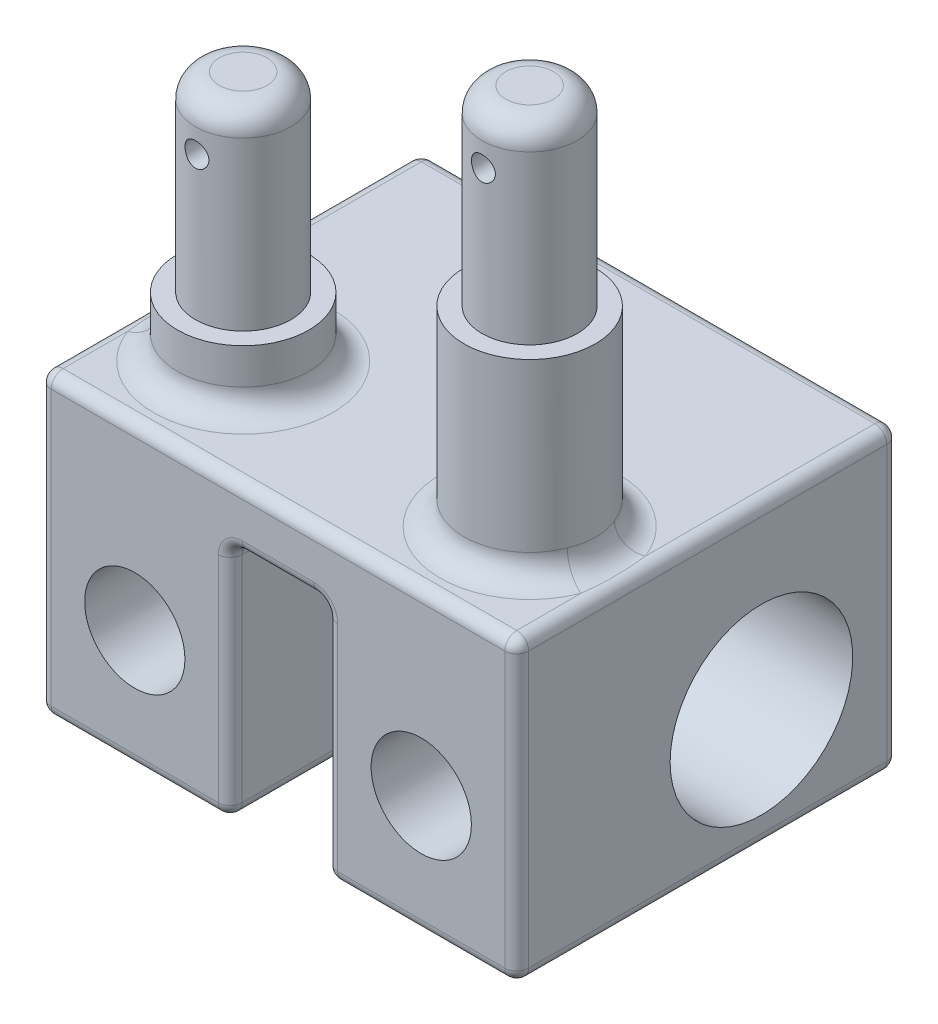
ISO-10303-21;
HEADER;
FILE_DESCRIPTION(('STEP AP214'),'2;1');
FILE_NAME('part.step','',(''),(''),'','','');
FILE_SCHEMA(('AUTOMOTIVE_DESIGN { 1 0 10303 214 1 1 1 1 }'));
ENDSEC;
DATA;
#1=APPLICATION_CONTEXT('core data for automotive mechanical design processes');
#2=APPLICATION_PROTOCOL_DEFINITION('international standard','automotive_design',2000,#1);
#3=PRODUCT_CONTEXT('',#1,'mechanical');
#4=PRODUCT('Part','Part','',(#3));
#5=PRODUCT_RELATED_PRODUCT_CATEGORY('part','',(#4));
#6=PRODUCT_DEFINITION_FORMATION('','',#4);
#7=PRODUCT_DEFINITION_CONTEXT('part definition',#1,'design');
#8=PRODUCT_DEFINITION('design','',#6,#7);
#9=PRODUCT_DEFINITION_SHAPE('','',#8);
#10=(LENGTH_UNIT() NAMED_UNIT(*) SI_UNIT(.MILLI.,.METRE.));
#11=(NAMED_UNIT(*) PLANE_ANGLE_UNIT() SI_UNIT($,.RADIAN.));
#12=(NAMED_UNIT(*) SI_UNIT($,.STERADIAN.) SOLID_ANGLE_UNIT());
#13=UNCERTAINTY_MEASURE_WITH_UNIT(LENGTH_MEASURE(1.E-05),#10,'distance_accuracy_value','');
#14=(GEOMETRIC_REPRESENTATION_CONTEXT(3) GLOBAL_UNCERTAINTY_ASSIGNED_CONTEXT((#13)) GLOBAL_UNIT_ASSIGNED_CONTEXT((#10,
#11,#12)) REPRESENTATION_CONTEXT('',''));
#15=CARTESIAN_POINT('',(0.,0.,0.));
#16=DIRECTION('',(0.,0.,1.));
#17=DIRECTION('',(1.,0.,0.));
#18=AXIS2_PLACEMENT_3D('',#15,#16,#17);
#19=CARTESIAN_POINT('',(-24.3662373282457,-20.,-27.492225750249));
#20=DIRECTION('',(0.,-1.,0.));
#21=DIRECTION('',(0.,0.,-1.));
#22=AXIS2_PLACEMENT_3D('',#19,#20,#21);
#23=PLANE('',#22);
#24=CARTESIAN_POINT('',(-47.3662373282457,-20.,-7.49222575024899));
#25=DIRECTION('',(0.,-1.,0.));
#26=DIRECTION('',(0.,0.,-1.));
#27=AXIS2_PLACEMENT_3D('',#24,#25,#26);
#28=CIRCLE('',#27,2.);
#29=CARTESIAN_POINT('',(-49.3662373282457,-20.,-7.49222575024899));
#30=VERTEX_POINT('',#29);
#31=CARTESIAN_POINT('',(-47.3662373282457,-20.,-9.49222575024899));
#32=VERTEX_POINT('',#31);
#33=EDGE_CURVE('E313',#30,#32,#28,.T.);
#34=ORIENTED_EDGE('',*,*,#33,.F.);
#35=DIRECTION('',(0.,0.,-1.));
#36=VECTOR('',#35,1.);
#37=CARTESIAN_POINT('',(-49.3662373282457,-20.,2.50777424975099));
#38=LINE('',#37,#36);
#39=CARTESIAN_POINT('',(-49.3662373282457,-20.,1.50777424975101));
#40=VERTEX_POINT('',#39);
#41=EDGE_CURVE('E633',#30,#40,#38,.F.);
#42=ORIENTED_EDGE('',*,*,#41,.T.);
#43=DIRECTION('',(1.,0.,0.));
#44=VECTOR('',#43,1.);
#45=CARTESIAN_POINT('',(-64.3662373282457,-20.,1.50777424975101));
#46=LINE('',#45,#44);
#47=CARTESIAN_POINT('',(-63.3662373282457,-20.,1.50777424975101));
#48=VERTEX_POINT('',#47);
#49=EDGE_CURVE('E625',#40,#48,#46,.F.);
#50=ORIENTED_EDGE('',*,*,#49,.T.);
#51=DIRECTION('',(0.,0.,1.));
#52=VECTOR('',#51,1.);
#53=CARTESIAN_POINT('',(-63.3662373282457,-20.,-29.492225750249));
#54=LINE('',#53,#52);
#55=CARTESIAN_POINT('',(-63.3662373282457,-20.,-28.492225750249));
#56=VERTEX_POINT('',#55);
#57=EDGE_CURVE('E616',#48,#56,#54,.F.);
#58=ORIENTED_EDGE('',*,*,#57,.T.);
#59=DIRECTION('',(-1.,0.,0.));
#60=VECTOR('',#59,1.);
#61=CARTESIAN_POINT('',(-24.3662373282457,-20.,-28.492225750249));
#62=LINE('',#61,#60);
#63=CARTESIAN_POINT('',(-25.3662373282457,-20.,-28.492225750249));
#64=VERTEX_POINT('',#63);
#65=EDGE_CURVE('E618',#56,#64,#62,.F.);
#66=ORIENTED_EDGE('',*,*,#65,.T.);
#67=DIRECTION('',(0.,0.,1.));
#68=VECTOR('',#67,1.);
#69=CARTESIAN_POINT('',(-25.3662373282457,-20.,-27.492225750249));
#70=LINE('',#69,#68);
#71=CARTESIAN_POINT('',(-25.3662373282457,-20.,1.50777424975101));
#72=VERTEX_POINT('',#71);
#73=EDGE_CURVE('E620',#64,#72,#70,.T.);
#74=ORIENTED_EDGE('',*,*,#73,.T.);
#75=DIRECTION('',(1.,0.,0.));
#76=VECTOR('',#75,1.);
#77=CARTESIAN_POINT('',(-40.3662373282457,-20.,1.50777424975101));
#78=LINE('',#77,#76);
#79=CARTESIAN_POINT('',(-39.3662373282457,-20.,1.50777424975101));
#80=VERTEX_POINT('',#79);
#81=EDGE_CURVE('E267',#72,#80,#78,.F.);
#82=ORIENTED_EDGE('',*,*,#81,.T.);
#83=DIRECTION('',(0.,0.,-1.));
#84=VECTOR('',#83,1.);
#85=CARTESIAN_POINT('',(-39.3662373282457,-20.,-8.49222575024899));
#86=LINE('',#85,#84);
#87=CARTESIAN_POINT('',(-39.3662373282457,-20.,-7.49222575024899));
#88=VERTEX_POINT('',#87);
#89=EDGE_CURVE('E623',#80,#88,#86,.T.);
#90=ORIENTED_EDGE('',*,*,#89,.T.);
#91=CARTESIAN_POINT('',(-41.3662373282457,-20.,-7.49222575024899));
#92=DIRECTION('',(0.,-1.,0.));
#93=DIRECTION('',(0.,0.,-1.));
#94=AXIS2_PLACEMENT_3D('',#91,#92,#93);
#95=CIRCLE('',#94,2.);
#96=CARTESIAN_POINT('',(-41.3662373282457,-20.,-9.49222575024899));
#97=VERTEX_POINT('',#96);
#98=EDGE_CURVE('E628',#97,#88,#95,.T.);
#99=ORIENTED_EDGE('',*,*,#98,.F.);
#100=DIRECTION('',(-1.,0.,0.));
#101=VECTOR('',#100,1.);
#102=CARTESIAN_POINT('',(-24.3662373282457,-20.,-9.492225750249));
#103=LINE('',#102,#101);
#104=EDGE_CURVE('E631',#97,#32,#103,.T.);
#105=ORIENTED_EDGE('',*,*,#104,.T.);
#106=EDGE_LOOP('',(#34,#42,#50,#58,#66,#74,#82,#90,#99,#105));
#107=FACE_BOUND('',#106,.T.);
#108=ADVANCED_FACE('F35',(#107),#23,.T.);
#109=CARTESIAN_POINT('',(0.,0.,0.));
#110=DIRECTION('',(0.,1.,0.));
#111=DIRECTION('',(0.,0.,1.));
#112=AXIS2_PLACEMENT_3D('',#109,#110,#111);
#113=PLANE('',#112);
#114=DIRECTION('',(1.,0.,0.));
#115=VECTOR('',#114,1.);
#116=CARTESIAN_POINT('',(0.,0.,1.50777424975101));
#117=LINE('',#116,#115);
#118=CARTESIAN_POINT('',(-41.3662373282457,0.,1.50777424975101));
#119=VERTEX_POINT('',#118);
#120=CARTESIAN_POINT('',(-47.3662373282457,0.,1.50777424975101));
#121=VERTEX_POINT('',#120);
#122=EDGE_CURVE('E602',#119,#121,#117,.F.);
#123=ORIENTED_EDGE('',*,*,#122,.T.);
#124=DIRECTION('',(0.,0.,-1.));
#125=VECTOR('',#124,1.);
#126=CARTESIAN_POINT('',(-47.3662373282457,0.,-8.492225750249));
#127=LINE('',#126,#125);
#128=CARTESIAN_POINT('',(-47.3662373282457,0.,-7.49222575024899));
#129=VERTEX_POINT('',#128);
#130=EDGE_CURVE('E604',#121,#129,#127,.T.);
#131=ORIENTED_EDGE('',*,*,#130,.T.);
#132=DIRECTION('',(-1.,0.,0.));
#133=VECTOR('',#132,1.);
#134=CARTESIAN_POINT('',(0.,0.,-7.49222575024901));
#135=LINE('',#134,#133);
#136=CARTESIAN_POINT('',(-41.3662373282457,0.,-7.492225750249));
#137=VERTEX_POINT('',#136);
#138=EDGE_CURVE('E598',#129,#137,#135,.F.);
#139=ORIENTED_EDGE('',*,*,#138,.T.);
#140=DIRECTION('',(0.,0.,-1.));
#141=VECTOR('',#140,1.);
#142=CARTESIAN_POINT('',(-41.3662373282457,0.,2.50777424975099));
#143=LINE('',#142,#141);
#144=EDGE_CURVE('E600',#137,#119,#143,.F.);
#145=ORIENTED_EDGE('',*,*,#144,.T.);
#146=EDGE_LOOP('',(#123,#131,#139,#145));
#147=FACE_BOUND('',#146,.T.);
#148=ADVANCED_FACE('F410',(#147),#113,.F.);
#149=CARTESIAN_POINT('',(-64.3662373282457,5.,-27.492225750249));
#150=DIRECTION('',(1.,0.,0.));
#151=DIRECTION('',(0.,0.,-1.));
#152=AXIS2_PLACEMENT_3D('',#149,#150,#151);
#153=PLANE('',#152);
#154=DIRECTION('',(0.,-1.,0.));
#155=VECTOR('',#154,1.);
#156=CARTESIAN_POINT('',(-64.3662373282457,5.,1.50777424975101));
#157=LINE('',#156,#155);
#158=CARTESIAN_POINT('',(-64.3662373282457,-19.,1.50777424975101));
#159=VERTEX_POINT('',#158);
#160=CARTESIAN_POINT('',(-64.3662373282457,4.,1.50777424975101));
#161=VERTEX_POINT('',#160);
#162=EDGE_CURVE('E580',#159,#161,#157,.F.);
#163=ORIENTED_EDGE('',*,*,#162,.T.);
#164=DIRECTION('',(0.,0.,1.));
#165=VECTOR('',#164,1.);
#166=CARTESIAN_POINT('',(-64.3662373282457,4.,-29.492225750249));
#167=LINE('',#166,#165);
#168=CARTESIAN_POINT('',(-64.3662373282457,4.,-28.492225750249));
#169=VERTEX_POINT('',#168);
#170=EDGE_CURVE('E586',#161,#169,#167,.F.);
#171=ORIENTED_EDGE('',*,*,#170,.T.);
#172=DIRECTION('',(0.,1.,0.));
#173=VECTOR('',#172,1.);
#174=CARTESIAN_POINT('',(-64.3662373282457,-20.,-28.492225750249));
#175=LINE('',#174,#173);
#176=CARTESIAN_POINT('',(-64.3662373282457,-19.,-28.492225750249));
#177=VERTEX_POINT('',#176);
#178=EDGE_CURVE('E584',#169,#177,#175,.F.);
#179=ORIENTED_EDGE('',*,*,#178,.T.);
#180=DIRECTION('',(0.,0.,1.));
#181=VECTOR('',#180,1.);
#182=CARTESIAN_POINT('',(-64.3662373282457,-19.,2.50777424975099));
#183=LINE('',#182,#181);
#184=EDGE_CURVE('E582',#177,#159,#183,.T.);
#185=ORIENTED_EDGE('',*,*,#184,.T.);
#186=EDGE_LOOP('',(#163,#171,#179,#185));
#187=FACE_BOUND('',#186,.T.);
#188=CARTESIAN_POINT('',(-64.3662373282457,-10.,-17.992225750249));
#189=DIRECTION('',(-1.,0.,0.));
#190=DIRECTION('',(0.,0.,1.));
#191=AXIS2_PLACEMENT_3D('',#188,#189,#190);
#192=CIRCLE('',#191,7.65);
#193=CARTESIAN_POINT('',(-64.3662373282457,-10.,-10.342225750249));
#194=VERTEX_POINT('',#193);
#195=EDGE_CURVE('E869',#194,#194,#192,.T.);
#196=ORIENTED_EDGE('',*,*,#195,.F.);
#197=EDGE_LOOP('',(#196));
#198=FACE_BOUND('',#197,.T.);
#199=ADVANCED_FACE('F416',(#187,#198),#153,.F.);
#200=CARTESIAN_POINT('',(-64.3662373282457,5.,2.50777424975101));
#201=DIRECTION('',(0.,0.,-1.));
#202=DIRECTION('',(-1.,0.,0.));
#203=AXIS2_PLACEMENT_3D('',#200,#201,#202);
#204=PLANE('',#203);
#205=DIRECTION('',(1.,0.,0.));
#206=VECTOR('',#205,1.);
#207=CARTESIAN_POINT('',(-48.3662373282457,-19.,2.50777424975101));
#208=LINE('',#207,#206);
#209=CARTESIAN_POINT('',(-63.3662373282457,-19.,2.50777424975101));
#210=VERTEX_POINT('',#209);
#211=CARTESIAN_POINT('',(-49.3662373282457,-19.,2.50777424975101));
#212=VERTEX_POINT('',#211);
#213=EDGE_CURVE('E776',#210,#212,#208,.T.);
#214=ORIENTED_EDGE('',*,*,#213,.T.);
#215=DIRECTION('',(0.,1.,0.));
#216=VECTOR('',#215,1.);
#217=CARTESIAN_POINT('',(-49.3662373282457,5.,2.50777424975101));
#218=LINE('',#217,#216);
#219=CARTESIAN_POINT('',(-49.3662373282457,-1.,2.50777424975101));
#220=VERTEX_POINT('',#219);
#221=EDGE_CURVE('E765',#212,#220,#218,.T.);
#222=ORIENTED_EDGE('',*,*,#221,.T.);
#223=CARTESIAN_POINT('',(-47.3662373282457,-1.,2.50777424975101));
#224=DIRECTION('',(0.,0.,-1.));
#225=DIRECTION('',(-1.,0.,0.));
#226=AXIS2_PLACEMENT_3D('',#223,#224,#225);
#227=CIRCLE('',#226,2.);
#228=CARTESIAN_POINT('',(-47.3662373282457,1.,2.50777424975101));
#229=VERTEX_POINT('',#228);
#230=EDGE_CURVE('E768',#229,#220,#227,.F.);
#231=ORIENTED_EDGE('',*,*,#230,.F.);
#232=DIRECTION('',(1.,0.,0.));
#233=VECTOR('',#232,1.);
#234=CARTESIAN_POINT('',(-64.3662373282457,1.,2.50777424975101));
#235=LINE('',#234,#233);
#236=CARTESIAN_POINT('',(-41.3662373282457,1.,2.50777424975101));
#237=VERTEX_POINT('',#236);
#238=EDGE_CURVE('E771',#229,#237,#235,.T.);
#239=ORIENTED_EDGE('',*,*,#238,.T.);
#240=CARTESIAN_POINT('',(-41.3662373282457,-1.,2.50777424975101));
#241=DIRECTION('',(0.,0.,-1.));
#242=DIRECTION('',(-1.,0.,0.));
#243=AXIS2_PLACEMENT_3D('',#240,#241,#242);
#244=CIRCLE('',#243,2.);
#245=CARTESIAN_POINT('',(-39.3662373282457,-1.,2.50777424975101));
#246=VERTEX_POINT('',#245);
#247=EDGE_CURVE('E773',#246,#237,#244,.F.);
#248=ORIENTED_EDGE('',*,*,#247,.F.);
#249=DIRECTION('',(0.,-1.,0.));
#250=VECTOR('',#249,1.);
#251=CARTESIAN_POINT('',(-39.3662373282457,4.99999999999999,2.50777424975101));
#252=LINE('',#251,#250);
#253=CARTESIAN_POINT('',(-39.3662373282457,-19.,2.50777424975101));
#254=VERTEX_POINT('',#253);
#255=EDGE_CURVE('E240',#246,#254,#252,.T.);
#256=ORIENTED_EDGE('',*,*,#255,.T.);
#257=DIRECTION('',(1.,0.,0.));
#258=VECTOR('',#257,1.);
#259=CARTESIAN_POINT('',(-24.3662373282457,-19.,2.50777424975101));
#260=LINE('',#259,#258);
#261=CARTESIAN_POINT('',(-25.3662373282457,-19.,2.50777424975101));
#262=VERTEX_POINT('',#261);
#263=EDGE_CURVE('E233',#254,#262,#260,.T.);
#264=ORIENTED_EDGE('',*,*,#263,.T.);
#265=DIRECTION('',(0.,-1.,0.));
#266=VECTOR('',#265,1.);
#267=CARTESIAN_POINT('',(-25.3662373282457,5.,2.50777424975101));
#268=LINE('',#267,#266);
#269=CARTESIAN_POINT('',(-25.3662373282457,4.,2.50777424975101));
#270=VERTEX_POINT('',#269);
#271=EDGE_CURVE('E237',#262,#270,#268,.F.);
#272=ORIENTED_EDGE('',*,*,#271,.T.);
#273=DIRECTION('',(1.,0.,0.));
#274=VECTOR('',#273,1.);
#275=CARTESIAN_POINT('',(-64.3662373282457,4.,2.50777424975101));
#276=LINE('',#275,#274);
#277=CARTESIAN_POINT('',(-63.3662373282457,4.,2.50777424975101));
#278=VERTEX_POINT('',#277);
#279=EDGE_CURVE('E245',#270,#278,#276,.F.);
#280=ORIENTED_EDGE('',*,*,#279,.T.);
#281=DIRECTION('',(0.,-1.,0.));
#282=VECTOR('',#281,1.);
#283=CARTESIAN_POINT('',(-63.3662373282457,5.,2.50777424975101));
#284=LINE('',#283,#282);
#285=EDGE_CURVE('E778',#278,#210,#284,.T.);
#286=ORIENTED_EDGE('',*,*,#285,.T.);
#287=EDGE_LOOP('',(#214,#222,#231,#239,#248,#256,#264,#272,#280,#286));
#288=FACE_BOUND('',#287,.T.);
#289=CARTESIAN_POINT('',(-56.3662373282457,-10.,2.50777424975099));
#290=DIRECTION('',(0.,0.,1.));
#291=DIRECTION('',(1.,0.,0.));
#292=AXIS2_PLACEMENT_3D('',#289,#290,#291);
#293=CIRCLE('',#292,4.2);
#294=CARTESIAN_POINT('',(-52.1662373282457,-10.,2.50777424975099));
#295=VERTEX_POINT('',#294);
#296=EDGE_CURVE('E860',#295,#295,#293,.T.);
#297=ORIENTED_EDGE('',*,*,#296,.F.);
#298=EDGE_LOOP('',(#297));
#299=FACE_BOUND('',#298,.T.);
#300=CARTESIAN_POINT('',(-32.3662373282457,-10.,2.50777424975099));
#301=DIRECTION('',(0.,0.,1.));
#302=DIRECTION('',(1.,0.,0.));
#303=AXIS2_PLACEMENT_3D('',#300,#301,#302);
#304=CIRCLE('',#303,4.2);
#305=CARTESIAN_POINT('',(-28.1662373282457,-10.,2.50777424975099));
#306=VERTEX_POINT('',#305);
#307=EDGE_CURVE('E856',#306,#306,#304,.T.);
#308=ORIENTED_EDGE('',*,*,#307,.F.);
#309=EDGE_LOOP('',(#308));
#310=FACE_BOUND('',#309,.T.);
#311=ADVANCED_FACE('F235',(#288,#299,#310),#204,.F.);
#312=CARTESIAN_POINT('',(-24.3662373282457,5.,-27.492225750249));
#313=DIRECTION('',(1.,0.,0.));
#314=DIRECTION('',(0.,0.,-1.));
#315=AXIS2_PLACEMENT_3D('',#312,#313,#314);
#316=PLANE('',#315);
#317=DIRECTION('',(0.,-1.,0.));
#318=VECTOR('',#317,1.);
#319=CARTESIAN_POINT('',(-24.3662373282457,5.,-28.492225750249));
#320=LINE('',#319,#318);
#321=CARTESIAN_POINT('',(-24.3662373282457,-19.,-28.492225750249));
#322=VERTEX_POINT('',#321);
#323=CARTESIAN_POINT('',(-24.3662373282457,4.,-28.492225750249));
#324=VERTEX_POINT('',#323);
#325=EDGE_CURVE('E566',#322,#324,#320,.F.);
#326=ORIENTED_EDGE('',*,*,#325,.T.);
#327=DIRECTION('',(0.,0.,1.));
#328=VECTOR('',#327,1.);
#329=CARTESIAN_POINT('',(-24.3662373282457,4.,-27.492225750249));
#330=LINE('',#329,#328);
#331=CARTESIAN_POINT('',(-24.3662373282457,4.,1.50777424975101));
#332=VERTEX_POINT('',#331);
#333=EDGE_CURVE('E556',#324,#332,#330,.T.);
#334=ORIENTED_EDGE('',*,*,#333,.T.);
#335=DIRECTION('',(0.,-1.,0.));
#336=VECTOR('',#335,1.);
#337=CARTESIAN_POINT('',(-24.3662373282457,-20.,1.50777424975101));
#338=LINE('',#337,#336);
#339=CARTESIAN_POINT('',(-24.3662373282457,-19.,1.50777424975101));
#340=VERTEX_POINT('',#339);
#341=EDGE_CURVE('E559',#332,#340,#338,.T.);
#342=ORIENTED_EDGE('',*,*,#341,.T.);
#343=DIRECTION('',(0.,0.,1.));
#344=VECTOR('',#343,1.);
#345=CARTESIAN_POINT('',(-24.3662373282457,-19.,-27.492225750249));
#346=LINE('',#345,#344);
#347=EDGE_CURVE('E561',#340,#322,#346,.F.);
#348=ORIENTED_EDGE('',*,*,#347,.T.);
#349=EDGE_LOOP('',(#326,#334,#342,#348));
#350=FACE_BOUND('',#349,.T.);
#351=CARTESIAN_POINT('',(-24.3662373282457,-10.,-17.992225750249));
#352=DIRECTION('',(-1.,0.,0.));
#353=DIRECTION('',(0.,0.,1.));
#354=AXIS2_PLACEMENT_3D('',#351,#352,#353);
#355=CIRCLE('',#354,7.65);
#356=CARTESIAN_POINT('',(-24.3662373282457,-10.,-10.342225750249));
#357=VERTEX_POINT('',#356);
#358=EDGE_CURVE('E870',#357,#357,#355,.T.);
#359=ORIENTED_EDGE('',*,*,#358,.T.);
#360=EDGE_LOOP('',(#359));
#361=FACE_BOUND('',#360,.T.);
#362=ADVANCED_FACE('F425',(#350,#361),#316,.T.);
#363=CARTESIAN_POINT('',(0.,5.,0.));
#364=DIRECTION('',(0.,1.,0.));
#365=DIRECTION('',(0.,0.,1.));
#366=AXIS2_PLACEMENT_3D('',#363,#364,#365);
#367=PLANE('',#366);
#368=DIRECTION('',(0.,0.,1.));
#369=VECTOR('',#368,1.);
#370=CARTESIAN_POINT('',(-25.3662373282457,5.,0.));
#371=LINE('',#370,#369);
#372=CARTESIAN_POINT('',(-25.3662373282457,5.,1.50777424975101));
#373=VERTEX_POINT('',#372);
#374=CARTESIAN_POINT('',(-25.3662373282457,5.,-3.88064209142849));
#375=VERTEX_POINT('',#374);
#376=EDGE_CURVE('E558',#373,#375,#371,.F.);
#377=ORIENTED_EDGE('',*,*,#376,.T.);
#378=CARTESIAN_POINT('',(-32.3662373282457,5.,-6.5732244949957));
#379=DIRECTION('',(0.,1.,0.));
#380=DIRECTION('',(0.,0.,1.));
#381=AXIS2_PLACEMENT_3D('',#378,#379,#380);
#382=CIRCLE('',#381,7.5);
#383=CARTESIAN_POINT('',(-25.3662373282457,5.,-9.26580689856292));
#384=VERTEX_POINT('',#383);
#385=EDGE_CURVE('E50',#375,#384,#382,.F.);
#386=ORIENTED_EDGE('',*,*,#385,.T.);
#387=CARTESIAN_POINT('',(-25.3662373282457,5.,-28.492225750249));
#388=VERTEX_POINT('',#387);
#389=EDGE_CURVE('E578',#384,#388,#371,.F.);
#390=ORIENTED_EDGE('',*,*,#389,.T.);
#391=DIRECTION('',(1.,0.,0.));
#392=VECTOR('',#391,1.);
#393=CARTESIAN_POINT('',(0.,5.,-28.492225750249));
#394=LINE('',#393,#392);
#395=CARTESIAN_POINT('',(-63.3662373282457,5.,-28.492225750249));
#396=VERTEX_POINT('',#395);
#397=EDGE_CURVE('E567',#388,#396,#394,.F.);
#398=ORIENTED_EDGE('',*,*,#397,.T.);
#399=DIRECTION('',(0.,0.,1.));
#400=VECTOR('',#399,1.);
#401=CARTESIAN_POINT('',(-63.3662373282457,5.,2.50777424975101));
#402=LINE('',#401,#400);
#403=CARTESIAN_POINT('',(-63.3662373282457,5.,-9.26580689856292));
#404=VERTEX_POINT('',#403);
#405=EDGE_CURVE('E574',#396,#404,#402,.T.);
#406=ORIENTED_EDGE('',*,*,#405,.T.);
#407=CARTESIAN_POINT('',(-56.3662373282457,5.,-6.5732244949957));
#408=DIRECTION('',(0.,1.,0.));
#409=DIRECTION('',(0.,0.,1.));
#410=AXIS2_PLACEMENT_3D('',#407,#408,#409);
#411=CIRCLE('',#410,7.5);
#412=CARTESIAN_POINT('',(-63.3662373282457,5.,-3.88064209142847));
#413=VERTEX_POINT('',#412);
#414=EDGE_CURVE('E321',#404,#413,#411,.F.);
#415=ORIENTED_EDGE('',*,*,#414,.T.);
#416=CARTESIAN_POINT('',(-63.3662373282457,5.,1.50777424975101));
#417=VERTEX_POINT('',#416);
#418=EDGE_CURVE('E569',#413,#417,#402,.T.);
#419=ORIENTED_EDGE('',*,*,#418,.T.);
#420=DIRECTION('',(1.,0.,0.));
#421=VECTOR('',#420,1.);
#422=CARTESIAN_POINT('',(-24.3662373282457,5.,1.50777424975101));
#423=LINE('',#422,#421);
#424=EDGE_CURVE('E547',#417,#373,#423,.T.);
#425=ORIENTED_EDGE('',*,*,#424,.T.);
#426=EDGE_LOOP('',(#377,#386,#390,#398,#406,#415,#419,#425));
#427=FACE_BOUND('',#426,.T.);
#428=ADVANCED_FACE('F423',(#427),#367,.T.);
#429=CARTESIAN_POINT('',(-24.3662373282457,0.,-8.492225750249));
#430=DIRECTION('',(0.,0.,1.));
#431=DIRECTION('',(1.,0.,0.));
#432=AXIS2_PLACEMENT_3D('',#429,#430,#431);
#433=PLANE('',#432);
#434=DIRECTION('',(-1.,0.,0.));
#435=VECTOR('',#434,1.);
#436=CARTESIAN_POINT('',(-24.3662373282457,-1.,-8.492225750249));
#437=LINE('',#436,#435);
#438=CARTESIAN_POINT('',(-41.3662373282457,-1.,-8.49222575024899));
#439=VERTEX_POINT('',#438);
#440=CARTESIAN_POINT('',(-47.3662373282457,-1.,-8.49222575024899));
#441=VERTEX_POINT('',#440);
#442=EDGE_CURVE('E611',#439,#441,#437,.T.);
#443=ORIENTED_EDGE('',*,*,#442,.T.);
#444=DIRECTION('',(0.,1.,0.));
#445=VECTOR('',#444,1.);
#446=CARTESIAN_POINT('',(-47.3662373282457,0.,-8.49222575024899));
#447=LINE('',#446,#445);
#448=CARTESIAN_POINT('',(-47.3662373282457,-19.,-8.49222575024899));
#449=VERTEX_POINT('',#448);
#450=EDGE_CURVE('E613',#441,#449,#447,.F.);
#451=ORIENTED_EDGE('',*,*,#450,.T.);
#452=DIRECTION('',(-1.,0.,0.));
#453=VECTOR('',#452,1.);
#454=CARTESIAN_POINT('',(-24.3662373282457,-19.,-8.49222575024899));
#455=LINE('',#454,#453);
#456=CARTESIAN_POINT('',(-41.3662373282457,-19.,-8.49222575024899));
#457=VERTEX_POINT('',#456);
#458=EDGE_CURVE('E607',#449,#457,#455,.F.);
#459=ORIENTED_EDGE('',*,*,#458,.T.);
#460=DIRECTION('',(0.,-1.,0.));
#461=VECTOR('',#460,1.);
#462=CARTESIAN_POINT('',(-41.3662373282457,0.,-8.49222575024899));
#463=LINE('',#462,#461);
#464=EDGE_CURVE('E609',#457,#439,#463,.F.);
#465=ORIENTED_EDGE('',*,*,#464,.T.);
#466=EDGE_LOOP('',(#443,#451,#459,#465));
#467=FACE_BOUND('',#466,.T.);
#468=ADVANCED_FACE('F421',(#467),#433,.T.);
#469=CARTESIAN_POINT('',(-24.3662373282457,-10.,-17.992225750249));
#470=DIRECTION('',(-1.,0.,0.));
#471=DIRECTION('',(0.,0.,1.));
#472=AXIS2_PLACEMENT_3D('',#469,#470,#471);
#473=CYLINDRICAL_SURFACE('',#472,7.65);
#474=ORIENTED_EDGE('',*,*,#358,.F.);
#475=EDGE_LOOP('',(#474));
#476=FACE_BOUND('',#475,.T.);
#477=ORIENTED_EDGE('',*,*,#195,.T.);
#478=EDGE_LOOP('',(#477));
#479=FACE_BOUND('',#478,.T.);
#480=ADVANCED_FACE('F1101',(#476,#479),#473,.F.);
#481=CARTESIAN_POINT('',(-48.3662373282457,0.,2.50777424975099));
#482=DIRECTION('',(-1.,0.,0.));
#483=DIRECTION('',(0.,0.,1.));
#484=AXIS2_PLACEMENT_3D('',#481,#482,#483);
#485=PLANE('',#484);
#486=DIRECTION('',(0.,0.,-1.));
#487=VECTOR('',#486,1.);
#488=CARTESIAN_POINT('',(-48.3662373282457,-1.,2.50777424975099));
#489=LINE('',#488,#487);
#490=CARTESIAN_POINT('',(-48.3662373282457,-1.,-7.49222575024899));
#491=VERTEX_POINT('',#490);
#492=CARTESIAN_POINT('',(-48.3662373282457,-1.,1.50777424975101));
#493=VERTEX_POINT('',#492);
#494=EDGE_CURVE('E759',#491,#493,#489,.F.);
#495=ORIENTED_EDGE('',*,*,#494,.T.);
#496=DIRECTION('',(0.,1.,0.));
#497=VECTOR('',#496,1.);
#498=CARTESIAN_POINT('',(-48.3662373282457,0.,1.50777424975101));
#499=LINE('',#498,#497);
#500=CARTESIAN_POINT('',(-48.3662373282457,-19.,1.50777424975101));
#501=VERTEX_POINT('',#500);
#502=EDGE_CURVE('E734',#493,#501,#499,.F.);
#503=ORIENTED_EDGE('',*,*,#502,.T.);
#504=DIRECTION('',(0.,0.,-1.));
#505=VECTOR('',#504,1.);
#506=CARTESIAN_POINT('',(-48.3662373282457,-19.,-8.492225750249));
#507=LINE('',#506,#505);
#508=CARTESIAN_POINT('',(-48.3662373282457,-19.,-7.49222575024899));
#509=VERTEX_POINT('',#508);
#510=EDGE_CURVE('E763',#501,#509,#507,.T.);
#511=ORIENTED_EDGE('',*,*,#510,.T.);
#512=DIRECTION('',(0.,1.,0.));
#513=VECTOR('',#512,1.);
#514=CARTESIAN_POINT('',(-48.3662373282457,0.,-7.49222575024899));
#515=LINE('',#514,#513);
#516=EDGE_CURVE('E761',#509,#491,#515,.T.);
#517=ORIENTED_EDGE('',*,*,#516,.T.);
#518=EDGE_LOOP('',(#495,#503,#511,#517));
#519=FACE_BOUND('',#518,.T.);
#520=ADVANCED_FACE('F1109',(#519),#485,.F.);
#521=CARTESIAN_POINT('',(-56.3662373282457,-10.,2.50777424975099));
#522=DIRECTION('',(0.,0.,-1.));
#523=DIRECTION('',(-1.,0.,0.));
#524=AXIS2_PLACEMENT_3D('',#521,#522,#523);
#525=CYLINDRICAL_SURFACE('',#524,4.2);
#526=ORIENTED_EDGE('',*,*,#296,.T.);
#527=EDGE_LOOP('',(#526));
#528=FACE_BOUND('',#527,.T.);
#529=CARTESIAN_POINT('',(-56.3662373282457,-10.,-8.49222575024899));
#530=DIRECTION('',(0.,0.,1.));
#531=DIRECTION('',(1.,0.,0.));
#532=AXIS2_PLACEMENT_3D('',#529,#530,#531);
#533=CIRCLE('',#532,4.2);
#534=CARTESIAN_POINT('',(-52.1662373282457,-10.,-8.49222575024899));
#535=VERTEX_POINT('',#534);
#536=EDGE_CURVE('E873',#535,#535,#533,.F.);
#537=ORIENTED_EDGE('',*,*,#536,.T.);
#538=EDGE_LOOP('',(#537));
#539=FACE_BOUND('',#538,.T.);
#540=ADVANCED_FACE('F1116',(#528,#539),#525,.F.);
#541=ORIENTED_EDGE('',*,*,#536,.F.);
#542=EDGE_LOOP('',(#541));
#543=FACE_BOUND('',#542,.T.);
#544=ADVANCED_FACE('F1102',(#543),#433,.T.);
#545=CARTESIAN_POINT('',(-40.3662373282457,0.,2.50777424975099));
#546=DIRECTION('',(1.,0.,0.));
#547=DIRECTION('',(0.,1.,0.));
#548=AXIS2_PLACEMENT_3D('',#545,#546,#547);
#549=PLANE('',#548);
#550=DIRECTION('',(0.,0.,-1.));
#551=VECTOR('',#550,1.);
#552=CARTESIAN_POINT('',(-40.3662373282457,-19.,2.50777424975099));
#553=LINE('',#552,#551);
#554=CARTESIAN_POINT('',(-40.3662373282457,-19.,-7.49222575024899));
#555=VERTEX_POINT('',#554);
#556=CARTESIAN_POINT('',(-40.3662373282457,-19.,1.50777424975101));
#557=VERTEX_POINT('',#556);
#558=EDGE_CURVE('E729',#555,#557,#553,.F.);
#559=ORIENTED_EDGE('',*,*,#558,.T.);
#560=DIRECTION('',(0.,-1.,0.));
#561=VECTOR('',#560,1.);
#562=CARTESIAN_POINT('',(-40.3662373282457,0.,1.50777424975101));
#563=LINE('',#562,#561);
#564=CARTESIAN_POINT('',(-40.3662373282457,-1.,1.50777424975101));
#565=VERTEX_POINT('',#564);
#566=EDGE_CURVE('E562',#557,#565,#563,.F.);
#567=ORIENTED_EDGE('',*,*,#566,.T.);
#568=DIRECTION('',(0.,0.,-1.));
#569=VECTOR('',#568,1.);
#570=CARTESIAN_POINT('',(-40.3662373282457,-1.,-8.492225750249));
#571=LINE('',#570,#569);
#572=CARTESIAN_POINT('',(-40.3662373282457,-1.,-7.492225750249));
#573=VERTEX_POINT('',#572);
#574=EDGE_CURVE('E754',#565,#573,#571,.T.);
#575=ORIENTED_EDGE('',*,*,#574,.T.);
#576=DIRECTION('',(0.,-1.,0.));
#577=VECTOR('',#576,1.);
#578=CARTESIAN_POINT('',(-40.3662373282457,0.,-7.492225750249));
#579=LINE('',#578,#577);
#580=EDGE_CURVE('E733',#573,#555,#579,.T.);
#581=ORIENTED_EDGE('',*,*,#580,.T.);
#582=EDGE_LOOP('',(#559,#567,#575,#581));
#583=FACE_BOUND('',#582,.T.);
#584=ADVANCED_FACE('F1130',(#583),#549,.F.);
#585=CARTESIAN_POINT('',(-32.3662373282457,-10.,2.50777424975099));
#586=DIRECTION('',(0.,0.,-1.));
#587=DIRECTION('',(-1.,0.,0.));
#588=AXIS2_PLACEMENT_3D('',#585,#586,#587);
#589=CYLINDRICAL_SURFACE('',#588,4.2);
#590=ORIENTED_EDGE('',*,*,#307,.T.);
#591=EDGE_LOOP('',(#590));
#592=FACE_BOUND('',#591,.T.);
#593=CARTESIAN_POINT('',(-32.3662373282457,-10.,-8.49222575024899));
#594=DIRECTION('',(0.,0.,1.));
#595=DIRECTION('',(1.,0.,0.));
#596=AXIS2_PLACEMENT_3D('',#593,#594,#595);
#597=CIRCLE('',#596,4.2);
#598=CARTESIAN_POINT('',(-28.1662373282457,-10.,-8.492225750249));
#599=VERTEX_POINT('',#598);
#600=EDGE_CURVE('E256',#599,#599,#597,.F.);
#601=ORIENTED_EDGE('',*,*,#600,.T.);
#602=EDGE_LOOP('',(#601));
#603=FACE_BOUND('',#602,.T.);
#604=ADVANCED_FACE('F1137',(#592,#603),#589,.F.);
#605=ORIENTED_EDGE('',*,*,#600,.F.);
#606=EDGE_LOOP('',(#605));
#607=FACE_BOUND('',#606,.T.);
#608=ADVANCED_FACE('F851',(#607),#433,.T.);
#609=CARTESIAN_POINT('',(-56.3662373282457,10.,-6.5732244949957));
#610=DIRECTION('',(0.,-1.,0.));
#611=DIRECTION('',(0.,0.,-1.));
#612=AXIS2_PLACEMENT_3D('',#609,#610,#611);
#613=CYLINDRICAL_SURFACE('',#612,5.5);
#614=CARTESIAN_POINT('',(-56.3662373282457,7.,-6.5732244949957));
#615=DIRECTION('',(0.,1.,0.));
#616=DIRECTION('',(0.,0.,1.));
#617=AXIS2_PLACEMENT_3D('',#614,#615,#616);
#618=CIRCLE('',#617,5.5);
#619=CARTESIAN_POINT('',(-61.499570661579,7.,-4.59866406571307));
#620=VERTEX_POINT('',#619);
#621=CARTESIAN_POINT('',(-61.499570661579,7.,-8.54778492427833));
#622=VERTEX_POINT('',#621);
#623=EDGE_CURVE('E310',#620,#622,#618,.T.);
#624=ORIENTED_EDGE('',*,*,#623,.T.);
#625=CARTESIAN_POINT('',(-60.7350416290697,6.81302527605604,-9.91441425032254));
#626=CARTESIAN_POINT('',(-61.0893352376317,4.22262133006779,-9.451154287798));
#627=CARTESIAN_POINT('',(-63.0187241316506,4.93767509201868,-11.1293923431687));
#628=CARTESIAN_POINT('',(-60.8036751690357,6.84764746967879,-9.82473101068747));
#629=CARTESIAN_POINT('',(-61.0969069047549,4.29768117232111,-9.42196899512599));
#630=CARTESIAN_POINT('',(-63.0499211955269,4.94921582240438,-11.0070970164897));
#631=CARTESIAN_POINT('',(-60.8700440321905,6.87594726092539,-9.73216806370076));
#632=CARTESIAN_POINT('',(-61.1135716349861,4.37119527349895,-9.38294405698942));
#633=CARTESIAN_POINT('',(-63.0800888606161,4.95864908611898,-10.8808748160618));
#634=CARTESIAN_POINT('',(-60.9974177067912,6.92220204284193,-9.54225051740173));
#635=CARTESIAN_POINT('',(-61.1592826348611,4.50979291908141,-9.28751971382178));
#636=CARTESIAN_POINT('',(-63.1379859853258,4.97406734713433,-10.6218963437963));
#637=CARTESIAN_POINT('',(-61.0584294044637,6.94017048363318,-9.44490232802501));
#638=CARTESIAN_POINT('',(-61.1880052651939,4.57515124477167,-9.23156442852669));
#639=CARTESIAN_POINT('',(-63.1657185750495,4.98005682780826,-10.4891488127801));
#640=CARTESIAN_POINT('',(-61.1739224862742,6.96801668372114,-9.24702525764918));
#641=CARTESIAN_POINT('',(-61.2521125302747,4.69494344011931,-9.10465204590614));
#642=CARTESIAN_POINT('',(-63.2182154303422,4.98933889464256,-10.2193164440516));
#643=CARTESIAN_POINT('',(-61.2284570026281,6.97796480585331,-9.14653225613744));
#644=CARTESIAN_POINT('',(-61.2873119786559,4.74978781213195,-9.03412024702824));
#645=CARTESIAN_POINT('',(-63.2430038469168,4.99265493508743,-10.0822805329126));
#646=CARTESIAN_POINT('',(-61.3312291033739,6.99203443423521,-8.94217483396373));
#647=CARTESIAN_POINT('',(-61.3601250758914,4.84920644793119,-8.88020238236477));
#648=CARTESIAN_POINT('',(-63.2897184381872,4.99734481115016,-9.80361132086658));
#649=CARTESIAN_POINT('',(-61.3794670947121,6.99615631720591,-8.83831063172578));
#650=CARTESIAN_POINT('',(-61.3977568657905,4.89409702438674,-8.79694453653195));
#651=CARTESIAN_POINT('',(-63.3116447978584,4.99871877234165,-9.66197831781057));
#652=CARTESIAN_POINT('',(-61.45058683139,6.99946744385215,-8.67175708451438));
#653=CARTESIAN_POINT('',(-61.4568203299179,4.95779952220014,-8.65631697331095));
#654=CARTESIAN_POINT('',(-63.3439719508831,4.99982248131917,-9.43485984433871));
#655=CARTESIAN_POINT('',(-61.4756429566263,6.99999796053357,-8.60999261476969));
#656=CARTESIAN_POINT('',(-61.478342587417,4.9795975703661,-8.60298852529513));
#657=CARTESIAN_POINT('',(-63.3553610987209,4.99999932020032,-9.35063556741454));
#658=CARTESIAN_POINT('',(-61.5545380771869,7.00000468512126,-8.4048796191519));
#659=CARTESIAN_POINT('',(-61.5475297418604,5.04609376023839,-8.42306734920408));
#660=CARTESIAN_POINT('',(-63.3912225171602,5.00000156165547,-9.07093602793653));
#661=CARTESIAN_POINT('',(-61.6035505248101,6.99722045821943,-8.25963532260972));
#662=CARTESIAN_POINT('',(-61.5941524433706,5.08521736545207,-8.28833621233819));
#663=CARTESIAN_POINT('',(-63.4135009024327,4.99907348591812,-8.8728756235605));
#664=CARTESIAN_POINT('',(-61.689301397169,6.9893969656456,-7.96551989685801));
#665=CARTESIAN_POINT('',(-61.6782829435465,5.15009858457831,-8.00678695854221));
#666=CARTESIAN_POINT('',(-63.4524785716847,4.99646565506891,-8.47180913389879));
#667=CARTESIAN_POINT('',(-61.7260305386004,6.98435600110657,-7.81664611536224));
#668=CARTESIAN_POINT('',(-61.7161474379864,5.1762392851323,-7.85950106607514));
#669=CARTESIAN_POINT('',(-63.4691736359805,4.9947853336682,-8.26879943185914));
#670=CARTESIAN_POINT('',(-61.7870158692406,6.974579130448,-7.51595767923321));
#671=CARTESIAN_POINT('',(-61.7799340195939,5.21783453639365,-7.5566869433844));
#672=CARTESIAN_POINT('',(-63.4968942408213,4.99152637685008,-7.85876974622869));
#673=CARTESIAN_POINT('',(-61.8112402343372,6.96984402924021,-7.36413653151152));
#674=CARTESIAN_POINT('',(-61.806140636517,5.23350404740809,-7.40046703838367));
#675=CARTESIAN_POINT('',(-63.5079053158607,4.98994800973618,-7.6517409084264));
#676=CARTESIAN_POINT('',(-61.8468939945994,6.96248014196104,-7.05901246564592));
#677=CARTESIAN_POINT('',(-61.8448248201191,5.25599270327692,-7.08397633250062));
#678=CARTESIAN_POINT('',(-63.5241115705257,4.98749338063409,-7.23566263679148));
#679=CARTESIAN_POINT('',(-61.858326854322,6.95985078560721,-6.90570996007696));
#680=CARTESIAN_POINT('',(-61.8575088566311,5.2629385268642,-6.92290668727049));
#681=CARTESIAN_POINT('',(-63.5293083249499,4.98661692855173,-7.02661376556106));
#682=CARTESIAN_POINT('',(-61.8683454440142,6.95756098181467,-6.59797660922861));
#683=CARTESIAN_POINT('',(-61.8685533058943,5.26900899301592,-6.59954000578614));
#684=CARTESIAN_POINT('',(-63.5338622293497,4.98585366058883,-6.60697737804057));
#685=CARTESIAN_POINT('',(-61.866872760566,6.95791403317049,-6.44354379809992));
#686=CARTESIAN_POINT('',(-61.8669084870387,5.26813088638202,-6.4363676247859));
#687=CARTESIAN_POINT('',(-63.5331928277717,4.985971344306,-6.3963871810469));
#688=CARTESIAN_POINT('',(-61.8509493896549,6.96150841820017,-6.1353310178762));
#689=CARTESIAN_POINT('',(-61.8493891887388,5.25843118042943,-6.11302718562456));
#690=CARTESIAN_POINT('',(-63.5259549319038,4.98716947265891,-5.97609702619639));
#691=CARTESIAN_POINT('',(-61.8364956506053,6.96475043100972,-5.98155121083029));
#692=CARTESIAN_POINT('',(-61.8334165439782,5.24955499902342,-5.95199384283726));
#693=CARTESIAN_POINT('',(-63.5193850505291,4.98825014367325,-5.76639728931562));
#694=CARTESIAN_POINT('',(-61.7947660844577,6.97300894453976,-5.67612637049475));
#695=CARTESIAN_POINT('',(-61.7884347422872,5.2228327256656,-5.63685466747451));
#696=CARTESIAN_POINT('',(-63.5004170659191,4.99100298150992,-5.3499088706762));
#697=CARTESIAN_POINT('',(-61.7675188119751,6.97802148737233,-5.52447735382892));
#698=CARTESIAN_POINT('',(-61.7592198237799,5.20485639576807,-5.48194893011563));
#699=CARTESIAN_POINT('',(-63.4880319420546,4.99267382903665,-5.1431147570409));
#700=CARTESIAN_POINT('',(-61.7004124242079,6.9878269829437,-5.22406170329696));
#701=CARTESIAN_POINT('',(-61.6898791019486,5.1580346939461,-5.18235405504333));
#702=CARTESIAN_POINT('',(-63.4575290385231,4.9959423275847,-4.73345705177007));
#703=CARTESIAN_POINT('',(-61.6605610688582,6.99262006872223,-5.07529335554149));
#704=CARTESIAN_POINT('',(-61.6494243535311,5.12891937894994,-5.03702709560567));
#705=CARTESIAN_POINT('',(-63.4394147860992,4.99754002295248,-4.53059112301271));
#706=CARTESIAN_POINT('',(-61.5971348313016,6.99714147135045,-4.87289878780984));
#707=CARTESIAN_POINT('',(-61.5888537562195,5.07992582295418,-4.84752139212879));
#708=CARTESIAN_POINT('',(-63.4105846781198,4.99904715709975,-4.25459853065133));
#709=CARTESIAN_POINT('',(-61.5788335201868,6.99816625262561,-4.81759541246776));
#710=CARTESIAN_POINT('',(-61.5715468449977,5.06539633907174,-4.79613223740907));
#711=CARTESIAN_POINT('',(-63.4022659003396,4.99938875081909,-4.17918483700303));
#712=CARTESIAN_POINT('',(-61.5404992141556,6.99959480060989,-4.70764117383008));
#713=CARTESIAN_POINT('',(-61.5360984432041,5.0342737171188,-4.69558540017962));
#714=CARTESIAN_POINT('',(-63.3848412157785,4.99986493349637,-4.02924723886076));
#715=CARTESIAN_POINT('',(-61.5204677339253,6.99999910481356,-4.65298978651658));
#716=CARTESIAN_POINT('',(-61.517938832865,5.01765495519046,-4.64640989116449));
#717=CARTESIAN_POINT('',(-63.3757359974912,4.99999970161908,-3.95472261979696));
#718=CARTESIAN_POINT('',(-61.452567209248,7.00000201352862,-4.47647008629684));
#719=CARTESIAN_POINT('',(-61.4576543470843,4.95971125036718,-4.4897077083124));
#720=CARTESIAN_POINT('',(-63.344872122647,5.00000067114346,-3.71401393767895));
#721=CARTESIAN_POINT('',(-61.4011844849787,6.9979630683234,-4.35592374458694));
#722=CARTESIAN_POINT('',(-61.4145396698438,4.91391530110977,-4.3879123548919));
#723=CARTESIAN_POINT('',(-63.3215163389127,4.99932102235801,-3.54963256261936));
#724=CARTESIAN_POINT('',(-61.2900113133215,6.9873240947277,-4.11892239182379));
#725=CARTESIAN_POINT('',(-61.3295588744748,4.81001902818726,-4.19962521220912));
#726=CARTESIAN_POINT('',(-63.27098307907,4.99577469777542,-3.22644889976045));
#727=CARTESIAN_POINT('',(-61.230220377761,6.97872368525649,-4.00246761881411));
#728=CARTESIAN_POINT('',(-61.2876016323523,4.75147094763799,-4.11323641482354));
#729=CARTESIAN_POINT('',(-63.2438053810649,4.99290789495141,-3.06764693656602));
#730=CARTESIAN_POINT('',(-61.1020379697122,6.95196083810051,-3.77330603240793));
#731=CARTESIAN_POINT('',(-61.2101511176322,4.62095224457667,-3.95812206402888));
#732=CARTESIAN_POINT('',(-63.185540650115,4.983986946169,-2.75515386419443));
#733=CARTESIAN_POINT('',(-61.0335625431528,6.93369864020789,-3.66065161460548));
#734=CARTESIAN_POINT('',(-61.1748506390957,4.54835241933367,-3.88996773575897));
#735=CARTESIAN_POINT('',(-63.1544154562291,4.97789954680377,-2.60153420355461));
#736=CARTESIAN_POINT('',(-60.8894214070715,6.88407416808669,-3.44141654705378));
#737=CARTESIAN_POINT('',(-61.11853818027,4.39241639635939,-3.77485493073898));
#738=CARTESIAN_POINT('',(-63.0888967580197,4.96135805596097,-2.3025772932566));
#739=CARTESIAN_POINT('',(-60.8137430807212,6.85268856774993,-3.33484709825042));
#740=CARTESIAN_POINT('',(-61.0979716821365,4.30864241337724,-3.72854087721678));
#741=CARTESIAN_POINT('',(-63.0544975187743,4.95089618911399,-2.15725531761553));
#742=CARTESIAN_POINT('',(-60.7350416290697,6.81302527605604,-3.23203473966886));
#743=CARTESIAN_POINT('',(-61.0893352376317,4.22262133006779,-3.6952947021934));
#744=CARTESIAN_POINT('',(-63.0187241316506,4.93767509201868,-2.01705664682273));
#745=(BOUNDED_SURFACE() B_SPLINE_SURFACE(3,2,((#625,#626,#627),(#628,#629,#630),(#631,#632,
#633),(#634,#635,#636),(#637,#638,#639),(#640,#641,#642),(#643,#644,#645),(#646,#647,#648),
(#649,#650,#651),(#652,#653,#654),(#655,#656,#657),(#658,#659,#660),(#661,#662,#663),(#664,#665,
#666),(#667,#668,#669),(#670,#671,#672),(#673,#674,#675),(#676,#677,#678),(#679,#680,#681),
(#682,#683,#684),(#685,#686,#687),(#688,#689,#690),(#691,#692,#693),(#694,#695,#696),(#697,#698,
#699),(#700,#701,#702),(#703,#704,#705),(#706,#707,#708),(#709,#710,#711),(#712,#713,#714),
(#715,#716,#717),(#718,#719,#720),(#721,#722,#723),(#724,#725,#726),(#727,#728,#729),(#730,#731,
#732),(#733,#734,#735),(#736,#737,#738),(#739,#740,#741),(#742,#743,#744)),.UNSPECIFIED.,.F.,
.F.,.F.) B_SPLINE_SURFACE_WITH_KNOTS((4,2,2,2,2,2,2,2,2,2,2,2,2,2,2,2,2,2,2,4),(3,3),(0.,
0.473074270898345,0.945531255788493,1.41379680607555,1.88203207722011,2.15466407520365,
2.78096218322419,3.40773256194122,4.03609027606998,4.66427775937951,5.29531002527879,
5.92649067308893,6.55626920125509,7.18566074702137,7.42395500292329,7.66204271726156,
8.19756962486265,8.73312763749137,9.2743265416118,9.81649151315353),(0.,1.),
.UNSPECIFIED.) GEOMETRIC_REPRESENTATION_ITEM() RATIONAL_B_SPLINE_SURFACE(((1.,0.601647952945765,
1.),(1.,0.610146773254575,1.),(1.,0.618663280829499,1.),(1.,0.635455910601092,1.),(1.,
0.643732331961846,1.),(1.,0.659721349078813,1.),(1.,0.667438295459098,1.),(1.,0.682207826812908,
1.),(1.,0.689260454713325,1.),(1.,0.699782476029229,1.),(1.,0.703517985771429,1.),(1.,
0.71535106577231,1.),(1.,0.722821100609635,1.),(1.,0.736003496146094,1.),(1.,0.741714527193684,
1.),(1.,0.751246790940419,1.),(1.,0.755063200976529,1.),(1.,0.760693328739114,1.),(1.,
0.762507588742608,1.),(1.,0.764096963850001,1.),(1.,0.763862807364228,1.),(1.,0.76133814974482,
1.),(1.,0.759047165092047,1.),(1.,0.752469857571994,1.),(1.,0.748187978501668,1.),(1.,
0.737733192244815,1.),(1.,0.731561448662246,1.),(1.,0.721861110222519,1.),(1.,0.719073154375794,
1.),(1.,0.713263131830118,1.),(1.,0.710241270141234,1.),(1.,0.700056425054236,1.),(1.,
0.692436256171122,1.),(1.,0.676240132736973,1.),(1.,0.667664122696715,1.),(1.,0.649703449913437,
1.),(1.,0.640311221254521,1.),(1.,0.621157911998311,1.),(1.,0.611396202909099,1.),(1.,
0.601647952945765,1.))) REPRESENTATION_ITEM('') SURFACE());
#746=CARTESIAN_POINT('',(-60.7350416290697,6.81302527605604,-9.91441425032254));
#747=CARTESIAN_POINT('',(-60.8036751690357,6.84764746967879,-9.82473101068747));
#748=CARTESIAN_POINT('',(-60.8700440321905,6.87594726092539,-9.73216806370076));
#749=CARTESIAN_POINT('',(-60.9974177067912,6.92220204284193,-9.54225051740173));
#750=CARTESIAN_POINT('',(-61.0584294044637,6.94017048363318,-9.44490232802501));
#751=CARTESIAN_POINT('',(-61.1739224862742,6.96801668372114,-9.24702525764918));
#752=CARTESIAN_POINT('',(-61.2284570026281,6.97796480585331,-9.14653225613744));
#753=CARTESIAN_POINT('',(-61.3312291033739,6.99203443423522,-8.94217483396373));
#754=CARTESIAN_POINT('',(-61.3794670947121,6.99615631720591,-8.83831063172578));
#755=CARTESIAN_POINT('',(-61.45058683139,6.99946744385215,-8.67175708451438));
#756=CARTESIAN_POINT('',(-61.4756429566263,6.99999796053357,-8.60999261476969));
#757=CARTESIAN_POINT('',(-61.5545380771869,7.00000468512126,-8.4048796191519));
#758=CARTESIAN_POINT('',(-61.6035505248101,6.99722045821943,-8.25963532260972));
#759=CARTESIAN_POINT('',(-61.689301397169,6.9893969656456,-7.96551989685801));
#760=CARTESIAN_POINT('',(-61.7260305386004,6.98435600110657,-7.81664611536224));
#761=CARTESIAN_POINT('',(-61.7870158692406,6.974579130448,-7.51595767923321));
#762=CARTESIAN_POINT('',(-61.8112402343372,6.96984402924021,-7.36413653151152));
#763=CARTESIAN_POINT('',(-61.8468939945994,6.96248014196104,-7.05901246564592));
#764=CARTESIAN_POINT('',(-61.858326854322,6.95985078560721,-6.90570996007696));
#765=CARTESIAN_POINT('',(-61.8683454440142,6.95756098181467,-6.59797660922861));
#766=CARTESIAN_POINT('',(-61.866872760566,6.95791403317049,-6.44354379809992));
#767=CARTESIAN_POINT('',(-61.8509493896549,6.96150841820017,-6.1353310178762));
#768=CARTESIAN_POINT('',(-61.8364956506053,6.96475043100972,-5.98155121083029));
#769=CARTESIAN_POINT('',(-61.7947660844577,6.97300894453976,-5.67612637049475));
#770=CARTESIAN_POINT('',(-61.7675188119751,6.97802148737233,-5.52447735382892));
#771=CARTESIAN_POINT('',(-61.7004124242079,6.9878269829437,-5.22406170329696));
#772=CARTESIAN_POINT('',(-61.6605610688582,6.99262006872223,-5.07529335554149));
#773=CARTESIAN_POINT('',(-61.5971348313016,6.99714147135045,-4.87289878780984));
#774=CARTESIAN_POINT('',(-61.5788335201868,6.99816625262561,-4.81759541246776));
#775=CARTESIAN_POINT('',(-61.5404992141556,6.99959480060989,-4.70764117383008));
#776=CARTESIAN_POINT('',(-61.5204677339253,6.99999910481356,-4.65298978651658));
#777=CARTESIAN_POINT('',(-61.452567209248,7.00000201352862,-4.47647008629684));
#778=CARTESIAN_POINT('',(-61.4011844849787,6.9979630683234,-4.35592374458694));
#779=CARTESIAN_POINT('',(-61.2900113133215,6.9873240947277,-4.11892239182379));
#780=CARTESIAN_POINT('',(-61.230220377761,6.97872368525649,-4.00246761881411));
#781=CARTESIAN_POINT('',(-61.1020379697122,6.95196083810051,-3.77330603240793));
#782=CARTESIAN_POINT('',(-61.0335625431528,6.93369864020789,-3.66065161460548));
#783=CARTESIAN_POINT('',(-60.8894214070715,6.88407416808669,-3.44141654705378));
#784=CARTESIAN_POINT('',(-60.8137430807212,6.85268856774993,-3.33484709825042));
#785=CARTESIAN_POINT('',(-60.7350416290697,6.81302527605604,-3.23203473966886));
#786=B_SPLINE_CURVE_WITH_KNOTS('',3,(#746,#747,#748,#749,#750,#751,#752,#753,#754,#755,#756,
#757,#758,#759,#760,#761,#762,#763,#764,#765,#766,#767,#768,#769,#770,#771,#772,#773,#774,#775,
#776,#777,#778,#779,#780,#781,#782,#783,#784,#785),.UNSPECIFIED.,.F.,.F.,(4,2,2,2,2,2,2,2,2,2,2,
2,2,2,2,2,2,2,2,4),(0.,0.473074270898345,0.945531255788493,1.41379680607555,1.88203207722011,
2.15466407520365,2.78096218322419,3.40773256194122,4.03609027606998,4.66427775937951,
5.29531002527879,5.92649067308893,6.55626920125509,7.18566074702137,7.42395500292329,
7.66204271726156,8.19756962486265,8.73312763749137,9.2743265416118,9.81649151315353),.UNSPECIFIED.);
#787=EDGE_CURVE('E312',#622,#620,#786,.T.);
#788=ORIENTED_EDGE('',*,*,#787,.T.);
#789=EDGE_LOOP('',(#624,#788));
#790=FACE_BOUND('',#789,.T.);
#791=CARTESIAN_POINT('',(-56.3662373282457,10.,-6.5732244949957));
#792=DIRECTION('',(0.,1.,0.));
#793=DIRECTION('',(0.,0.,1.));
#794=AXIS2_PLACEMENT_3D('',#791,#792,#793);
#795=CIRCLE('',#794,5.5);
#796=CARTESIAN_POINT('',(-56.3662373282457,10.,-1.0732244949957));
#797=VERTEX_POINT('',#796);
#798=EDGE_CURVE('E854',#797,#797,#795,.T.);
#799=ORIENTED_EDGE('',*,*,#798,.F.);
#800=EDGE_LOOP('',(#799));
#801=FACE_BOUND('',#800,.T.);
#802=ADVANCED_FACE('F323',(#790,#801),#613,.T.);
#803=CARTESIAN_POINT('',(-56.3662373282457,10.,-6.5732244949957));
#804=DIRECTION('',(0.,1.,0.));
#805=DIRECTION('',(0.,0.,1.));
#806=AXIS2_PLACEMENT_3D('',#803,#804,#805);
#807=PLANE('',#806);
#808=CARTESIAN_POINT('',(-56.3662373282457,10.,-6.5732244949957));
#809=DIRECTION('',(0.,1.,0.));
#810=DIRECTION('',(0.,0.,1.));
#811=AXIS2_PLACEMENT_3D('',#808,#809,#810);
#812=CIRCLE('',#811,4.);
#813=CARTESIAN_POINT('',(-56.3662373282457,10.,-2.5732244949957));
#814=VERTEX_POINT('',#813);
#815=EDGE_CURVE('E863',#814,#814,#812,.T.);
#816=ORIENTED_EDGE('',*,*,#815,.F.);
#817=EDGE_LOOP('',(#816));
#818=FACE_BOUND('',#817,.T.);
#819=ORIENTED_EDGE('',*,*,#798,.T.);
#820=EDGE_LOOP('',(#819));
#821=FACE_BOUND('',#820,.T.);
#822=ADVANCED_FACE('F850',(#818,#821),#807,.T.);
#823=CARTESIAN_POINT('',(-32.3662373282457,10.,-6.5732244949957));
#824=DIRECTION('',(0.,-1.,0.));
#825=DIRECTION('',(0.,0.,-1.));
#826=AXIS2_PLACEMENT_3D('',#823,#824,#825);
#827=CYLINDRICAL_SURFACE('',#826,5.5);
#828=CARTESIAN_POINT('',(-32.3662373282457,7.,-6.5732244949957));
#829=DIRECTION('',(0.,1.,0.));
#830=DIRECTION('',(0.,0.,1.));
#831=AXIS2_PLACEMENT_3D('',#828,#829,#830);
#832=CIRCLE('',#831,5.5);
#833=CARTESIAN_POINT('',(-27.2329039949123,7.,-8.54778492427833));
#834=VERTEX_POINT('',#833);
#835=CARTESIAN_POINT('',(-27.2329039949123,7.,-4.59866406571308));
#836=VERTEX_POINT('',#835);
#837=EDGE_CURVE('E358',#834,#836,#832,.T.);
#838=ORIENTED_EDGE('',*,*,#837,.T.);
#839=CARTESIAN_POINT('',(-27.9974330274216,6.81302527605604,-3.23203473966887));
#840=CARTESIAN_POINT('',(-27.6431394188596,4.22262133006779,-3.6952947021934));
#841=CARTESIAN_POINT('',(-25.7137505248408,4.93767509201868,-2.01705664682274));
#842=CARTESIAN_POINT('',(-27.9287994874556,6.84764746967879,-3.32171797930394));
#843=CARTESIAN_POINT('',(-27.6355677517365,4.29768117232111,-3.72447999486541));
#844=CARTESIAN_POINT('',(-25.6825534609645,4.94921582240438,-2.13935197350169));
#845=CARTESIAN_POINT('',(-27.8624306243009,6.87594726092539,-3.41428092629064));
#846=CARTESIAN_POINT('',(-27.6189030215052,4.37119527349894,-3.76350493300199));
#847=CARTESIAN_POINT('',(-25.6523857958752,4.95864908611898,-2.26557417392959));
#848=CARTESIAN_POINT('',(-27.7350569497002,6.92220204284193,-3.60419847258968));
#849=CARTESIAN_POINT('',(-27.5731920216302,4.50979291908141,-3.85892927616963));
#850=CARTESIAN_POINT('',(-25.5944886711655,4.97406734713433,-2.52455264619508));
#851=CARTESIAN_POINT('',(-27.6740452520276,6.94017048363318,-3.7015466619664));
#852=CARTESIAN_POINT('',(-27.5444693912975,4.57515124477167,-3.91488456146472));
#853=CARTESIAN_POINT('',(-25.5667560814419,4.98005682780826,-2.65730017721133));
#854=CARTESIAN_POINT('',(-27.5585521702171,6.96801668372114,-3.89942373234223));
#855=CARTESIAN_POINT('',(-27.4803621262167,4.69494344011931,-4.04179694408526));
#856=CARTESIAN_POINT('',(-25.5142592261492,4.98933889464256,-2.92713254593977));
#857=CARTESIAN_POINT('',(-27.5040176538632,6.97796480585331,-3.99991673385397));
#858=CARTESIAN_POINT('',(-27.4451626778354,4.74978781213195,-4.11232874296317));
#859=CARTESIAN_POINT('',(-25.4894708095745,4.99265493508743,-3.06416845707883));
#860=CARTESIAN_POINT('',(-27.4012455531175,6.99203443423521,-4.20427415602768));
#861=CARTESIAN_POINT('',(-27.3723495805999,4.84920644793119,-4.26624660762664));
#862=CARTESIAN_POINT('',(-25.4427562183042,4.99734481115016,-3.34283766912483));
#863=CARTESIAN_POINT('',(-27.3530075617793,6.99615631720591,-4.30813835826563));
#864=CARTESIAN_POINT('',(-27.3347177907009,4.89409702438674,-4.34950445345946));
#865=CARTESIAN_POINT('',(-25.4208298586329,4.99871877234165,-3.48447067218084));
#866=CARTESIAN_POINT('',(-27.2818878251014,6.99946744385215,-4.47469190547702));
#867=CARTESIAN_POINT('',(-27.2756543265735,4.95779952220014,-4.49013201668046));
#868=CARTESIAN_POINT('',(-25.3885027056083,4.99982248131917,-3.7115891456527));
#869=CARTESIAN_POINT('',(-27.2568316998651,6.99999796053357,-4.53645637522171));
#870=CARTESIAN_POINT('',(-27.2541320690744,4.9795975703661,-4.54346046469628));
#871=CARTESIAN_POINT('',(-25.3771135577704,4.99999932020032,-3.79581342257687));
#872=CARTESIAN_POINT('',(-27.1779365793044,7.00000468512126,-4.74156937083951));
#873=CARTESIAN_POINT('',(-27.184944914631,5.04609376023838,-4.72338164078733));
#874=CARTESIAN_POINT('',(-25.3412521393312,5.00000156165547,-4.07551296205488));
#875=CARTESIAN_POINT('',(-27.1289241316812,6.99722045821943,-4.88681366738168));
#876=CARTESIAN_POINT('',(-27.1383222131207,5.08521736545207,-4.85811277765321));
#877=CARTESIAN_POINT('',(-25.3189737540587,4.99907348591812,-4.27357336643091));
#878=CARTESIAN_POINT('',(-27.0431732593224,6.9893969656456,-5.1809290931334));
#879=CARTESIAN_POINT('',(-27.0541917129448,5.15009858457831,-5.1396620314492));
#880=CARTESIAN_POINT('',(-25.2799960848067,4.99646565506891,-4.67463985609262));
#881=CARTESIAN_POINT('',(-27.006444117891,6.98435600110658,-5.32980287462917));
#882=CARTESIAN_POINT('',(-27.016327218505,5.17623928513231,-5.28694792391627));
#883=CARTESIAN_POINT('',(-25.2633010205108,4.9947853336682,-4.87764955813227));
#884=CARTESIAN_POINT('',(-26.9454587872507,6.974579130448,-5.6304913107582));
#885=CARTESIAN_POINT('',(-26.9525406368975,5.21783453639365,-5.589762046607));
#886=CARTESIAN_POINT('',(-25.2355804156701,4.99152637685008,-5.28767924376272));
#887=CARTESIAN_POINT('',(-26.9212344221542,6.96984402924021,-5.78231245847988));
#888=CARTESIAN_POINT('',(-26.9263340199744,5.23350404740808,-5.74598195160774));
#889=CARTESIAN_POINT('',(-25.2245693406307,4.98994800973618,-5.494708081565));
#890=CARTESIAN_POINT('',(-26.8855806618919,6.96248014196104,-6.08743652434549));
#891=CARTESIAN_POINT('',(-26.8876498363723,5.25599270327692,-6.06247265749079));
#892=CARTESIAN_POINT('',(-25.2083630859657,4.98749338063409,-5.91078635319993));
#893=CARTESIAN_POINT('',(-26.8741478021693,6.95985078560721,-6.24073902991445));
#894=CARTESIAN_POINT('',(-26.8749657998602,5.2629385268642,-6.22354230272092));
#895=CARTESIAN_POINT('',(-25.2031663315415,4.98661692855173,-6.11983522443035));
#896=CARTESIAN_POINT('',(-26.8641292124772,6.95756098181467,-6.5484723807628));
#897=CARTESIAN_POINT('',(-26.8639213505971,5.26900899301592,-6.54690898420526));
#898=CARTESIAN_POINT('',(-25.1986124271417,4.98585366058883,-6.53947161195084));
#899=CARTESIAN_POINT('',(-26.8656018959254,6.95791403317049,-6.70290519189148));
#900=CARTESIAN_POINT('',(-26.8655661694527,5.26813088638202,-6.71008136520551));
#901=CARTESIAN_POINT('',(-25.1992818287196,4.985971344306,-6.75006180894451));
#902=CARTESIAN_POINT('',(-26.8815252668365,6.96150841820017,-7.01111797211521));
#903=CARTESIAN_POINT('',(-26.8830854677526,5.25843118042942,-7.03342180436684));
#904=CARTESIAN_POINT('',(-25.2065197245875,4.98716947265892,-7.17035196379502));
#905=CARTESIAN_POINT('',(-26.8959790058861,6.96475043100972,-7.16489777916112));
#906=CARTESIAN_POINT('',(-26.8990581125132,5.24955499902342,-7.19445514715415));
#907=CARTESIAN_POINT('',(-25.2130896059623,4.98825014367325,-7.38005170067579));
#908=CARTESIAN_POINT('',(-26.9377085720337,6.97300894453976,-7.47032261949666));
#909=CARTESIAN_POINT('',(-26.9440399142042,5.2228327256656,-7.50959432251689));
#910=CARTESIAN_POINT('',(-25.2320575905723,4.99100298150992,-7.79654011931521));
#911=CARTESIAN_POINT('',(-26.9649558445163,6.97802148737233,-7.62197163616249));
#912=CARTESIAN_POINT('',(-26.9732548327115,5.20485639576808,-7.66450005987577));
#913=CARTESIAN_POINT('',(-25.2444427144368,4.99267382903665,-8.00333423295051));
#914=CARTESIAN_POINT('',(-27.0320622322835,6.9878269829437,-7.92238728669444));
#915=CARTESIAN_POINT('',(-27.0425955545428,5.1580346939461,-7.96409493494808));
#916=CARTESIAN_POINT('',(-25.2749456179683,4.9959423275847,-8.41299193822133));
#917=CARTESIAN_POINT('',(-27.0719135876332,6.99262006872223,-8.07115563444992));
#918=CARTESIAN_POINT('',(-27.0830503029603,5.12891937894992,-8.10942189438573));
#919=CARTESIAN_POINT('',(-25.2930598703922,4.99754002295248,-8.6158578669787));
#920=CARTESIAN_POINT('',(-27.1353398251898,6.99714147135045,-8.27355020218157));
#921=CARTESIAN_POINT('',(-27.1436209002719,5.07992582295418,-8.29892759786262));
#922=CARTESIAN_POINT('',(-25.3218899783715,4.99904715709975,-8.89185045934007));
#923=CARTESIAN_POINT('',(-27.1536411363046,6.99816625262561,-8.32885357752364));
#924=CARTESIAN_POINT('',(-27.1609278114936,5.06539633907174,-8.35031675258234));
#925=CARTESIAN_POINT('',(-25.3302087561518,4.99938875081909,-8.96726415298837));
#926=CARTESIAN_POINT('',(-27.1919754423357,6.99959480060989,-8.43880781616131));
#927=CARTESIAN_POINT('',(-27.1963762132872,5.03427371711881,-8.45086358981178));
#928=CARTESIAN_POINT('',(-25.3476334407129,4.99986493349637,-9.11720175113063));
#929=CARTESIAN_POINT('',(-27.2120069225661,6.99999910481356,-8.49345920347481));
#930=CARTESIAN_POINT('',(-27.2145358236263,5.01765495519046,-8.50003909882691));
#931=CARTESIAN_POINT('',(-25.3567386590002,4.99999970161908,-9.19172637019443));
#932=CARTESIAN_POINT('',(-27.2799074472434,7.00000201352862,-8.66997890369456));
#933=CARTESIAN_POINT('',(-27.2748203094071,4.95971125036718,-8.656741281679));
#934=CARTESIAN_POINT('',(-25.3876025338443,5.00000067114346,-9.43243505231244));
#935=CARTESIAN_POINT('',(-27.3312901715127,6.9979630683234,-8.79052524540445));
#936=CARTESIAN_POINT('',(-27.3179349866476,4.91391530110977,-8.7585366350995));
#937=CARTESIAN_POINT('',(-25.4109583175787,4.99932102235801,-9.59681642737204));
#938=CARTESIAN_POINT('',(-27.4424633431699,6.9873240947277,-9.02752659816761));
#939=CARTESIAN_POINT('',(-27.4029157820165,4.81001902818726,-8.94682377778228));
#940=CARTESIAN_POINT('',(-25.4614915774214,4.99577469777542,-9.92000009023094));
#941=CARTESIAN_POINT('',(-27.5022542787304,6.97872368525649,-9.14398137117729));
#942=CARTESIAN_POINT('',(-27.4448730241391,4.75147094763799,-9.03321257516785));
#943=CARTESIAN_POINT('',(-25.4886692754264,4.99290789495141,-10.0788020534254));
#944=CARTESIAN_POINT('',(-27.6304366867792,6.95196083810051,-9.37314295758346));
#945=CARTESIAN_POINT('',(-27.5223235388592,4.62095224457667,-9.18832692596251));
#946=CARTESIAN_POINT('',(-25.5469340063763,4.983986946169,-10.391295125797));
#947=CARTESIAN_POINT('',(-27.6989121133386,6.93369864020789,-9.48579737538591));
#948=CARTESIAN_POINT('',(-27.5576240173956,4.54835241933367,-9.25648125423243));
#949=CARTESIAN_POINT('',(-25.5780592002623,4.97789954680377,-10.5449147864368));
#950=CARTESIAN_POINT('',(-27.8430532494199,6.88407416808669,-9.70503244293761));
#951=CARTESIAN_POINT('',(-27.6139364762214,4.3924163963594,-9.37159405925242));
#952=CARTESIAN_POINT('',(-25.6435778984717,4.96135805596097,-10.8438716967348));
#953=CARTESIAN_POINT('',(-27.9187315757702,6.85268856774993,-9.81160189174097));
#954=CARTESIAN_POINT('',(-27.6345029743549,4.30864241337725,-9.41790811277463));
#955=CARTESIAN_POINT('',(-25.6779771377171,4.95089618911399,-10.9891936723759));
#956=CARTESIAN_POINT('',(-27.9974330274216,6.81302527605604,-9.91441425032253));
#957=CARTESIAN_POINT('',(-27.6431394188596,4.22262133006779,-9.45115428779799));
#958=CARTESIAN_POINT('',(-25.7137505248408,4.93767509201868,-11.1293923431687));
#959=(BOUNDED_SURFACE() B_SPLINE_SURFACE(3,2,((#839,#840,#841),(#842,#843,#844),(#845,#846,
#847),(#848,#849,#850),(#851,#852,#853),(#854,#855,#856),(#857,#858,#859),(#860,#861,#862),
(#863,#864,#865),(#866,#867,#868),(#869,#870,#871),(#872,#873,#874),(#875,#876,#877),(#878,#879,
#880),(#881,#882,#883),(#884,#885,#886),(#887,#888,#889),(#890,#891,#892),(#893,#894,#895),
(#896,#897,#898),(#899,#900,#901),(#902,#903,#904),(#905,#906,#907),(#908,#909,#910),(#911,#912,
#913),(#914,#915,#916),(#917,#918,#919),(#920,#921,#922),(#923,#924,#925),(#926,#927,#928),
(#929,#930,#931),(#932,#933,#934),(#935,#936,#937),(#938,#939,#940),(#941,#942,#943),(#944,#945,
#946),(#947,#948,#949),(#950,#951,#952),(#953,#954,#955),(#956,#957,#958)),.UNSPECIFIED.,.F.,
.F.,.F.) B_SPLINE_SURFACE_WITH_KNOTS((4,2,2,2,2,2,2,2,2,2,2,2,2,2,2,2,2,2,2,4),(3,3),(0.,
0.473074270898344,0.945531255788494,1.41379680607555,1.88203207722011,2.15466407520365,
2.78096218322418,3.40773256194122,4.03609027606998,4.6642777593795,5.29531002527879,
5.92649067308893,6.55626920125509,7.18566074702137,7.42395500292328,7.66204271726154,
8.19756962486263,8.73312763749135,9.27432654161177,9.8164915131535),(0.,1.),
.UNSPECIFIED.) GEOMETRIC_REPRESENTATION_ITEM() RATIONAL_B_SPLINE_SURFACE(((1.,0.601647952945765,
1.),(1.,0.610146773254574,1.),(1.,0.618663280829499,1.),(1.,0.635455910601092,1.),(1.,
0.643732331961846,1.),(1.,0.659721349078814,1.),(1.,0.667438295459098,1.),(1.,0.682207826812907,
1.),(1.,0.689260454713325,1.),(1.,0.699782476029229,1.),(1.,0.703517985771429,1.),(1.,
0.715351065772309,1.),(1.,0.722821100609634,1.),(1.,0.736003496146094,1.),(1.,0.741714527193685,
1.),(1.,0.75124679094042,1.),(1.,0.755063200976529,1.),(1.,0.760693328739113,1.),(1.,
0.762507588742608,1.),(1.,0.764096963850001,1.),(1.,0.763862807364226,1.),(1.,0.761338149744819,
1.),(1.,0.759047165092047,1.),(1.,0.752469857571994,1.),(1.,0.748187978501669,1.),(1.,
0.737733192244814,1.),(1.,0.731561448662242,1.),(1.,0.721861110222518,1.),(1.,0.719073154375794,
1.),(1.,0.713263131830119,1.),(1.,0.710241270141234,1.),(1.,0.700056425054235,1.),(1.,
0.692436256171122,1.),(1.,0.676240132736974,1.),(1.,0.667664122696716,1.),(1.,0.649703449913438,
1.),(1.,0.640311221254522,1.),(1.,0.621157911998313,1.),(1.,0.611396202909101,1.),(1.,
0.601647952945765,1.))) REPRESENTATION_ITEM('') SURFACE());
#960=CARTESIAN_POINT('',(-27.9974330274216,6.81302527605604,-3.23203473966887));
#961=CARTESIAN_POINT('',(-27.9287994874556,6.84764746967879,-3.32171797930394));
#962=CARTESIAN_POINT('',(-27.8624306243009,6.87594726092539,-3.41428092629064));
#963=CARTESIAN_POINT('',(-27.7350569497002,6.92220204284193,-3.60419847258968));
#964=CARTESIAN_POINT('',(-27.6740452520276,6.94017048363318,-3.7015466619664));
#965=CARTESIAN_POINT('',(-27.5585521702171,6.96801668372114,-3.89942373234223));
#966=CARTESIAN_POINT('',(-27.5040176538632,6.97796480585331,-3.99991673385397));
#967=CARTESIAN_POINT('',(-27.4012455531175,6.99203443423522,-4.20427415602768));
#968=CARTESIAN_POINT('',(-27.3530075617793,6.99615631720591,-4.30813835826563));
#969=CARTESIAN_POINT('',(-27.2818878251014,6.99946744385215,-4.47469190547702));
#970=CARTESIAN_POINT('',(-27.2568316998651,6.99999796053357,-4.53645637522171));
#971=CARTESIAN_POINT('',(-27.1779365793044,7.00000468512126,-4.74156937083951));
#972=CARTESIAN_POINT('',(-27.1289241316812,6.99722045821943,-4.88681366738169));
#973=CARTESIAN_POINT('',(-27.0431732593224,6.9893969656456,-5.1809290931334));
#974=CARTESIAN_POINT('',(-27.006444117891,6.98435600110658,-5.32980287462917));
#975=CARTESIAN_POINT('',(-26.9454587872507,6.974579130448,-5.6304913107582));
#976=CARTESIAN_POINT('',(-26.9212344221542,6.96984402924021,-5.78231245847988));
#977=CARTESIAN_POINT('',(-26.8855806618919,6.96248014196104,-6.08743652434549));
#978=CARTESIAN_POINT('',(-26.8741478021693,6.95985078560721,-6.24073902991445));
#979=CARTESIAN_POINT('',(-26.8641292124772,6.95756098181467,-6.5484723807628));
#980=CARTESIAN_POINT('',(-26.8656018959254,6.95791403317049,-6.70290519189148));
#981=CARTESIAN_POINT('',(-26.8815252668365,6.96150841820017,-7.01111797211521));
#982=CARTESIAN_POINT('',(-26.8959790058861,6.96475043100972,-7.16489777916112));
#983=CARTESIAN_POINT('',(-26.9377085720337,6.97300894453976,-7.47032261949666));
#984=CARTESIAN_POINT('',(-26.9649558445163,6.97802148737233,-7.62197163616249));
#985=CARTESIAN_POINT('',(-27.0320622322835,6.9878269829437,-7.92238728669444));
#986=CARTESIAN_POINT('',(-27.0719135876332,6.99262006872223,-8.07115563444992));
#987=CARTESIAN_POINT('',(-27.1353398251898,6.99714147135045,-8.27355020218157));
#988=CARTESIAN_POINT('',(-27.1536411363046,6.99816625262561,-8.32885357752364));
#989=CARTESIAN_POINT('',(-27.1919754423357,6.99959480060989,-8.43880781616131));
#990=CARTESIAN_POINT('',(-27.2120069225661,6.99999910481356,-8.49345920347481));
#991=CARTESIAN_POINT('',(-27.2799074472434,7.00000201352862,-8.66997890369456));
#992=CARTESIAN_POINT('',(-27.3312901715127,6.9979630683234,-8.79052524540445));
#993=CARTESIAN_POINT('',(-27.4424633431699,6.9873240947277,-9.02752659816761));
#994=CARTESIAN_POINT('',(-27.5022542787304,6.97872368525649,-9.14398137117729));
#995=CARTESIAN_POINT('',(-27.6304366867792,6.95196083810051,-9.37314295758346));
#996=CARTESIAN_POINT('',(-27.6989121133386,6.93369864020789,-9.48579737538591));
#997=CARTESIAN_POINT('',(-27.8430532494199,6.88407416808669,-9.70503244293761));
#998=CARTESIAN_POINT('',(-27.9187315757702,6.85268856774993,-9.81160189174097));
#999=CARTESIAN_POINT('',(-27.9974330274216,6.81302527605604,-9.91441425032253));
#1000=B_SPLINE_CURVE_WITH_KNOTS('',3,(#960,#961,#962,#963,#964,#965,#966,#967,#968,#969,#970,
#971,#972,#973,#974,#975,#976,#977,#978,#979,#980,#981,#982,#983,#984,#985,#986,#987,#988,#989,
#990,#991,#992,#993,#994,#995,#996,#997,#998,#999),.UNSPECIFIED.,.F.,.F.,(4,2,2,2,2,2,2,2,2,2,2,
2,2,2,2,2,2,2,2,4),(0.,0.473074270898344,0.945531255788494,1.41379680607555,1.88203207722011,
2.15466407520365,2.78096218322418,3.40773256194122,4.03609027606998,4.6642777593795,
5.29531002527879,5.92649067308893,6.55626920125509,7.18566074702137,7.42395500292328,
7.66204271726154,8.19756962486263,8.73312763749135,9.27432654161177,9.8164915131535),.UNSPECIFIED.);
#1001=EDGE_CURVE('E824',#836,#834,#1000,.T.);
#1002=ORIENTED_EDGE('',*,*,#1001,.T.);
#1003=EDGE_LOOP('',(#838,#1002));
#1004=FACE_BOUND('',#1003,.T.);
#1005=CARTESIAN_POINT('',(-32.3662373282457,21.,-6.5732244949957));
#1006=DIRECTION('',(0.,1.,0.));
#1007=DIRECTION('',(0.,0.,1.));
#1008=AXIS2_PLACEMENT_3D('',#1005,#1006,#1007);
#1009=CIRCLE('',#1008,5.5);
#1010=CARTESIAN_POINT('',(-32.3662373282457,21.,-1.0732244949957));
#1011=VERTEX_POINT('',#1010);
#1012=EDGE_CURVE('E857',#1011,#1011,#1009,.T.);
#1013=ORIENTED_EDGE('',*,*,#1012,.F.);
#1014=EDGE_LOOP('',(#1013));
#1015=FACE_BOUND('',#1014,.T.);
#1016=ADVANCED_FACE('F381',(#1004,#1015),#827,.T.);
#1017=CARTESIAN_POINT('',(-32.3662373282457,21.,-6.5732244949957));
#1018=DIRECTION('',(0.,1.,0.));
#1019=DIRECTION('',(0.,0.,1.));
#1020=AXIS2_PLACEMENT_3D('',#1017,#1018,#1019);
#1021=PLANE('',#1020);
#1022=CARTESIAN_POINT('',(-32.3662373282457,21.,-6.5732244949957));
#1023=DIRECTION('',(0.,1.,0.));
#1024=DIRECTION('',(0.,0.,1.));
#1025=AXIS2_PLACEMENT_3D('',#1022,#1023,#1024);
#1026=CIRCLE('',#1025,4.);
#1027=CARTESIAN_POINT('',(-32.3662373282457,21.,-2.5732244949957));
#1028=VERTEX_POINT('',#1027);
#1029=EDGE_CURVE('E789',#1028,#1028,#1026,.T.);
#1030=ORIENTED_EDGE('',*,*,#1029,.F.);
#1031=EDGE_LOOP('',(#1030));
#1032=FACE_BOUND('',#1031,.T.);
#1033=ORIENTED_EDGE('',*,*,#1012,.T.);
#1034=EDGE_LOOP('',(#1033));
#1035=FACE_BOUND('',#1034,.T.);
#1036=ADVANCED_FACE('F900',(#1032,#1035),#1021,.T.);
#1037=CARTESIAN_POINT('',(-56.3662373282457,26.,-6.5732244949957));
#1038=DIRECTION('',(0.,-1.,0.));
#1039=DIRECTION('',(0.,0.,-1.));
#1040=AXIS2_PLACEMENT_3D('',#1037,#1038,#1039);
#1041=CYLINDRICAL_SURFACE('',#1040,4.);
#1042=CARTESIAN_POINT('',(-56.3662373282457,24.,-6.5732244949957));
#1043=DIRECTION('',(0.,1.,0.));
#1044=DIRECTION('',(0.,0.,1.));
#1045=AXIS2_PLACEMENT_3D('',#1042,#1043,#1044);
#1046=CIRCLE('',#1045,4.);
#1047=CARTESIAN_POINT('',(-56.3662373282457,24.,-2.5732244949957));
#1048=VERTEX_POINT('',#1047);
#1049=EDGE_CURVE('E816',#1048,#1048,#1046,.F.);
#1050=ORIENTED_EDGE('',*,*,#1049,.T.);
#1051=EDGE_LOOP('',(#1050));
#1052=FACE_BOUND('',#1051,.T.);
#1053=CARTESIAN_POINT('',(-56.3662373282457,23.,-10.5732244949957));
#1054=CARTESIAN_POINT('',(-56.4214880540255,22.9999984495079,-10.5732235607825));
#1055=CARTESIAN_POINT('',(-56.4767561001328,22.9954056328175,-10.5720683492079));
#1056=CARTESIAN_POINT('',(-56.5857082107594,22.977183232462,-10.5675719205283));
#1057=CARTESIAN_POINT('',(-56.6393913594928,22.9635485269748,-10.5642294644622));
#1058=CARTESIAN_POINT('',(-56.7435845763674,22.9277071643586,-10.5557286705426));
#1059=CARTESIAN_POINT('',(-56.7940983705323,22.9055108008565,-10.5505725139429));
#1060=CARTESIAN_POINT('',(-56.890685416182,22.8532124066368,-10.538993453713));
#1061=CARTESIAN_POINT('',(-56.9367585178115,22.823110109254,-10.532570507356));
#1062=CARTESIAN_POINT('',(-57.0241052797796,22.7551994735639,-10.5190072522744));
#1063=CARTESIAN_POINT('',(-57.0652744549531,22.7172589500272,-10.5118558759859));
#1064=CARTESIAN_POINT('',(-57.1407366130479,22.6350318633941,-10.4977152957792));
#1065=CARTESIAN_POINT('',(-57.1750288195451,22.5907445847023,-10.4907261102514));
#1066=CARTESIAN_POINT('',(-57.236255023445,22.4962698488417,-10.4775896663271));
#1067=CARTESIAN_POINT('',(-57.2630721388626,22.4460045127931,-10.4714564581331));
#1068=CARTESIAN_POINT('',(-57.3078352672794,22.3415010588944,-10.4608877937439));
#1069=CARTESIAN_POINT('',(-57.3257826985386,22.2872635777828,-10.4564520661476));
#1070=CARTESIAN_POINT('',(-57.3519405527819,22.1775043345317,-10.4498943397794));
#1071=CARTESIAN_POINT('',(-57.3603388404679,22.1220300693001,-10.4477277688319));
#1072=CARTESIAN_POINT('',(-57.3677451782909,22.0104209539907,-10.4458202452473));
#1073=CARTESIAN_POINT('',(-57.3667547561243,21.9542862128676,-10.4460788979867));
#1074=CARTESIAN_POINT('',(-57.3555616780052,21.8443894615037,-10.4489525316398));
#1075=CARTESIAN_POINT('',(-57.3455828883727,21.7906029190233,-10.4515102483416));
#1076=CARTESIAN_POINT('',(-57.3170534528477,21.6854926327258,-10.4586025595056));
#1077=CARTESIAN_POINT('',(-57.298502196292,21.6341690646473,-10.4631372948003));
#1078=CARTESIAN_POINT('',(-57.2531636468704,21.5348413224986,-10.4737252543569));
#1079=CARTESIAN_POINT('',(-57.226295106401,21.4868758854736,-10.4797933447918));
#1080=CARTESIAN_POINT('',(-57.1651415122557,21.3960541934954,-10.4927559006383));
#1081=CARTESIAN_POINT('',(-57.1308551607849,21.3531988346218,-10.4996505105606));
#1082=CARTESIAN_POINT('',(-57.0546796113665,21.2725309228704,-10.5137303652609));
#1083=CARTESIAN_POINT('',(-57.0126015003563,21.2348970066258,-10.5209182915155));
#1084=CARTESIAN_POINT('',(-56.9226452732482,21.1671858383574,-10.5345975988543));
#1085=CARTESIAN_POINT('',(-56.874766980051,21.1371088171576,-10.5410889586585));
#1086=CARTESIAN_POINT('',(-56.7743145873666,21.0852996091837,-10.5526760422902));
#1087=CARTESIAN_POINT('',(-56.7217249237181,21.0635964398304,-10.5577668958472));
#1088=CARTESIAN_POINT('',(-56.6134880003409,21.0293884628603,-10.5659439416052));
#1089=CARTESIAN_POINT('',(-56.5578413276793,21.0168818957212,-10.5690305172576));
#1090=CARTESIAN_POINT('',(-56.4465973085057,21.0016949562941,-10.5727944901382));
#1091=CARTESIAN_POINT('',(-56.3910351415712,20.9987713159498,-10.5735315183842));
#1092=CARTESIAN_POINT('',(-56.2802154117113,21.0021660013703,-10.5726831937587));
#1093=CARTESIAN_POINT('',(-56.224957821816,21.0084834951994,-10.5710980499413));
#1094=CARTESIAN_POINT('',(-56.1171611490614,21.0299806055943,-10.5658217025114));
#1095=CARTESIAN_POINT('',(-56.0645939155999,21.0450275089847,-10.5621620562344));
#1096=CARTESIAN_POINT('',(-55.9627324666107,21.0834047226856,-10.5531492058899));
#1097=CARTESIAN_POINT('',(-55.9134385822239,21.1067358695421,-10.547795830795));
#1098=CARTESIAN_POINT('',(-55.8185552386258,21.1614907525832,-10.5358465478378));
#1099=CARTESIAN_POINT('',(-55.7730470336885,21.1930507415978,-10.5292302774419));
#1100=CARTESIAN_POINT('',(-55.6878862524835,21.2631932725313,-10.5155212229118));
#1101=CARTESIAN_POINT('',(-55.6482346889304,21.3017770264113,-10.5084283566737));
#1102=CARTESIAN_POINT('',(-55.5749102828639,21.3860013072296,-10.4943508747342));
#1103=CARTESIAN_POINT('',(-55.5414080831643,21.4317918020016,-10.4873731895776));
#1104=CARTESIAN_POINT('',(-55.4825634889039,21.5284884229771,-10.474510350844));
#1105=CARTESIAN_POINT('',(-55.4572207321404,21.5793943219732,-10.4686251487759));
#1106=CARTESIAN_POINT('',(-55.4156030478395,21.684603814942,-10.4586784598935));
#1107=CARTESIAN_POINT('',(-55.399274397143,21.7388850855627,-10.4546061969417));
#1108=CARTESIAN_POINT('',(-55.3760068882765,21.8495397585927,-10.4487361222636));
#1109=CARTESIAN_POINT('',(-55.3690659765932,21.9059127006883,-10.4469378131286));
#1110=CARTESIAN_POINT('',(-55.364878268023,22.0174140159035,-10.4458571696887));
#1111=CARTESIAN_POINT('',(-55.3673587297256,22.0725316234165,-10.4465040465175));
#1112=CARTESIAN_POINT('',(-55.3813191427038,22.1815359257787,-10.4500772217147));
#1113=CARTESIAN_POINT('',(-55.3927989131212,22.2354226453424,-10.4530034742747));
#1114=CARTESIAN_POINT('',(-55.4242831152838,22.3401389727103,-10.4607662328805));
#1115=CARTESIAN_POINT('',(-55.4442363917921,22.3909848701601,-10.4655912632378));
#1116=CARTESIAN_POINT('',(-55.4920607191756,22.4886435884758,-10.4766095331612));
#1117=CARTESIAN_POINT('',(-55.5199328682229,22.5354558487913,-10.4828029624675));
#1118=CARTESIAN_POINT('',(-55.5836588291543,22.6250364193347,-10.4960620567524));
#1119=CARTESIAN_POINT('',(-55.6197018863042,22.6676673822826,-10.5031462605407));
#1120=CARTESIAN_POINT('',(-55.6983777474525,22.7463646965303,-10.5172780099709));
#1121=CARTESIAN_POINT('',(-55.7410121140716,22.782429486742,-10.5243255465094));
#1122=CARTESIAN_POINT('',(-55.832592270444,22.8476075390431,-10.5377421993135));
#1123=CARTESIAN_POINT('',(-55.8816383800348,22.876583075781,-10.5440967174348));
#1124=CARTESIAN_POINT('',(-55.9840599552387,22.9258316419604,-10.5552573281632));
#1125=CARTESIAN_POINT('',(-56.0374322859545,22.946110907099,-10.5600645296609));
#1126=CARTESIAN_POINT('',(-56.13663049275,22.9743812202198,-10.5668782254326));
#1127=CARTESIAN_POINT('',(-56.1819838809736,22.983967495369,-10.5692417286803));
#1128=CARTESIAN_POINT('',(-56.2736332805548,22.996777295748,-10.572415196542));
#1129=CARTESIAN_POINT('',(-56.3199292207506,23.0000012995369,-10.5732252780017));
#1130=CARTESIAN_POINT('',(-56.3662373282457,23.,-10.5732244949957));
#1131=B_SPLINE_CURVE_WITH_KNOTS('',3,(#1053,#1054,#1055,#1056,#1057,#1058,#1059,#1060,#1061,
#1062,#1063,#1064,#1065,#1066,#1067,#1068,#1069,#1070,#1071,#1072,#1073,#1074,#1075,#1076,#1077,
#1078,#1079,#1080,#1081,#1082,#1083,#1084,#1085,#1086,#1087,#1088,#1089,#1090,#1091,#1092,#1093,
#1094,#1095,#1096,#1097,#1098,#1099,#1100,#1101,#1102,#1103,#1104,#1105,#1106,#1107,#1108,#1109,
#1110,#1111,#1112,#1113,#1114,#1115,#1116,#1117,#1118,#1119,#1120,#1121,#1122,#1123,#1124,#1125,
#1126,#1127,#1128,#1129,#1130),.UNSPECIFIED.,.T.,.F.,(4,2,2,2,2,2,2,2,2,2,2,2,2,2,2,2,2,2,2,2,2,
2,2,2,2,2,2,2,2,2,2,2,2,2,2,2,2,2,4),(0.,0.165582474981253,0.331258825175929,0.496736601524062,
0.662219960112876,0.830762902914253,0.999324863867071,1.1703909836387,1.34142974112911,
1.50904196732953,1.6766269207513,1.84014998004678,2.00368468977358,2.16887018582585,
2.33408460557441,2.50401000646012,2.67394059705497,2.84445486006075,3.0149364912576,
3.18105539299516,3.3471593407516,3.51080183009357,3.67446084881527,3.84102391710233,
4.00761575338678,4.17829672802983,4.34897012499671,4.51861503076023,4.6882228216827,
4.85295853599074,5.01769093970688,5.18144267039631,5.34521712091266,5.51326384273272,
5.6813504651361,5.8524812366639,6.02348909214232,6.16228161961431,6.30106370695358),.UNSPECIFIED.);
#1132=CARTESIAN_POINT('',(-56.3662373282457,23.,-10.5732244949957));
#1133=VERTEX_POINT('',#1132);
#1134=EDGE_CURVE('E885',#1133,#1133,#1131,.T.);
#1135=ORIENTED_EDGE('',*,*,#1134,.T.);
#1136=EDGE_LOOP('',(#1135));
#1137=FACE_BOUND('',#1136,.T.);
#1138=CARTESIAN_POINT('',(-55.3662373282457,22.,-2.70024114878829));
#1139=CARTESIAN_POINT('',(-55.366238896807,21.9447796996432,-2.70024009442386));
#1140=CARTESIAN_POINT('',(-55.3708268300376,21.8895420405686,-2.69904727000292));
#1141=CARTESIAN_POINT('',(-55.3890280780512,21.7806529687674,-2.69441704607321));
#1142=CARTESIAN_POINT('',(-55.4026466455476,21.72700249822,-2.6909783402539));
#1143=CARTESIAN_POINT('',(-55.438440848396,21.6228785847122,-2.68226959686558));
#1144=CARTESIAN_POINT('',(-55.4606054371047,21.5724011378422,-2.6770019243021));
#1145=CARTESIAN_POINT('',(-55.5128288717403,21.4758756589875,-2.66523172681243));
#1146=CARTESIAN_POINT('',(-55.5428880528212,21.4298278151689,-2.65872914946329));
#1147=CARTESIAN_POINT('',(-55.6107539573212,21.3424553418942,-2.64506162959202));
#1148=CARTESIAN_POINT('',(-55.6487025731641,21.3012425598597,-2.63788610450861));
#1149=CARTESIAN_POINT('',(-55.7309645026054,21.2256954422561,-2.62377299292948));
#1150=CARTESIAN_POINT('',(-55.7752784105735,21.1913617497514,-2.61683542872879));
#1151=CARTESIAN_POINT('',(-55.8697792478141,21.1300898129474,-2.60386283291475));
#1152=CARTESIAN_POINT('',(-55.9200394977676,21.1032614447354,-2.5978417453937));
#1153=CARTESIAN_POINT('',(-56.0245320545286,21.0584761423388,-2.5875012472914));
#1154=CARTESIAN_POINT('',(-56.0787637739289,21.0405178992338,-2.58318158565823));
#1155=CARTESIAN_POINT('',(-56.188493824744,21.0143408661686,-2.57680545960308));
#1156=CARTESIAN_POINT('',(-56.2439442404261,21.0059321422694,-2.57470491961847));
#1157=CARTESIAN_POINT('',(-56.3555058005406,20.9984966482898,-2.57285011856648));
#1158=CARTESIAN_POINT('',(-56.4116168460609,20.9994684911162,-2.57309551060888));
#1159=CARTESIAN_POINT('',(-56.5215895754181,21.0106299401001,-2.57587211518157));
#1160=CARTESIAN_POINT('',(-56.5754735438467,21.0206145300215,-2.57835248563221));
#1161=CARTESIAN_POINT('',(-56.6807755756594,21.0491885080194,-2.58526114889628));
#1162=CARTESIAN_POINT('',(-56.7321935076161,21.067778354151,-2.58968954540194));
#1163=CARTESIAN_POINT('',(-56.8316440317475,21.1132010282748,-2.60007445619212));
#1164=CARTESIAN_POINT('',(-56.8796418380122,21.1401068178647,-2.60604441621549));
#1165=CARTESIAN_POINT('',(-56.9705129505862,21.2013422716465,-2.6188648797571));
#1166=CARTESIAN_POINT('',(-57.0133853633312,21.2356732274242,-2.62571553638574));
#1167=CARTESIAN_POINT('',(-57.0940113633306,21.3118834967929,-2.63976963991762));
#1168=CARTESIAN_POINT('',(-57.1315950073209,21.3539419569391,-2.64697761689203));
#1169=CARTESIAN_POINT('',(-57.1992137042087,21.4438399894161,-2.66076432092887));
#1170=CARTESIAN_POINT('',(-57.2292484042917,21.4916798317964,-2.66734301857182));
#1171=CARTESIAN_POINT('',(-57.2810254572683,21.5921160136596,-2.67914250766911));
#1172=CARTESIAN_POINT('',(-57.3027268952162,21.6447342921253,-2.68435656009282));
#1173=CARTESIAN_POINT('',(-57.336922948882,21.7530341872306,-2.69274993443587));
#1174=CARTESIAN_POINT('',(-57.3494195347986,21.8087151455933,-2.69592969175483));
#1175=CARTESIAN_POINT('',(-57.3645691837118,21.9199838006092,-2.69980307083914));
#1176=CARTESIAN_POINT('',(-57.3674735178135,21.9755351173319,-2.70056013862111));
#1177=CARTESIAN_POINT('',(-57.3640441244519,22.0863287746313,-2.69967512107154));
#1178=CARTESIAN_POINT('',(-57.3577112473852,22.1415711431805,-2.69803325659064));
#1179=CARTESIAN_POINT('',(-57.3362075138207,22.2492457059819,-2.69259616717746));
#1180=CARTESIAN_POINT('',(-57.3211829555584,22.3017090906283,-2.6888366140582));
#1181=CARTESIAN_POINT('',(-57.2828845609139,22.4033725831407,-2.67962162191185));
#1182=CARTESIAN_POINT('',(-57.2596097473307,22.4525723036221,-2.67416598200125));
#1183=CARTESIAN_POINT('',(-57.2049455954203,22.5473765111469,-2.66203994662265));
#1184=CARTESIAN_POINT('',(-57.1734060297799,22.5928915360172,-2.65534782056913));
#1185=CARTESIAN_POINT('',(-57.1032976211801,22.6780753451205,-2.64155616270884));
#1186=CARTESIAN_POINT('',(-57.0647276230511,22.71774316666,-2.63445656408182));
#1187=CARTESIAN_POINT('',(-56.9805000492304,22.7911244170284,-2.62043488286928));
#1188=CARTESIAN_POINT('',(-56.9346892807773,22.8246640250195,-2.61352168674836));
#1189=CARTESIAN_POINT('',(-56.8379400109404,22.8835743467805,-2.60083562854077));
#1190=CARTESIAN_POINT('',(-56.7870017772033,22.9089454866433,-2.59506270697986));
#1191=CARTESIAN_POINT('',(-56.6817955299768,22.9505784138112,-2.58534403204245));
#1192=CARTESIAN_POINT('',(-56.6275547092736,22.9669057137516,-2.58138517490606));
#1193=CARTESIAN_POINT('',(-56.5169870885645,22.9901841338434,-2.57568332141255));
#1194=CARTESIAN_POINT('',(-56.4606606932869,22.9971370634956,-2.57393989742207));
#1195=CARTESIAN_POINT('',(-56.3491538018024,23.0013675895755,-2.57288280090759));
#1196=CARTESIAN_POINT('',(-56.2939835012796,22.9989017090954,-2.57350470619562));
#1197=CARTESIAN_POINT('',(-56.1848698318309,22.9849521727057,-2.57696553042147));
#1198=CARTESIAN_POINT('',(-56.1309264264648,22.9734687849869,-2.57980438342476));
#1199=CARTESIAN_POINT('',(-56.0260662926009,22.9419477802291,-2.58737016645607));
#1200=CARTESIAN_POINT('',(-55.9751348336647,22.9219565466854,-2.59208684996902));
#1201=CARTESIAN_POINT('',(-55.8773202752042,22.8740294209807,-2.60291160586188));
#1202=CARTESIAN_POINT('',(-55.8304376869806,22.8460925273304,-2.60901985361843));
#1203=CARTESIAN_POINT('',(-55.7408353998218,22.7822847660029,-2.62215199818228));
#1204=CARTESIAN_POINT('',(-55.6982423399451,22.7462398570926,-2.62919432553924));
#1205=CARTESIAN_POINT('',(-55.6196223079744,22.6675771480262,-2.64331800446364));
#1206=CARTESIAN_POINT('',(-55.5835970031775,22.624957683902,-2.65039936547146));
#1207=CARTESIAN_POINT('',(-55.5184753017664,22.5333985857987,-2.66394973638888));
#1208=CARTESIAN_POINT('',(-55.4895207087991,22.4843558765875,-2.67040485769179));
#1209=CARTESIAN_POINT('',(-55.4403104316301,22.3819445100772,-2.6817849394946));
#1210=CARTESIAN_POINT('',(-55.4200484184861,22.3285790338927,-2.68671101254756));
#1211=CARTESIAN_POINT('',(-55.3918147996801,22.2294229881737,-2.69370540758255));
#1212=CARTESIAN_POINT('',(-55.3822441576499,22.1841068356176,-2.69613786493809));
#1213=CARTESIAN_POINT('',(-55.3694550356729,22.0925311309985,-2.69940610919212));
#1214=CARTESIAN_POINT('',(-55.3662360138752,22.0462716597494,-2.70024203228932));
#1215=CARTESIAN_POINT('',(-55.3662373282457,22.,-2.70024114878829));
#1216=B_SPLINE_CURVE_WITH_KNOTS('',3,(#1138,#1139,#1140,#1141,#1142,#1143,#1144,#1145,#1146,
#1147,#1148,#1149,#1150,#1151,#1152,#1153,#1154,#1155,#1156,#1157,#1158,#1159,#1160,#1161,#1162,
#1163,#1164,#1165,#1166,#1167,#1168,#1169,#1170,#1171,#1172,#1173,#1174,#1175,#1176,#1177,#1178,
#1179,#1180,#1181,#1182,#1183,#1184,#1185,#1186,#1187,#1188,#1189,#1190,#1191,#1192,#1193,#1194,
#1195,#1196,#1197,#1198,#1199,#1200,#1201,#1202,#1203,#1204,#1205,#1206,#1207,#1208,#1209,#1210,
#1211,#1212,#1213,#1214,#1215),.UNSPECIFIED.,.T.,.F.,(4,2,2,2,2,2,2,2,2,2,2,2,2,2,2,2,2,2,2,2,2,
2,2,2,2,2,2,2,2,2,2,2,2,2,2,2,2,2,4),(0.,0.16549097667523,0.33107829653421,0.496452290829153,
0.661833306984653,0.830495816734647,0.999174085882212,1.17020598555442,1.34121263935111,
1.50875500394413,1.67627259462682,1.84007305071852,2.00388222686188,2.16917149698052,
2.33448954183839,2.50428186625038,2.67408212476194,2.84470572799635,3.01529280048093,
3.18137429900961,3.34744050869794,3.51078961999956,3.67415808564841,3.84073138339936,
4.00733207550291,4.17810132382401,4.34886166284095,4.51836829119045,4.68784219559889,
4.85273378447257,5.01762046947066,5.18161950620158,5.34563922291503,5.51358838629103,
5.68158012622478,5.85270590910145,6.02370688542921,6.16239130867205,6.30106390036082),.UNSPECIFIED.);
#1217=CARTESIAN_POINT('',(-55.3662373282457,22.,-2.70024114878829));
#1218=VERTEX_POINT('',#1217);
#1219=EDGE_CURVE('E880',#1218,#1218,#1216,.T.);
#1220=ORIENTED_EDGE('',*,*,#1219,.T.);
#1221=EDGE_LOOP('',(#1220));
#1222=FACE_BOUND('',#1221,.T.);
#1223=ORIENTED_EDGE('',*,*,#815,.T.);
#1224=EDGE_LOOP('',(#1223));
#1225=FACE_BOUND('',#1224,.T.);
#1226=ADVANCED_FACE('F888',(#1052,#1137,#1222,#1225),#1041,.T.);
#1227=CARTESIAN_POINT('',(-56.3662373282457,26.,-6.5732244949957));
#1228=DIRECTION('',(0.,1.,0.));
#1229=DIRECTION('',(0.,0.,1.));
#1230=AXIS2_PLACEMENT_3D('',#1227,#1228,#1229);
#1231=PLANE('',#1230);
#1232=CARTESIAN_POINT('',(-56.3662373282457,26.,-6.5732244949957));
#1233=DIRECTION('',(0.,1.,0.));
#1234=DIRECTION('',(0.,0.,1.));
#1235=AXIS2_PLACEMENT_3D('',#1232,#1233,#1234);
#1236=CIRCLE('',#1235,2.);
#1237=CARTESIAN_POINT('',(-56.3662373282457,26.,-4.5732244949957));
#1238=VERTEX_POINT('',#1237);
#1239=EDGE_CURVE('E395',#1238,#1238,#1236,.T.);
#1240=ORIENTED_EDGE('',*,*,#1239,.T.);
#1241=EDGE_LOOP('',(#1240));
#1242=FACE_BOUND('',#1241,.T.);
#1243=ADVANCED_FACE('F893',(#1242),#1231,.T.);
#1244=CARTESIAN_POINT('',(-56.3662373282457,22.,-27.492225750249));
#1245=DIRECTION('',(0.,0.,1.));
#1246=DIRECTION('',(1.,0.,0.));
#1247=AXIS2_PLACEMENT_3D('',#1244,#1245,#1246);
#1248=CYLINDRICAL_SURFACE('',#1247,0.999999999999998);
#1249=ORIENTED_EDGE('',*,*,#1219,.F.);
#1250=EDGE_LOOP('',(#1249));
#1251=FACE_BOUND('',#1250,.T.);
#1252=ORIENTED_EDGE('',*,*,#1134,.F.);
#1253=EDGE_LOOP('',(#1252));
#1254=FACE_BOUND('',#1253,.T.);
#1255=ADVANCED_FACE('F811',(#1251,#1254),#1248,.F.);
#1256=CARTESIAN_POINT('',(-32.3662373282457,37.,-6.5732244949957));
#1257=DIRECTION('',(0.,-1.,0.));
#1258=DIRECTION('',(0.,0.,-1.));
#1259=AXIS2_PLACEMENT_3D('',#1256,#1257,#1258);
#1260=CYLINDRICAL_SURFACE('',#1259,4.);
#1261=CARTESIAN_POINT('',(-32.3662373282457,35.,-6.5732244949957));
#1262=DIRECTION('',(0.,1.,0.));
#1263=DIRECTION('',(0.,0.,1.));
#1264=AXIS2_PLACEMENT_3D('',#1261,#1262,#1263);
#1265=CIRCLE('',#1264,4.);
#1266=CARTESIAN_POINT('',(-32.3662373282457,35.,-2.5732244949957));
#1267=VERTEX_POINT('',#1266);
#1268=EDGE_CURVE('E11',#1267,#1267,#1265,.F.);
#1269=ORIENTED_EDGE('',*,*,#1268,.T.);
#1270=EDGE_LOOP('',(#1269));
#1271=FACE_BOUND('',#1270,.T.);
#1272=CARTESIAN_POINT('',(-32.3662373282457,34.,-10.5732244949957));
#1273=CARTESIAN_POINT('',(-32.4214880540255,33.9999984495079,-10.5732235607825));
#1274=CARTESIAN_POINT('',(-32.4767561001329,33.9954056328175,-10.5720683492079));
#1275=CARTESIAN_POINT('',(-32.5857082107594,33.977183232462,-10.5675719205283));
#1276=CARTESIAN_POINT('',(-32.6393913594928,33.9635485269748,-10.5642294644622));
#1277=CARTESIAN_POINT('',(-32.7435845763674,33.9277071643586,-10.5557286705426));
#1278=CARTESIAN_POINT('',(-32.7940983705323,33.9055108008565,-10.5505725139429));
#1279=CARTESIAN_POINT('',(-32.890685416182,33.8532124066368,-10.538993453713));
#1280=CARTESIAN_POINT('',(-32.9367585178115,33.823110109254,-10.532570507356));
#1281=CARTESIAN_POINT('',(-33.0241052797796,33.7551994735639,-10.5190072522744));
#1282=CARTESIAN_POINT('',(-33.0652744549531,33.7172589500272,-10.5118558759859));
#1283=CARTESIAN_POINT('',(-33.1407366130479,33.6350318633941,-10.4977152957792));
#1284=CARTESIAN_POINT('',(-33.1750288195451,33.5907445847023,-10.4907261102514));
#1285=CARTESIAN_POINT('',(-33.236255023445,33.4962698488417,-10.4775896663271));
#1286=CARTESIAN_POINT('',(-33.2630721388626,33.4460045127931,-10.4714564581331));
#1287=CARTESIAN_POINT('',(-33.3078352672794,33.3415010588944,-10.4608877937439));
#1288=CARTESIAN_POINT('',(-33.3257826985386,33.2872635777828,-10.4564520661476));
#1289=CARTESIAN_POINT('',(-33.3519405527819,33.1775043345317,-10.4498943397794));
#1290=CARTESIAN_POINT('',(-33.3603388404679,33.1220300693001,-10.4477277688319));
#1291=CARTESIAN_POINT('',(-33.3677451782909,33.0104209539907,-10.4458202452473));
#1292=CARTESIAN_POINT('',(-33.3667547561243,32.9542862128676,-10.4460788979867));
#1293=CARTESIAN_POINT('',(-33.3555616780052,32.8443894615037,-10.4489525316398));
#1294=CARTESIAN_POINT('',(-33.3455828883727,32.7906029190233,-10.4515102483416));
#1295=CARTESIAN_POINT('',(-33.3170534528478,32.6854926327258,-10.4586025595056));
#1296=CARTESIAN_POINT('',(-33.298502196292,32.6341690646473,-10.4631372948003));
#1297=CARTESIAN_POINT('',(-33.2531636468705,32.5348413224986,-10.4737252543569));
#1298=CARTESIAN_POINT('',(-33.226295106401,32.4868758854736,-10.4797933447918));
#1299=CARTESIAN_POINT('',(-33.1651415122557,32.3960541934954,-10.4927559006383));
#1300=CARTESIAN_POINT('',(-33.1308551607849,32.3531988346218,-10.4996505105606));
#1301=CARTESIAN_POINT('',(-33.0546796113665,32.2725309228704,-10.5137303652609));
#1302=CARTESIAN_POINT('',(-33.0126015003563,32.2348970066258,-10.5209182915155));
#1303=CARTESIAN_POINT('',(-32.9226452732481,32.1671858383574,-10.5345975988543));
#1304=CARTESIAN_POINT('',(-32.874766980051,32.1371088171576,-10.5410889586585));
#1305=CARTESIAN_POINT('',(-32.7743145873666,32.0852996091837,-10.5526760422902));
#1306=CARTESIAN_POINT('',(-32.7217249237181,32.0635964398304,-10.5577668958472));
#1307=CARTESIAN_POINT('',(-32.6134880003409,32.0293884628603,-10.5659439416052));
#1308=CARTESIAN_POINT('',(-32.5578413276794,32.0168818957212,-10.5690305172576));
#1309=CARTESIAN_POINT('',(-32.4465973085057,32.0016949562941,-10.5727944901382));
#1310=CARTESIAN_POINT('',(-32.3910351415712,31.9987713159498,-10.5735315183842));
#1311=CARTESIAN_POINT('',(-32.2802154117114,32.0021660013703,-10.5726831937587));
#1312=CARTESIAN_POINT('',(-32.224957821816,32.0084834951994,-10.5710980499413));
#1313=CARTESIAN_POINT('',(-32.1171611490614,32.0299806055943,-10.5658217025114));
#1314=CARTESIAN_POINT('',(-32.0645939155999,32.0450275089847,-10.5621620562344));
#1315=CARTESIAN_POINT('',(-31.9627324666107,32.0834047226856,-10.5531492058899));
#1316=CARTESIAN_POINT('',(-31.9134385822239,32.1067358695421,-10.547795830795));
#1317=CARTESIAN_POINT('',(-31.8185552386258,32.1614907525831,-10.5358465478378));
#1318=CARTESIAN_POINT('',(-31.7730470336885,32.1930507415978,-10.5292302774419));
#1319=CARTESIAN_POINT('',(-31.6878862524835,32.2631932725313,-10.5155212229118));
#1320=CARTESIAN_POINT('',(-31.6482346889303,32.3017770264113,-10.5084283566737));
#1321=CARTESIAN_POINT('',(-31.5749102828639,32.3860013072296,-10.4943508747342));
#1322=CARTESIAN_POINT('',(-31.5414080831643,32.4317918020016,-10.4873731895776));
#1323=CARTESIAN_POINT('',(-31.4825634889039,32.5284884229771,-10.474510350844));
#1324=CARTESIAN_POINT('',(-31.4572207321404,32.5793943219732,-10.4686251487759));
#1325=CARTESIAN_POINT('',(-31.4156030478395,32.6846038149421,-10.4586784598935));
#1326=CARTESIAN_POINT('',(-31.399274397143,32.7388850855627,-10.4546061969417));
#1327=CARTESIAN_POINT('',(-31.3760068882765,32.8495397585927,-10.4487361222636));
#1328=CARTESIAN_POINT('',(-31.3690659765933,32.9059127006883,-10.4469378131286));
#1329=CARTESIAN_POINT('',(-31.364878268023,33.0174140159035,-10.4458571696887));
#1330=CARTESIAN_POINT('',(-31.3673587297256,33.0725316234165,-10.4465040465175));
#1331=CARTESIAN_POINT('',(-31.3813191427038,33.1815359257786,-10.4500772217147));
#1332=CARTESIAN_POINT('',(-31.3927989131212,33.2354226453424,-10.4530034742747));
#1333=CARTESIAN_POINT('',(-31.4242831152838,33.3401389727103,-10.4607662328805));
#1334=CARTESIAN_POINT('',(-31.4442363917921,33.3909848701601,-10.4655912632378));
#1335=CARTESIAN_POINT('',(-31.4920607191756,33.4886435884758,-10.4766095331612));
#1336=CARTESIAN_POINT('',(-31.5199328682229,33.5354558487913,-10.4828029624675));
#1337=CARTESIAN_POINT('',(-31.5836588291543,33.6250364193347,-10.4960620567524));
#1338=CARTESIAN_POINT('',(-31.6197018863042,33.6676673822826,-10.5031462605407));
#1339=CARTESIAN_POINT('',(-31.6983777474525,33.7463646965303,-10.5172780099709));
#1340=CARTESIAN_POINT('',(-31.7410121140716,33.782429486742,-10.5243255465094));
#1341=CARTESIAN_POINT('',(-31.832592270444,33.8476075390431,-10.5377421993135));
#1342=CARTESIAN_POINT('',(-31.8816383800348,33.876583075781,-10.5440967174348));
#1343=CARTESIAN_POINT('',(-31.9840599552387,33.9258316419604,-10.5552573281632));
#1344=CARTESIAN_POINT('',(-32.0374322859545,33.946110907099,-10.5600645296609));
#1345=CARTESIAN_POINT('',(-32.13663049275,33.9743812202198,-10.5668782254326));
#1346=CARTESIAN_POINT('',(-32.1819838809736,33.983967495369,-10.5692417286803));
#1347=CARTESIAN_POINT('',(-32.2736332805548,33.996777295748,-10.572415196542));
#1348=CARTESIAN_POINT('',(-32.3199292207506,34.0000012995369,-10.5732252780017));
#1349=CARTESIAN_POINT('',(-32.3662373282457,34.,-10.5732244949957));
#1350=B_SPLINE_CURVE_WITH_KNOTS('',3,(#1272,#1273,#1274,#1275,#1276,#1277,#1278,#1279,#1280,
#1281,#1282,#1283,#1284,#1285,#1286,#1287,#1288,#1289,#1290,#1291,#1292,#1293,#1294,#1295,#1296,
#1297,#1298,#1299,#1300,#1301,#1302,#1303,#1304,#1305,#1306,#1307,#1308,#1309,#1310,#1311,#1312,
#1313,#1314,#1315,#1316,#1317,#1318,#1319,#1320,#1321,#1322,#1323,#1324,#1325,#1326,#1327,#1328,
#1329,#1330,#1331,#1332,#1333,#1334,#1335,#1336,#1337,#1338,#1339,#1340,#1341,#1342,#1343,#1344,
#1345,#1346,#1347,#1348,#1349),.UNSPECIFIED.,.T.,.F.,(4,2,2,2,2,2,2,2,2,2,2,2,2,2,2,2,2,2,2,2,2,
2,2,2,2,2,2,2,2,2,2,2,2,2,2,2,2,2,4),(0.,0.165582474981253,0.331258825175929,0.496736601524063,
0.662219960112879,0.830762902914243,0.999324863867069,1.17039098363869,1.34142974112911,
1.50904196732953,1.67662692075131,1.84014998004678,2.00368468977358,2.16887018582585,
2.33408460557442,2.50401000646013,2.67394059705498,2.84445486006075,3.0149364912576,
3.18105539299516,3.3471593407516,3.51080183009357,3.67446084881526,3.84102391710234,
4.00761575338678,4.17829672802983,4.34897012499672,4.51861503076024,4.68822282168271,
4.85295853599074,5.01769093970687,5.18144267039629,5.34521712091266,5.51326384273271,
5.6813504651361,5.8524812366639,6.02348909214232,6.16228161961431,6.30106370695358),.UNSPECIFIED.);
#1351=CARTESIAN_POINT('',(-32.3662373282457,34.,-10.5732244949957));
#1352=VERTEX_POINT('',#1351);
#1353=EDGE_CURVE('E782',#1352,#1352,#1350,.T.);
#1354=ORIENTED_EDGE('',*,*,#1353,.T.);
#1355=EDGE_LOOP('',(#1354));
#1356=FACE_BOUND('',#1355,.T.);
#1357=CARTESIAN_POINT('',(-31.3662373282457,33.,-2.70024114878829));
#1358=CARTESIAN_POINT('',(-31.366238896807,32.9447796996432,-2.70024009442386));
#1359=CARTESIAN_POINT('',(-31.3708268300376,32.8895420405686,-2.69904727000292));
#1360=CARTESIAN_POINT('',(-31.3890280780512,32.7806529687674,-2.69441704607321));
#1361=CARTESIAN_POINT('',(-31.4026466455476,32.72700249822,-2.6909783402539));
#1362=CARTESIAN_POINT('',(-31.4384408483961,32.6228785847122,-2.68226959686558));
#1363=CARTESIAN_POINT('',(-31.4606054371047,32.5724011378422,-2.6770019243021));
#1364=CARTESIAN_POINT('',(-31.5128288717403,32.4758756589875,-2.66523172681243));
#1365=CARTESIAN_POINT('',(-31.5428880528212,32.4298278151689,-2.65872914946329));
#1366=CARTESIAN_POINT('',(-31.6107539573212,32.3424553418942,-2.64506162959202));
#1367=CARTESIAN_POINT('',(-31.6487025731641,32.3012425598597,-2.63788610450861));
#1368=CARTESIAN_POINT('',(-31.7309645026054,32.2256954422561,-2.62377299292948));
#1369=CARTESIAN_POINT('',(-31.7752784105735,32.1913617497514,-2.61683542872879));
#1370=CARTESIAN_POINT('',(-31.8697792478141,32.1300898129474,-2.60386283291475));
#1371=CARTESIAN_POINT('',(-31.9200394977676,32.1032614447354,-2.5978417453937));
#1372=CARTESIAN_POINT('',(-32.0245320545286,32.0584761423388,-2.5875012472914));
#1373=CARTESIAN_POINT('',(-32.0787637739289,32.0405178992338,-2.58318158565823));
#1374=CARTESIAN_POINT('',(-32.188493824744,32.0143408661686,-2.57680545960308));
#1375=CARTESIAN_POINT('',(-32.2439442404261,32.0059321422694,-2.57470491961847));
#1376=CARTESIAN_POINT('',(-32.3555058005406,31.9984966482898,-2.57285011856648));
#1377=CARTESIAN_POINT('',(-32.4116168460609,31.9994684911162,-2.57309551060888));
#1378=CARTESIAN_POINT('',(-32.5215895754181,32.0106299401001,-2.57587211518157));
#1379=CARTESIAN_POINT('',(-32.5754735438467,32.0206145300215,-2.57835248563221));
#1380=CARTESIAN_POINT('',(-32.6807755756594,32.0491885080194,-2.58526114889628));
#1381=CARTESIAN_POINT('',(-32.7321935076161,32.067778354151,-2.58968954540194));
#1382=CARTESIAN_POINT('',(-32.8316440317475,32.1132010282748,-2.60007445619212));
#1383=CARTESIAN_POINT('',(-32.8796418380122,32.1401068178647,-2.60604441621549));
#1384=CARTESIAN_POINT('',(-32.9705129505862,32.2013422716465,-2.6188648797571));
#1385=CARTESIAN_POINT('',(-33.0133853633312,32.2356732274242,-2.62571553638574));
#1386=CARTESIAN_POINT('',(-33.0940113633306,32.311883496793,-2.63976963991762));
#1387=CARTESIAN_POINT('',(-33.1315950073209,32.3539419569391,-2.64697761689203));
#1388=CARTESIAN_POINT('',(-33.1992137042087,32.4438399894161,-2.66076432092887));
#1389=CARTESIAN_POINT('',(-33.2292484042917,32.4916798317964,-2.66734301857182));
#1390=CARTESIAN_POINT('',(-33.2810254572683,32.5921160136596,-2.67914250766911));
#1391=CARTESIAN_POINT('',(-33.3027268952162,32.6447342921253,-2.68435656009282));
#1392=CARTESIAN_POINT('',(-33.336922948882,32.7530341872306,-2.69274993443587));
#1393=CARTESIAN_POINT('',(-33.3494195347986,32.8087151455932,-2.69592969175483));
#1394=CARTESIAN_POINT('',(-33.3645691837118,32.9199838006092,-2.69980307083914));
#1395=CARTESIAN_POINT('',(-33.3674735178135,32.9755351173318,-2.70056013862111));
#1396=CARTESIAN_POINT('',(-33.3640441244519,33.0863287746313,-2.69967512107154));
#1397=CARTESIAN_POINT('',(-33.3577112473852,33.1415711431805,-2.69803325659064));
#1398=CARTESIAN_POINT('',(-33.3362075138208,33.2492457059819,-2.69259616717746));
#1399=CARTESIAN_POINT('',(-33.3211829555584,33.3017090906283,-2.6888366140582));
#1400=CARTESIAN_POINT('',(-33.2828845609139,33.4033725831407,-2.67962162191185));
#1401=CARTESIAN_POINT('',(-33.2596097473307,33.4525723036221,-2.67416598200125));
#1402=CARTESIAN_POINT('',(-33.2049455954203,33.5473765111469,-2.66203994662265));
#1403=CARTESIAN_POINT('',(-33.1734060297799,33.5928915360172,-2.65534782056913));
#1404=CARTESIAN_POINT('',(-33.1032976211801,33.6780753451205,-2.64155616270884));
#1405=CARTESIAN_POINT('',(-33.0647276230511,33.71774316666,-2.63445656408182));
#1406=CARTESIAN_POINT('',(-32.9805000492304,33.7911244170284,-2.62043488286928));
#1407=CARTESIAN_POINT('',(-32.9346892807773,33.8246640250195,-2.61352168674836));
#1408=CARTESIAN_POINT('',(-32.8379400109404,33.8835743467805,-2.60083562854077));
#1409=CARTESIAN_POINT('',(-32.7870017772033,33.9089454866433,-2.59506270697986));
#1410=CARTESIAN_POINT('',(-32.6817955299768,33.9505784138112,-2.58534403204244));
#1411=CARTESIAN_POINT('',(-32.6275547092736,33.9669057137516,-2.58138517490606));
#1412=CARTESIAN_POINT('',(-32.5169870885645,33.9901841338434,-2.57568332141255));
#1413=CARTESIAN_POINT('',(-32.4606606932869,33.9971370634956,-2.57393989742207));
#1414=CARTESIAN_POINT('',(-32.3491538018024,34.0013675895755,-2.57288280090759));
#1415=CARTESIAN_POINT('',(-32.2939835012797,33.9989017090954,-2.57350470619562));
#1416=CARTESIAN_POINT('',(-32.184869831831,33.9849521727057,-2.57696553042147));
#1417=CARTESIAN_POINT('',(-32.1309264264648,33.9734687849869,-2.57980438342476));
#1418=CARTESIAN_POINT('',(-32.0260662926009,33.9419477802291,-2.58737016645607));
#1419=CARTESIAN_POINT('',(-31.9751348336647,33.9219565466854,-2.59208684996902));
#1420=CARTESIAN_POINT('',(-31.8773202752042,33.8740294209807,-2.60291160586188));
#1421=CARTESIAN_POINT('',(-31.8304376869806,33.8460925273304,-2.60901985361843));
#1422=CARTESIAN_POINT('',(-31.7408353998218,33.7822847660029,-2.62215199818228));
#1423=CARTESIAN_POINT('',(-31.6982423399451,33.7462398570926,-2.62919432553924));
#1424=CARTESIAN_POINT('',(-31.6196223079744,33.6675771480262,-2.64331800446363));
#1425=CARTESIAN_POINT('',(-31.5835970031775,33.6249576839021,-2.65039936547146));
#1426=CARTESIAN_POINT('',(-31.5184753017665,33.5333985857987,-2.66394973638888));
#1427=CARTESIAN_POINT('',(-31.4895207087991,33.4843558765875,-2.67040485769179));
#1428=CARTESIAN_POINT('',(-31.4403104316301,33.3819445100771,-2.6817849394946));
#1429=CARTESIAN_POINT('',(-31.4200484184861,33.3285790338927,-2.68671101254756));
#1430=CARTESIAN_POINT('',(-31.3918147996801,33.2294229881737,-2.69370540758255));
#1431=CARTESIAN_POINT('',(-31.3822441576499,33.1841068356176,-2.69613786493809));
#1432=CARTESIAN_POINT('',(-31.3694550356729,33.0925311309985,-2.69940610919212));
#1433=CARTESIAN_POINT('',(-31.3662360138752,33.0462716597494,-2.70024203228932));
#1434=CARTESIAN_POINT('',(-31.3662373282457,33.,-2.70024114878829));
#1435=B_SPLINE_CURVE_WITH_KNOTS('',3,(#1357,#1358,#1359,#1360,#1361,#1362,#1363,#1364,#1365,
#1366,#1367,#1368,#1369,#1370,#1371,#1372,#1373,#1374,#1375,#1376,#1377,#1378,#1379,#1380,#1381,
#1382,#1383,#1384,#1385,#1386,#1387,#1388,#1389,#1390,#1391,#1392,#1393,#1394,#1395,#1396,#1397,
#1398,#1399,#1400,#1401,#1402,#1403,#1404,#1405,#1406,#1407,#1408,#1409,#1410,#1411,#1412,#1413,
#1414,#1415,#1416,#1417,#1418,#1419,#1420,#1421,#1422,#1423,#1424,#1425,#1426,#1427,#1428,#1429,
#1430,#1431,#1432,#1433,#1434),.UNSPECIFIED.,.T.,.F.,(4,2,2,2,2,2,2,2,2,2,2,2,2,2,2,2,2,2,2,2,2,
2,2,2,2,2,2,2,2,2,2,2,2,2,2,2,2,2,4),(0.,0.165490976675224,0.331078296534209,0.496452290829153,
0.661833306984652,0.830495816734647,0.999174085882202,1.17020598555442,1.34121263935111,
1.50875500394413,1.67627259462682,1.84007305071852,2.00388222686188,2.16917149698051,
2.33448954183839,2.50428186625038,2.67408212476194,2.84470572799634,3.01529280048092,
3.1813742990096,3.34744050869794,3.51078961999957,3.67415808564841,3.84073138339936,
4.00733207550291,4.178101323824,4.34886166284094,4.51836829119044,4.68784219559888,
4.85273378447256,5.01762046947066,5.18161950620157,5.34563922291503,5.51358838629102,
5.68158012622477,5.85270590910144,6.02370688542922,6.16239130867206,6.30106390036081),.UNSPECIFIED.);
#1436=CARTESIAN_POINT('',(-31.3662373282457,33.,-2.70024114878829));
#1437=VERTEX_POINT('',#1436);
#1438=EDGE_CURVE('E309',#1437,#1437,#1435,.T.);
#1439=ORIENTED_EDGE('',*,*,#1438,.T.);
#1440=EDGE_LOOP('',(#1439));
#1441=FACE_BOUND('',#1440,.T.);
#1442=ORIENTED_EDGE('',*,*,#1029,.T.);
#1443=EDGE_LOOP('',(#1442));
#1444=FACE_BOUND('',#1443,.T.);
#1445=ADVANCED_FACE('F793',(#1271,#1356,#1441,#1444),#1260,.T.);
#1446=CARTESIAN_POINT('',(-32.3662373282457,37.,-6.5732244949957));
#1447=DIRECTION('',(0.,1.,0.));
#1448=DIRECTION('',(0.,0.,1.));
#1449=AXIS2_PLACEMENT_3D('',#1446,#1447,#1448);
#1450=PLANE('',#1449);
#1451=CARTESIAN_POINT('',(-32.3662373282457,37.,-6.5732244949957));
#1452=DIRECTION('',(0.,1.,0.));
#1453=DIRECTION('',(0.,0.,1.));
#1454=AXIS2_PLACEMENT_3D('',#1451,#1452,#1453);
#1455=CIRCLE('',#1454,2.);
#1456=CARTESIAN_POINT('',(-32.3662373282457,37.,-4.5732244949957));
#1457=VERTEX_POINT('',#1456);
#1458=EDGE_CURVE('E43',#1457,#1457,#1455,.T.);
#1459=ORIENTED_EDGE('',*,*,#1458,.T.);
#1460=EDGE_LOOP('',(#1459));
#1461=FACE_BOUND('',#1460,.T.);
#1462=ADVANCED_FACE('F802',(#1461),#1450,.T.);
#1463=CARTESIAN_POINT('',(-32.3662373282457,33.,-27.492225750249));
#1464=DIRECTION('',(0.,0.,1.));
#1465=DIRECTION('',(1.,0.,0.));
#1466=AXIS2_PLACEMENT_3D('',#1463,#1464,#1465);
#1467=CYLINDRICAL_SURFACE('',#1466,0.999999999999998);
#1468=ORIENTED_EDGE('',*,*,#1438,.F.);
#1469=EDGE_LOOP('',(#1468));
#1470=FACE_BOUND('',#1469,.T.);
#1471=ORIENTED_EDGE('',*,*,#1353,.F.);
#1472=EDGE_LOOP('',(#1471));
#1473=FACE_BOUND('',#1472,.T.);
#1474=ADVANCED_FACE('F797',(#1470,#1473),#1467,.F.);
#1475=CARTESIAN_POINT('',(0.,0.,-29.492225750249));
#1476=DIRECTION('',(0.,0.,-1.));
#1477=DIRECTION('',(-1.,0.,0.));
#1478=AXIS2_PLACEMENT_3D('',#1475,#1476,#1477);
#1479=PLANE('',#1478);
#1480=DIRECTION('',(0.,1.,0.));
#1481=VECTOR('',#1480,1.);
#1482=CARTESIAN_POINT('',(-63.3662373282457,5.,-29.492225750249));
#1483=LINE('',#1482,#1481);
#1484=CARTESIAN_POINT('',(-63.3662373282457,-19.,-29.492225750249));
#1485=VERTEX_POINT('',#1484);
#1486=CARTESIAN_POINT('',(-63.3662373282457,4.,-29.492225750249));
#1487=VERTEX_POINT('',#1486);
#1488=EDGE_CURVE('E593',#1485,#1487,#1483,.T.);
#1489=ORIENTED_EDGE('',*,*,#1488,.T.);
#1490=DIRECTION('',(1.,0.,0.));
#1491=VECTOR('',#1490,1.);
#1492=CARTESIAN_POINT('',(0.,4.,-29.492225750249));
#1493=LINE('',#1492,#1491);
#1494=CARTESIAN_POINT('',(-25.3662373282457,4.,-29.492225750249));
#1495=VERTEX_POINT('',#1494);
#1496=EDGE_CURVE('E596',#1487,#1495,#1493,.T.);
#1497=ORIENTED_EDGE('',*,*,#1496,.T.);
#1498=DIRECTION('',(0.,-1.,0.));
#1499=VECTOR('',#1498,1.);
#1500=CARTESIAN_POINT('',(-25.3662373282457,0.,-29.492225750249));
#1501=LINE('',#1500,#1499);
#1502=CARTESIAN_POINT('',(-25.3662373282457,-19.,-29.492225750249));
#1503=VERTEX_POINT('',#1502);
#1504=EDGE_CURVE('E591',#1495,#1503,#1501,.T.);
#1505=ORIENTED_EDGE('',*,*,#1504,.T.);
#1506=DIRECTION('',(-1.,0.,0.));
#1507=VECTOR('',#1506,1.);
#1508=CARTESIAN_POINT('',(0.,-19.,-29.492225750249));
#1509=LINE('',#1508,#1507);
#1510=EDGE_CURVE('E589',#1503,#1485,#1509,.T.);
#1511=ORIENTED_EDGE('',*,*,#1510,.T.);
#1512=EDGE_LOOP('',(#1489,#1497,#1505,#1511));
#1513=FACE_BOUND('',#1512,.T.);
#1514=ADVANCED_FACE('F801',(#1513),#1479,.T.);
#1515=CARTESIAN_POINT('',(-25.3662373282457,4.,-28.492225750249));
#1516=DIRECTION('',(0.,0.,1.));
#1517=DIRECTION('',(1.,0.,0.));
#1518=AXIS2_PLACEMENT_3D('',#1515,#1516,#1517);
#1519=SPHERICAL_SURFACE('',#1518,1.);
#1520=CARTESIAN_POINT('',(-25.3662373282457,4.,-28.492225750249));
#1521=DIRECTION('',(0.,0.,-1.));
#1522=DIRECTION('',(-1.,0.,0.));
#1523=AXIS2_PLACEMENT_3D('',#1520,#1521,#1522);
#1524=CIRCLE('',#1523,1.);
#1525=EDGE_CURVE('E300',#324,#388,#1524,.F.);
#1526=ORIENTED_EDGE('',*,*,#1525,.F.);
#1527=CARTESIAN_POINT('',(-25.3662373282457,4.,-28.492225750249));
#1528=DIRECTION('',(0.,1.,0.));
#1529=DIRECTION('',(0.,0.,1.));
#1530=AXIS2_PLACEMENT_3D('',#1527,#1528,#1529);
#1531=CIRCLE('',#1530,1.);
#1532=EDGE_CURVE('E306',#1495,#324,#1531,.F.);
#1533=ORIENTED_EDGE('',*,*,#1532,.F.);
#1534=CARTESIAN_POINT('',(-25.3662373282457,4.,-28.492225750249));
#1535=DIRECTION('',(1.,0.,0.));
#1536=DIRECTION('',(0.,0.,-1.));
#1537=AXIS2_PLACEMENT_3D('',#1534,#1535,#1536);
#1538=CIRCLE('',#1537,1.);
#1539=EDGE_CURVE('E303',#388,#1495,#1538,.F.);
#1540=ORIENTED_EDGE('',*,*,#1539,.F.);
#1541=EDGE_LOOP('',(#1526,#1533,#1540));
#1542=FACE_BOUND('',#1541,.T.);
#1543=ADVANCED_FACE('F331',(#1542),#1519,.T.);
#1544=CARTESIAN_POINT('',(-25.3662373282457,0.,-28.492225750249));
#1545=DIRECTION('',(0.,-1.,0.));
#1546=DIRECTION('',(0.,0.,-1.));
#1547=AXIS2_PLACEMENT_3D('',#1544,#1545,#1546);
#1548=CYLINDRICAL_SURFACE('',#1547,1.);
#1549=ORIENTED_EDGE('',*,*,#1532,.T.);
#1550=ORIENTED_EDGE('',*,*,#325,.F.);
#1551=CARTESIAN_POINT('',(-25.3662373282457,-19.,-28.492225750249));
#1552=DIRECTION('',(0.,-1.,0.));
#1553=DIRECTION('',(0.,0.,-1.));
#1554=AXIS2_PLACEMENT_3D('',#1551,#1552,#1553);
#1555=CIRCLE('',#1554,1.);
#1556=EDGE_CURVE('E294',#1503,#322,#1555,.T.);
#1557=ORIENTED_EDGE('',*,*,#1556,.F.);
#1558=ORIENTED_EDGE('',*,*,#1504,.F.);
#1559=EDGE_LOOP('',(#1549,#1550,#1557,#1558));
#1560=FACE_BOUND('',#1559,.T.);
#1561=ADVANCED_FACE('F987',(#1560),#1548,.T.);
#1562=CARTESIAN_POINT('',(0.,4.,-28.492225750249));
#1563=DIRECTION('',(1.,0.,0.));
#1564=DIRECTION('',(0.,0.,-1.));
#1565=AXIS2_PLACEMENT_3D('',#1562,#1563,#1564);
#1566=CYLINDRICAL_SURFACE('',#1565,1.);
#1567=ORIENTED_EDGE('',*,*,#1539,.T.);
#1568=ORIENTED_EDGE('',*,*,#1496,.F.);
#1569=CARTESIAN_POINT('',(-63.3662373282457,4.,-28.492225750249));
#1570=DIRECTION('',(-1.,0.,0.));
#1571=DIRECTION('',(0.,0.,1.));
#1572=AXIS2_PLACEMENT_3D('',#1569,#1570,#1571);
#1573=CIRCLE('',#1572,1.);
#1574=EDGE_CURVE('E291',#396,#1487,#1573,.T.);
#1575=ORIENTED_EDGE('',*,*,#1574,.F.);
#1576=ORIENTED_EDGE('',*,*,#397,.F.);
#1577=EDGE_LOOP('',(#1567,#1568,#1575,#1576));
#1578=FACE_BOUND('',#1577,.T.);
#1579=ADVANCED_FACE('F994',(#1578),#1566,.T.);
#1580=CARTESIAN_POINT('',(-25.3662373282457,4.,-27.492225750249));
#1581=DIRECTION('',(0.,0.,1.));
#1582=DIRECTION('',(1.,0.,0.));
#1583=AXIS2_PLACEMENT_3D('',#1580,#1581,#1582);
#1584=CYLINDRICAL_SURFACE('',#1583,1.);
#1585=ORIENTED_EDGE('',*,*,#389,.F.);
#1586=CARTESIAN_POINT('',(-25.7137505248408,4.93767509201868,-11.1293923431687));
#1587=CARTESIAN_POINT('',(-25.6779771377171,4.95089618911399,-10.9891936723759));
#1588=CARTESIAN_POINT('',(-25.6435778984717,4.96135805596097,-10.8438716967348));
#1589=CARTESIAN_POINT('',(-25.5780592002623,4.97789954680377,-10.5449147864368));
#1590=CARTESIAN_POINT('',(-25.5469340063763,4.983986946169,-10.391295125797));
#1591=CARTESIAN_POINT('',(-25.4886692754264,4.99290789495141,-10.0788020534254));
#1592=CARTESIAN_POINT('',(-25.4614915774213,4.99577469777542,-9.92000009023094));
#1593=CARTESIAN_POINT('',(-25.4109583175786,4.99932102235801,-9.59681642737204));
#1594=CARTESIAN_POINT('',(-25.3876025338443,5.00000067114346,-9.43243505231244));
#1595=CARTESIAN_POINT('',(-25.3567386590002,4.99999970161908,-9.19172637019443));
#1596=CARTESIAN_POINT('',(-25.3476334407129,4.99986493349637,-9.11720175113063));
#1597=CARTESIAN_POINT('',(-25.3302087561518,4.99938875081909,-8.96726415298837));
#1598=CARTESIAN_POINT('',(-25.3218899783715,4.99904715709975,-8.89185045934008));
#1599=CARTESIAN_POINT('',(-25.2930598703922,4.99754002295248,-8.6158578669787));
#1600=CARTESIAN_POINT('',(-25.2749456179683,4.9959423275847,-8.41299193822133));
#1601=CARTESIAN_POINT('',(-25.2444427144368,4.99267382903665,-8.00333423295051));
#1602=CARTESIAN_POINT('',(-25.2320575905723,4.99100298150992,-7.79654011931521));
#1603=CARTESIAN_POINT('',(-25.2130896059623,4.98825014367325,-7.38005170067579));
#1604=CARTESIAN_POINT('',(-25.2065197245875,4.98716947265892,-7.17035196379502));
#1605=CARTESIAN_POINT('',(-25.1992818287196,4.985971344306,-6.75006180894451));
#1606=CARTESIAN_POINT('',(-25.1986124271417,4.98585366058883,-6.53947161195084));
#1607=CARTESIAN_POINT('',(-25.2031663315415,4.98661692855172,-6.11983522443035));
#1608=CARTESIAN_POINT('',(-25.2083630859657,4.98749338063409,-5.91078635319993));
#1609=CARTESIAN_POINT('',(-25.2245693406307,4.98994800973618,-5.494708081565));
#1610=CARTESIAN_POINT('',(-25.2355804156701,4.99152637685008,-5.28767924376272));
#1611=CARTESIAN_POINT('',(-25.2633010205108,4.9947853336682,-4.87764955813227));
#1612=CARTESIAN_POINT('',(-25.2799960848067,4.99646565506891,-4.67463985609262));
#1613=CARTESIAN_POINT('',(-25.3189737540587,4.99907348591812,-4.27357336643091));
#1614=CARTESIAN_POINT('',(-25.3412521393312,5.00000156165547,-4.07551296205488));
#1615=CARTESIAN_POINT('',(-25.3771135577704,4.99999932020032,-3.79581342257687));
#1616=CARTESIAN_POINT('',(-25.3885027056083,4.99982248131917,-3.7115891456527));
#1617=CARTESIAN_POINT('',(-25.4208298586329,4.99871877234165,-3.48447067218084));
#1618=CARTESIAN_POINT('',(-25.4427562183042,4.99734481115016,-3.34283766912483));
#1619=CARTESIAN_POINT('',(-25.4894708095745,4.99265493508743,-3.06416845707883));
#1620=CARTESIAN_POINT('',(-25.5142592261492,4.98933889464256,-2.92713254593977));
#1621=CARTESIAN_POINT('',(-25.5667560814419,4.98005682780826,-2.65730017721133));
#1622=CARTESIAN_POINT('',(-25.5944886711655,4.97406734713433,-2.52455264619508));
#1623=CARTESIAN_POINT('',(-25.6523857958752,4.95864908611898,-2.26557417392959));
#1624=CARTESIAN_POINT('',(-25.6825534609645,4.94921582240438,-2.13935197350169));
#1625=CARTESIAN_POINT('',(-25.7137505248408,4.93767509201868,-2.01705664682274));
#1626=B_SPLINE_CURVE_WITH_KNOTS('',3,(#1586,#1587,#1588,#1589,#1590,#1591,#1592,#1593,#1594,
#1595,#1596,#1597,#1598,#1599,#1600,#1601,#1602,#1603,#1604,#1605,#1606,#1607,#1608,#1609,#1610,
#1611,#1612,#1613,#1614,#1615,#1616,#1617,#1618,#1619,#1620,#1621,#1622,#1623,#1624,#1625),
.UNSPECIFIED.,.F.,.F.,(4,2,2,2,2,2,2,2,2,2,2,2,2,2,2,2,2,2,2,4),(0.,0.542164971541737,
1.08336387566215,1.61892188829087,2.15444879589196,2.39253651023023,2.63083076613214,
3.26022231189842,3.89000084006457,4.52118148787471,5.152213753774,5.78040123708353,
6.40875895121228,7.03552932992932,7.66182743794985,7.93445943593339,8.40269470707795,
8.87096025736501,9.34341724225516,9.8164915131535),.UNSPECIFIED.);
#1627=EDGE_CURVE('E820',#384,#375,#1626,.T.);
#1628=ORIENTED_EDGE('',*,*,#1627,.T.);
#1629=ORIENTED_EDGE('',*,*,#376,.F.);
#1630=CARTESIAN_POINT('',(-25.3662373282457,4.,1.50777424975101));
#1631=DIRECTION('',(0.,0.,1.));
#1632=DIRECTION('',(0.,-1.,0.));
#1633=AXIS2_PLACEMENT_3D('',#1630,#1631,#1632);
#1634=CIRCLE('',#1633,1.);
#1635=EDGE_CURVE('E288',#332,#373,#1634,.T.);
#1636=ORIENTED_EDGE('',*,*,#1635,.F.);
#1637=ORIENTED_EDGE('',*,*,#333,.F.);
#1638=ORIENTED_EDGE('',*,*,#1525,.T.);
#1639=EDGE_LOOP('',(#1585,#1628,#1629,#1636,#1637,#1638));
#1640=FACE_BOUND('',#1639,.T.);
#1641=ADVANCED_FACE('F384',(#1640),#1584,.T.);
#1642=CARTESIAN_POINT('',(-25.3662373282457,5.,1.50777424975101));
#1643=DIRECTION('',(0.,1.,0.));
#1644=DIRECTION('',(0.,0.,1.));
#1645=AXIS2_PLACEMENT_3D('',#1642,#1643,#1644);
#1646=CYLINDRICAL_SURFACE('',#1645,1.);
#1647=CARTESIAN_POINT('',(-25.3662373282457,-19.,1.50777424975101));
#1648=DIRECTION('',(0.,-1.,0.));
#1649=DIRECTION('',(0.,0.,-1.));
#1650=AXIS2_PLACEMENT_3D('',#1647,#1648,#1649);
#1651=CIRCLE('',#1650,1.);
#1652=EDGE_CURVE('E252',#340,#262,#1651,.T.);
#1653=ORIENTED_EDGE('',*,*,#1652,.F.);
#1654=ORIENTED_EDGE('',*,*,#341,.F.);
#1655=CARTESIAN_POINT('',(-25.3662373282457,4.,1.50777424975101));
#1656=DIRECTION('',(0.,1.,0.));
#1657=DIRECTION('',(0.,0.,1.));
#1658=AXIS2_PLACEMENT_3D('',#1655,#1656,#1657);
#1659=CIRCLE('',#1658,1.);
#1660=EDGE_CURVE('E254',#270,#332,#1659,.T.);
#1661=ORIENTED_EDGE('',*,*,#1660,.F.);
#1662=ORIENTED_EDGE('',*,*,#271,.F.);
#1663=EDGE_LOOP('',(#1653,#1654,#1661,#1662));
#1664=FACE_BOUND('',#1663,.T.);
#1665=ADVANCED_FACE('F250',(#1664),#1646,.T.);
#1666=CARTESIAN_POINT('',(-25.3662373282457,-19.,-27.492225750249));
#1667=DIRECTION('',(0.,0.,1.));
#1668=DIRECTION('',(1.,0.,0.));
#1669=AXIS2_PLACEMENT_3D('',#1666,#1667,#1668);
#1670=CYLINDRICAL_SURFACE('',#1669,1.);
#1671=CARTESIAN_POINT('',(-25.3662373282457,-19.,-28.492225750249));
#1672=DIRECTION('',(0.,0.,-1.));
#1673=DIRECTION('',(-1.,0.,0.));
#1674=AXIS2_PLACEMENT_3D('',#1671,#1672,#1673);
#1675=CIRCLE('',#1674,1.);
#1676=EDGE_CURVE('E297',#322,#64,#1675,.T.);
#1677=ORIENTED_EDGE('',*,*,#1676,.F.);
#1678=ORIENTED_EDGE('',*,*,#347,.F.);
#1679=CARTESIAN_POINT('',(-25.3662373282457,-19.,1.50777424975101));
#1680=DIRECTION('',(0.,0.,1.));
#1681=DIRECTION('',(1.,0.,0.));
#1682=AXIS2_PLACEMENT_3D('',#1679,#1680,#1681);
#1683=CIRCLE('',#1682,1.);
#1684=EDGE_CURVE('E264',#72,#340,#1683,.T.);
#1685=ORIENTED_EDGE('',*,*,#1684,.F.);
#1686=ORIENTED_EDGE('',*,*,#73,.F.);
#1687=EDGE_LOOP('',(#1677,#1678,#1685,#1686));
#1688=FACE_BOUND('',#1687,.T.);
#1689=ADVANCED_FACE('F751',(#1688),#1670,.T.);
#1690=CARTESIAN_POINT('',(-25.3662373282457,-19.,-28.492225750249));
#1691=DIRECTION('',(0.,0.,1.));
#1692=DIRECTION('',(1.,0.,0.));
#1693=AXIS2_PLACEMENT_3D('',#1690,#1691,#1692);
#1694=SPHERICAL_SURFACE('',#1693,1.);
#1695=ORIENTED_EDGE('',*,*,#1556,.T.);
#1696=ORIENTED_EDGE('',*,*,#1676,.T.);
#1697=CARTESIAN_POINT('',(-25.3662373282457,-19.,-28.492225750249));
#1698=DIRECTION('',(1.,0.,0.));
#1699=DIRECTION('',(0.,0.,-1.));
#1700=AXIS2_PLACEMENT_3D('',#1697,#1698,#1699);
#1701=CIRCLE('',#1700,1.);
#1702=EDGE_CURVE('E283',#1503,#64,#1701,.F.);
#1703=ORIENTED_EDGE('',*,*,#1702,.F.);
#1704=EDGE_LOOP('',(#1695,#1696,#1703));
#1705=FACE_BOUND('',#1704,.T.);
#1706=ADVANCED_FACE('F1019',(#1705),#1694,.T.);
#1707=CARTESIAN_POINT('',(-63.3662373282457,4.,-28.492225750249));
#1708=DIRECTION('',(0.,0.,1.));
#1709=DIRECTION('',(1.,0.,0.));
#1710=AXIS2_PLACEMENT_3D('',#1707,#1708,#1709);
#1711=SPHERICAL_SURFACE('',#1710,1.);
#1712=CARTESIAN_POINT('',(-63.3662373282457,4.,-28.492225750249));
#1713=DIRECTION('',(0.,0.,-1.));
#1714=DIRECTION('',(-1.,0.,0.));
#1715=AXIS2_PLACEMENT_3D('',#1712,#1713,#1714);
#1716=CIRCLE('',#1715,1.);
#1717=EDGE_CURVE('E272',#396,#169,#1716,.F.);
#1718=ORIENTED_EDGE('',*,*,#1717,.F.);
#1719=ORIENTED_EDGE('',*,*,#1574,.T.);
#1720=CARTESIAN_POINT('',(-63.3662373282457,4.,-28.492225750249));
#1721=DIRECTION('',(0.,1.,0.));
#1722=DIRECTION('',(0.,0.,1.));
#1723=AXIS2_PLACEMENT_3D('',#1720,#1721,#1722);
#1724=CIRCLE('',#1723,1.);
#1725=EDGE_CURVE('E281',#169,#1487,#1724,.F.);
#1726=ORIENTED_EDGE('',*,*,#1725,.F.);
#1727=EDGE_LOOP('',(#1718,#1719,#1726));
#1728=FACE_BOUND('',#1727,.T.);
#1729=ADVANCED_FACE('F1026',(#1728),#1711,.T.);
#1730=CARTESIAN_POINT('',(-25.3662373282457,4.,1.50777424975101));
#1731=DIRECTION('',(0.,0.,1.));
#1732=DIRECTION('',(1.,0.,0.));
#1733=AXIS2_PLACEMENT_3D('',#1730,#1731,#1732);
#1734=SPHERICAL_SURFACE('',#1733,1.);
#1735=ORIENTED_EDGE('',*,*,#1660,.T.);
#1736=ORIENTED_EDGE('',*,*,#1635,.T.);
#1737=CARTESIAN_POINT('',(-25.3662373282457,4.,1.50777424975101));
#1738=DIRECTION('',(1.,0.,0.));
#1739=DIRECTION('',(0.,0.,-1.));
#1740=AXIS2_PLACEMENT_3D('',#1737,#1738,#1739);
#1741=CIRCLE('',#1740,1.);
#1742=EDGE_CURVE('E268',#270,#373,#1741,.F.);
#1743=ORIENTED_EDGE('',*,*,#1742,.F.);
#1744=EDGE_LOOP('',(#1735,#1736,#1743));
#1745=FACE_BOUND('',#1744,.T.);
#1746=ADVANCED_FACE('F550',(#1745),#1734,.T.);
#1747=CARTESIAN_POINT('',(-25.3662373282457,-19.,1.50777424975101));
#1748=DIRECTION('',(0.,0.,1.));
#1749=DIRECTION('',(1.,0.,0.));
#1750=AXIS2_PLACEMENT_3D('',#1747,#1748,#1749);
#1751=SPHERICAL_SURFACE('',#1750,1.);
#1752=ORIENTED_EDGE('',*,*,#1684,.T.);
#1753=ORIENTED_EDGE('',*,*,#1652,.T.);
#1754=CARTESIAN_POINT('',(-25.3662373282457,-19.,1.50777424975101));
#1755=DIRECTION('',(1.,0.,0.));
#1756=DIRECTION('',(0.,0.,-1.));
#1757=AXIS2_PLACEMENT_3D('',#1754,#1755,#1756);
#1758=CIRCLE('',#1757,1.);
#1759=EDGE_CURVE('E261',#72,#262,#1758,.F.);
#1760=ORIENTED_EDGE('',*,*,#1759,.F.);
#1761=EDGE_LOOP('',(#1752,#1753,#1760));
#1762=FACE_BOUND('',#1761,.T.);
#1763=ADVANCED_FACE('F260',(#1762),#1751,.T.);
#1764=CARTESIAN_POINT('',(0.,-19.,-28.492225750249));
#1765=DIRECTION('',(-1.,0.,0.));
#1766=DIRECTION('',(0.,0.,1.));
#1767=AXIS2_PLACEMENT_3D('',#1764,#1765,#1766);
#1768=CYLINDRICAL_SURFACE('',#1767,1.);
#1769=ORIENTED_EDGE('',*,*,#1702,.T.);
#1770=ORIENTED_EDGE('',*,*,#65,.F.);
#1771=CARTESIAN_POINT('',(-63.3662373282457,-19.,-28.492225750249));
#1772=DIRECTION('',(-1.,0.,0.));
#1773=DIRECTION('',(0.,0.,1.));
#1774=AXIS2_PLACEMENT_3D('',#1771,#1772,#1773);
#1775=CIRCLE('',#1774,1.);
#1776=EDGE_CURVE('E720',#1485,#56,#1775,.T.);
#1777=ORIENTED_EDGE('',*,*,#1776,.F.);
#1778=ORIENTED_EDGE('',*,*,#1510,.F.);
#1779=EDGE_LOOP('',(#1769,#1770,#1777,#1778));
#1780=FACE_BOUND('',#1779,.T.);
#1781=ADVANCED_FACE('F1047',(#1780),#1768,.T.);
#1782=CARTESIAN_POINT('',(-63.3662373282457,0.,-28.492225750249));
#1783=DIRECTION('',(0.,-1.,0.));
#1784=DIRECTION('',(0.,0.,-1.));
#1785=AXIS2_PLACEMENT_3D('',#1782,#1783,#1784);
#1786=CYLINDRICAL_SURFACE('',#1785,1.);
#1787=ORIENTED_EDGE('',*,*,#1725,.T.);
#1788=ORIENTED_EDGE('',*,*,#1488,.F.);
#1789=CARTESIAN_POINT('',(-63.3662373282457,-19.,-28.492225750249));
#1790=DIRECTION('',(0.,-1.,0.));
#1791=DIRECTION('',(0.,0.,-1.));
#1792=AXIS2_PLACEMENT_3D('',#1789,#1790,#1791);
#1793=CIRCLE('',#1792,1.);
#1794=EDGE_CURVE('E717',#177,#1485,#1793,.T.);
#1795=ORIENTED_EDGE('',*,*,#1794,.F.);
#1796=ORIENTED_EDGE('',*,*,#178,.F.);
#1797=EDGE_LOOP('',(#1787,#1788,#1795,#1796));
#1798=FACE_BOUND('',#1797,.T.);
#1799=ADVANCED_FACE('F542',(#1798),#1786,.T.);
#1800=CARTESIAN_POINT('',(-63.3662373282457,4.,0.));
#1801=DIRECTION('',(0.,0.,-1.));
#1802=DIRECTION('',(-1.,0.,0.));
#1803=AXIS2_PLACEMENT_3D('',#1800,#1801,#1802);
#1804=CYLINDRICAL_SURFACE('',#1803,1.);
#1805=ORIENTED_EDGE('',*,*,#418,.F.);
#1806=CARTESIAN_POINT('',(-63.0187241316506,4.93767509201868,-2.01705664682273));
#1807=CARTESIAN_POINT('',(-63.0544975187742,4.95089618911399,-2.15725531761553));
#1808=CARTESIAN_POINT('',(-63.0888967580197,4.96135805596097,-2.3025772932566));
#1809=CARTESIAN_POINT('',(-63.1544154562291,4.97789954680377,-2.60153420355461));
#1810=CARTESIAN_POINT('',(-63.185540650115,4.983986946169,-2.75515386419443));
#1811=CARTESIAN_POINT('',(-63.2438053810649,4.99290789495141,-3.06764693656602));
#1812=CARTESIAN_POINT('',(-63.27098307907,4.99577469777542,-3.22644889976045));
#1813=CARTESIAN_POINT('',(-63.3215163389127,4.99932102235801,-3.54963256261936));
#1814=CARTESIAN_POINT('',(-63.344872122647,5.00000067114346,-3.71401393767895));
#1815=CARTESIAN_POINT('',(-63.3757359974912,4.99999970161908,-3.95472261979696));
#1816=CARTESIAN_POINT('',(-63.3848412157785,4.99986493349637,-4.02924723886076));
#1817=CARTESIAN_POINT('',(-63.4022659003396,4.99938875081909,-4.17918483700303));
#1818=CARTESIAN_POINT('',(-63.4105846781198,4.99904715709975,-4.25459853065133));
#1819=CARTESIAN_POINT('',(-63.4394147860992,4.99754002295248,-4.53059112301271));
#1820=CARTESIAN_POINT('',(-63.4575290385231,4.9959423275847,-4.73345705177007));
#1821=CARTESIAN_POINT('',(-63.4880319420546,4.99267382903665,-5.1431147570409));
#1822=CARTESIAN_POINT('',(-63.5004170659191,4.99100298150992,-5.3499088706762));
#1823=CARTESIAN_POINT('',(-63.5193850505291,4.98825014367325,-5.76639728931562));
#1824=CARTESIAN_POINT('',(-63.5259549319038,4.98716947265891,-5.97609702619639));
#1825=CARTESIAN_POINT('',(-63.5331928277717,4.985971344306,-6.3963871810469));
#1826=CARTESIAN_POINT('',(-63.5338622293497,4.98585366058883,-6.60697737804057));
#1827=CARTESIAN_POINT('',(-63.5293083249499,4.98661692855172,-7.02661376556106));
#1828=CARTESIAN_POINT('',(-63.5241115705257,4.98749338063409,-7.23566263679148));
#1829=CARTESIAN_POINT('',(-63.5079053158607,4.98994800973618,-7.6517409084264));
#1830=CARTESIAN_POINT('',(-63.4968942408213,4.99152637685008,-7.85876974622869));
#1831=CARTESIAN_POINT('',(-63.4691736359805,4.9947853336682,-8.26879943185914));
#1832=CARTESIAN_POINT('',(-63.4524785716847,4.99646565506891,-8.47180913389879));
#1833=CARTESIAN_POINT('',(-63.4135009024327,4.99907348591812,-8.8728756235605));
#1834=CARTESIAN_POINT('',(-63.3912225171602,5.00000156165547,-9.07093602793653));
#1835=CARTESIAN_POINT('',(-63.3553610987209,4.99999932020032,-9.35063556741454));
#1836=CARTESIAN_POINT('',(-63.3439719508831,4.99982248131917,-9.43485984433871));
#1837=CARTESIAN_POINT('',(-63.3116447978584,4.99871877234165,-9.66197831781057));
#1838=CARTESIAN_POINT('',(-63.2897184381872,4.99734481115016,-9.80361132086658));
#1839=CARTESIAN_POINT('',(-63.2430038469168,4.99265493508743,-10.0822805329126));
#1840=CARTESIAN_POINT('',(-63.2182154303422,4.98933889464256,-10.2193164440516));
#1841=CARTESIAN_POINT('',(-63.1657185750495,4.98005682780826,-10.4891488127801));
#1842=CARTESIAN_POINT('',(-63.1379859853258,4.97406734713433,-10.6218963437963));
#1843=CARTESIAN_POINT('',(-63.0800888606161,4.95864908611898,-10.8808748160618));
#1844=CARTESIAN_POINT('',(-63.0499211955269,4.94921582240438,-11.0070970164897));
#1845=CARTESIAN_POINT('',(-63.0187241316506,4.93767509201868,-11.1293923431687));
#1846=B_SPLINE_CURVE_WITH_KNOTS('',3,(#1806,#1807,#1808,#1809,#1810,#1811,#1812,#1813,#1814,
#1815,#1816,#1817,#1818,#1819,#1820,#1821,#1822,#1823,#1824,#1825,#1826,#1827,#1828,#1829,#1830,
#1831,#1832,#1833,#1834,#1835,#1836,#1837,#1838,#1839,#1840,#1841,#1842,#1843,#1844,#1845),
.UNSPECIFIED.,.F.,.F.,(4,2,2,2,2,2,2,2,2,2,2,2,2,2,2,2,2,2,2,4),(0.,0.54216497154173,
1.08336387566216,1.61892188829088,2.15444879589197,2.39253651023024,2.63083076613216,
3.26022231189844,3.8900008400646,4.52118148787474,5.15221375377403,5.78040123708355,
6.40875895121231,7.03552932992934,7.66182743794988,7.93445943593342,8.40269470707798,
8.87096025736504,9.34341724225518,9.81649151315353),.UNSPECIFIED.);
#1847=EDGE_CURVE('E837',#413,#404,#1846,.T.);
#1848=ORIENTED_EDGE('',*,*,#1847,.T.);
#1849=ORIENTED_EDGE('',*,*,#405,.F.);
#1850=ORIENTED_EDGE('',*,*,#1717,.T.);
#1851=ORIENTED_EDGE('',*,*,#170,.F.);
#1852=CARTESIAN_POINT('',(-63.3662373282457,4.,1.50777424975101));
#1853=DIRECTION('',(0.,0.,1.));
#1854=DIRECTION('',(1.,0.,0.));
#1855=AXIS2_PLACEMENT_3D('',#1852,#1853,#1854);
#1856=CIRCLE('',#1855,1.);
#1857=EDGE_CURVE('E714',#417,#161,#1856,.T.);
#1858=ORIENTED_EDGE('',*,*,#1857,.F.);
#1859=EDGE_LOOP('',(#1805,#1848,#1849,#1850,#1851,#1858));
#1860=FACE_BOUND('',#1859,.T.);
#1861=ADVANCED_FACE('F346',(#1860),#1804,.T.);
#1862=CARTESIAN_POINT('',(0.,4.,1.50777424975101));
#1863=DIRECTION('',(-1.,0.,0.));
#1864=DIRECTION('',(0.,0.,1.));
#1865=AXIS2_PLACEMENT_3D('',#1862,#1863,#1864);
#1866=CYLINDRICAL_SURFACE('',#1865,1.);
#1867=ORIENTED_EDGE('',*,*,#1742,.T.);
#1868=ORIENTED_EDGE('',*,*,#424,.F.);
#1869=CARTESIAN_POINT('',(-63.3662373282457,4.,1.50777424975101));
#1870=DIRECTION('',(-1.,0.,0.));
#1871=DIRECTION('',(0.,0.,1.));
#1872=AXIS2_PLACEMENT_3D('',#1869,#1870,#1871);
#1873=CIRCLE('',#1872,1.);
#1874=EDGE_CURVE('E711',#278,#417,#1873,.T.);
#1875=ORIENTED_EDGE('',*,*,#1874,.F.);
#1876=ORIENTED_EDGE('',*,*,#279,.F.);
#1877=EDGE_LOOP('',(#1867,#1868,#1875,#1876));
#1878=FACE_BOUND('',#1877,.T.);
#1879=ADVANCED_FACE('F535',(#1878),#1866,.T.);
#1880=CARTESIAN_POINT('',(-64.3662373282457,-19.,1.50777424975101));
#1881=DIRECTION('',(-1.,0.,0.));
#1882=DIRECTION('',(0.,0.,1.));
#1883=AXIS2_PLACEMENT_3D('',#1880,#1881,#1882);
#1884=CYLINDRICAL_SURFACE('',#1883,1.);
#1885=ORIENTED_EDGE('',*,*,#1759,.T.);
#1886=ORIENTED_EDGE('',*,*,#263,.F.);
#1887=CARTESIAN_POINT('',(-39.3662373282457,-19.,1.50777424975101));
#1888=DIRECTION('',(-1.,0.,0.));
#1889=DIRECTION('',(0.,0.,1.));
#1890=AXIS2_PLACEMENT_3D('',#1887,#1888,#1889);
#1891=CIRCLE('',#1890,1.);
#1892=EDGE_CURVE('E709',#80,#254,#1891,.T.);
#1893=ORIENTED_EDGE('',*,*,#1892,.F.);
#1894=ORIENTED_EDGE('',*,*,#81,.F.);
#1895=EDGE_LOOP('',(#1885,#1886,#1893,#1894));
#1896=FACE_BOUND('',#1895,.T.);
#1897=ADVANCED_FACE('F266',(#1896),#1884,.T.);
#1898=CARTESIAN_POINT('',(-39.3662373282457,-19.,-27.492225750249));
#1899=DIRECTION('',(0.,0.,1.));
#1900=DIRECTION('',(1.,0.,0.));
#1901=AXIS2_PLACEMENT_3D('',#1898,#1899,#1900);
#1902=CYLINDRICAL_SURFACE('',#1901,1.);
#1903=CARTESIAN_POINT('',(-39.3662373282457,-19.,1.50777424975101));
#1904=DIRECTION('',(0.,0.,1.));
#1905=DIRECTION('',(1.,0.,0.));
#1906=AXIS2_PLACEMENT_3D('',#1903,#1904,#1905);
#1907=CIRCLE('',#1906,1.);
#1908=EDGE_CURVE('E706',#557,#80,#1907,.T.);
#1909=ORIENTED_EDGE('',*,*,#1908,.F.);
#1910=ORIENTED_EDGE('',*,*,#558,.F.);
#1911=CARTESIAN_POINT('',(-39.3662373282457,-19.,-7.49222575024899));
#1912=DIRECTION('',(0.,0.,-1.));
#1913=DIRECTION('',(-1.,0.,0.));
#1914=AXIS2_PLACEMENT_3D('',#1911,#1912,#1913);
#1915=CIRCLE('',#1914,1.);
#1916=EDGE_CURVE('E275',#88,#555,#1915,.T.);
#1917=ORIENTED_EDGE('',*,*,#1916,.F.);
#1918=ORIENTED_EDGE('',*,*,#89,.F.);
#1919=EDGE_LOOP('',(#1909,#1910,#1917,#1918));
#1920=FACE_BOUND('',#1919,.T.);
#1921=ADVANCED_FACE('F529',(#1920),#1902,.T.);
#1922=CARTESIAN_POINT('',(-41.3662373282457,0.,-7.492225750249));
#1923=DIRECTION('',(0.,-1.,0.));
#1924=DIRECTION('',(1.,0.,0.));
#1925=AXIS2_PLACEMENT_3D('',#1922,#1923,#1924);
#1926=CYLINDRICAL_SURFACE('',#1925,1.);
#1927=CARTESIAN_POINT('',(-41.3662373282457,-19.,-7.49222575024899));
#1928=DIRECTION('',(0.,-1.,0.));
#1929=DIRECTION('',(0.,0.,-1.));
#1930=AXIS2_PLACEMENT_3D('',#1927,#1928,#1929);
#1931=CIRCLE('',#1930,1.);
#1932=EDGE_CURVE('E269',#555,#457,#1931,.F.);
#1933=ORIENTED_EDGE('',*,*,#1932,.F.);
#1934=ORIENTED_EDGE('',*,*,#580,.F.);
#1935=CARTESIAN_POINT('',(-41.3662373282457,-1.,-7.492225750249));
#1936=DIRECTION('',(0.,-1.,0.));
#1937=DIRECTION('',(1.,0.,0.));
#1938=AXIS2_PLACEMENT_3D('',#1935,#1936,#1937);
#1939=CIRCLE('',#1938,1.);
#1940=EDGE_CURVE('E703',#439,#573,#1939,.T.);
#1941=ORIENTED_EDGE('',*,*,#1940,.F.);
#1942=ORIENTED_EDGE('',*,*,#464,.F.);
#1943=EDGE_LOOP('',(#1933,#1934,#1941,#1942));
#1944=FACE_BOUND('',#1943,.T.);
#1945=ADVANCED_FACE('F525',(#1944),#1926,.F.);
#1946=CARTESIAN_POINT('',(-41.3662373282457,-19.,-7.49222575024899));
#1947=DIRECTION('',(0.,-1.,0.));
#1948=DIRECTION('',(0.,0.,-1.));
#1949=AXIS2_PLACEMENT_3D('',#1946,#1947,#1948);
#1950=TOROIDAL_SURFACE('',#1949,2.,1.);
#1951=ORIENTED_EDGE('',*,*,#1916,.T.);
#1952=ORIENTED_EDGE('',*,*,#1932,.T.);
#1953=CARTESIAN_POINT('',(-41.3662373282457,-19.,-9.49222575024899));
#1954=DIRECTION('',(1.,0.,0.));
#1955=DIRECTION('',(0.,0.,-1.));
#1956=AXIS2_PLACEMENT_3D('',#1953,#1954,#1955);
#1957=CIRCLE('',#1956,1.);
#1958=EDGE_CURVE('E700',#97,#457,#1957,.F.);
#1959=ORIENTED_EDGE('',*,*,#1958,.F.);
#1960=ORIENTED_EDGE('',*,*,#98,.T.);
#1961=EDGE_LOOP('',(#1951,#1952,#1959,#1960));
#1962=FACE_BOUND('',#1961,.T.);
#1963=ADVANCED_FACE('F521',(#1962),#1950,.T.);
#1964=CARTESIAN_POINT('',(-63.3662373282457,-19.,-28.492225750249));
#1965=DIRECTION('',(0.,0.,1.));
#1966=DIRECTION('',(1.,0.,0.));
#1967=AXIS2_PLACEMENT_3D('',#1964,#1965,#1966);
#1968=SPHERICAL_SURFACE('',#1967,1.);
#1969=ORIENTED_EDGE('',*,*,#1794,.T.);
#1970=ORIENTED_EDGE('',*,*,#1776,.T.);
#1971=CARTESIAN_POINT('',(-63.3662373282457,-19.,-28.492225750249));
#1972=DIRECTION('',(0.,0.,-1.));
#1973=DIRECTION('',(-1.,0.,0.));
#1974=AXIS2_PLACEMENT_3D('',#1971,#1972,#1973);
#1975=CIRCLE('',#1974,1.);
#1976=EDGE_CURVE('E697',#177,#56,#1975,.F.);
#1977=ORIENTED_EDGE('',*,*,#1976,.F.);
#1978=EDGE_LOOP('',(#1969,#1970,#1977));
#1979=FACE_BOUND('',#1978,.T.);
#1980=ADVANCED_FACE('F517',(#1979),#1968,.T.);
#1981=CARTESIAN_POINT('',(-63.3662373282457,4.,1.50777424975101));
#1982=DIRECTION('',(0.,0.,1.));
#1983=DIRECTION('',(1.,0.,0.));
#1984=AXIS2_PLACEMENT_3D('',#1981,#1982,#1983);
#1985=SPHERICAL_SURFACE('',#1984,1.);
#1986=ORIENTED_EDGE('',*,*,#1874,.T.);
#1987=ORIENTED_EDGE('',*,*,#1857,.T.);
#1988=CARTESIAN_POINT('',(-63.3662373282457,4.,1.50777424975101));
#1989=DIRECTION('',(0.,1.,0.));
#1990=DIRECTION('',(0.,0.,1.));
#1991=AXIS2_PLACEMENT_3D('',#1988,#1989,#1990);
#1992=CIRCLE('',#1991,1.);
#1993=EDGE_CURVE('E694',#278,#161,#1992,.F.);
#1994=ORIENTED_EDGE('',*,*,#1993,.F.);
#1995=EDGE_LOOP('',(#1986,#1987,#1994));
#1996=FACE_BOUND('',#1995,.T.);
#1997=ADVANCED_FACE('F513',(#1996),#1985,.T.);
#1998=CARTESIAN_POINT('',(-39.3662373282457,-19.,1.50777424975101));
#1999=DIRECTION('',(0.,0.,1.));
#2000=DIRECTION('',(1.,0.,0.));
#2001=AXIS2_PLACEMENT_3D('',#1998,#1999,#2000);
#2002=SPHERICAL_SURFACE('',#2001,1.);
#2003=ORIENTED_EDGE('',*,*,#1908,.T.);
#2004=ORIENTED_EDGE('',*,*,#1892,.T.);
#2005=CARTESIAN_POINT('',(-39.3662373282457,-19.,1.50777424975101));
#2006=DIRECTION('',(0.,-1.,0.));
#2007=DIRECTION('',(0.,0.,-1.));
#2008=AXIS2_PLACEMENT_3D('',#2005,#2006,#2007);
#2009=CIRCLE('',#2008,1.);
#2010=EDGE_CURVE('E691',#557,#254,#2009,.F.);
#2011=ORIENTED_EDGE('',*,*,#2010,.F.);
#2012=EDGE_LOOP('',(#2003,#2004,#2011));
#2013=FACE_BOUND('',#2012,.T.);
#2014=ADVANCED_FACE('F509',(#2013),#2002,.T.);
#2015=CARTESIAN_POINT('',(-41.3662373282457,-1.,-7.49222575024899));
#2016=DIRECTION('',(0.,0.,1.));
#2017=DIRECTION('',(1.,0.,0.));
#2018=AXIS2_PLACEMENT_3D('',#2015,#2016,#2017);
#2019=SPHERICAL_SURFACE('',#2018,1.);
#2020=CARTESIAN_POINT('',(-41.3662373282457,-1.,-7.492225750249));
#2021=DIRECTION('',(-1.,0.,0.));
#2022=DIRECTION('',(0.,0.,1.));
#2023=AXIS2_PLACEMENT_3D('',#2020,#2021,#2022);
#2024=CIRCLE('',#2023,1.);
#2025=EDGE_CURVE('E685',#439,#137,#2024,.F.);
#2026=ORIENTED_EDGE('',*,*,#2025,.F.);
#2027=ORIENTED_EDGE('',*,*,#1940,.T.);
#2028=CARTESIAN_POINT('',(-41.3662373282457,-1.,-7.492225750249));
#2029=DIRECTION('',(0.,0.,1.));
#2030=DIRECTION('',(0.,-1.,0.));
#2031=AXIS2_PLACEMENT_3D('',#2028,#2029,#2030);
#2032=CIRCLE('',#2031,1.);
#2033=EDGE_CURVE('E688',#137,#573,#2032,.F.);
#2034=ORIENTED_EDGE('',*,*,#2033,.F.);
#2035=EDGE_LOOP('',(#2026,#2027,#2034));
#2036=FACE_BOUND('',#2035,.T.);
#2037=ADVANCED_FACE('F505',(#2036),#2019,.F.);
#2038=CARTESIAN_POINT('',(-24.3662373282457,-19.,-9.49222575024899));
#2039=DIRECTION('',(-1.,0.,0.));
#2040=DIRECTION('',(0.,0.,1.));
#2041=AXIS2_PLACEMENT_3D('',#2038,#2039,#2040);
#2042=CYLINDRICAL_SURFACE('',#2041,1.);
#2043=ORIENTED_EDGE('',*,*,#1958,.T.);
#2044=ORIENTED_EDGE('',*,*,#458,.F.);
#2045=CARTESIAN_POINT('',(-47.3662373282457,-19.,-9.49222575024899));
#2046=DIRECTION('',(-1.,0.,0.));
#2047=DIRECTION('',(0.,0.,1.));
#2048=AXIS2_PLACEMENT_3D('',#2045,#2046,#2047);
#2049=CIRCLE('',#2048,1.);
#2050=EDGE_CURVE('E680',#32,#449,#2049,.T.);
#2051=ORIENTED_EDGE('',*,*,#2050,.F.);
#2052=ORIENTED_EDGE('',*,*,#104,.F.);
#2053=EDGE_LOOP('',(#2043,#2044,#2051,#2052));
#2054=FACE_BOUND('',#2053,.T.);
#2055=ADVANCED_FACE('F501',(#2054),#2042,.T.);
#2056=CARTESIAN_POINT('',(-63.3662373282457,-19.,-27.492225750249));
#2057=DIRECTION('',(0.,0.,-1.));
#2058=DIRECTION('',(-1.,0.,0.));
#2059=AXIS2_PLACEMENT_3D('',#2056,#2057,#2058);
#2060=CYLINDRICAL_SURFACE('',#2059,1.);
#2061=ORIENTED_EDGE('',*,*,#1976,.T.);
#2062=ORIENTED_EDGE('',*,*,#57,.F.);
#2063=CARTESIAN_POINT('',(-63.3662373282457,-19.,1.50777424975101));
#2064=DIRECTION('',(0.,0.,1.));
#2065=DIRECTION('',(1.,0.,0.));
#2066=AXIS2_PLACEMENT_3D('',#2063,#2064,#2065);
#2067=CIRCLE('',#2066,1.);
#2068=EDGE_CURVE('E677',#159,#48,#2067,.T.);
#2069=ORIENTED_EDGE('',*,*,#2068,.F.);
#2070=ORIENTED_EDGE('',*,*,#184,.F.);
#2071=EDGE_LOOP('',(#2061,#2062,#2069,#2070));
#2072=FACE_BOUND('',#2071,.T.);
#2073=ADVANCED_FACE('F497',(#2072),#2060,.T.);
#2074=CARTESIAN_POINT('',(-63.3662373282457,5.,1.50777424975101));
#2075=DIRECTION('',(0.,-1.,0.));
#2076=DIRECTION('',(0.,0.,-1.));
#2077=AXIS2_PLACEMENT_3D('',#2074,#2075,#2076);
#2078=CYLINDRICAL_SURFACE('',#2077,1.);
#2079=ORIENTED_EDGE('',*,*,#1993,.T.);
#2080=ORIENTED_EDGE('',*,*,#162,.F.);
#2081=CARTESIAN_POINT('',(-63.3662373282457,-19.,1.50777424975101));
#2082=DIRECTION('',(0.,-1.,0.));
#2083=DIRECTION('',(0.,0.,-1.));
#2084=AXIS2_PLACEMENT_3D('',#2081,#2082,#2083);
#2085=CIRCLE('',#2084,1.);
#2086=EDGE_CURVE('E674',#210,#159,#2085,.T.);
#2087=ORIENTED_EDGE('',*,*,#2086,.F.);
#2088=ORIENTED_EDGE('',*,*,#285,.F.);
#2089=EDGE_LOOP('',(#2079,#2080,#2087,#2088));
#2090=FACE_BOUND('',#2089,.T.);
#2091=ADVANCED_FACE('F493',(#2090),#2078,.T.);
#2092=CARTESIAN_POINT('',(-39.3662373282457,4.99999999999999,1.50777424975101));
#2093=DIRECTION('',(0.,-1.,0.));
#2094=DIRECTION('',(1.,0.,0.));
#2095=AXIS2_PLACEMENT_3D('',#2092,#2093,#2094);
#2096=CYLINDRICAL_SURFACE('',#2095,1.);
#2097=ORIENTED_EDGE('',*,*,#2010,.T.);
#2098=ORIENTED_EDGE('',*,*,#255,.F.);
#2099=CARTESIAN_POINT('',(-39.3662373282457,-1.,1.50777424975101));
#2100=DIRECTION('',(0.,1.,0.));
#2101=DIRECTION('',(-1.,0.,0.));
#2102=AXIS2_PLACEMENT_3D('',#2099,#2100,#2101);
#2103=CIRCLE('',#2102,1.);
#2104=EDGE_CURVE('E671',#565,#246,#2103,.T.);
#2105=ORIENTED_EDGE('',*,*,#2104,.F.);
#2106=ORIENTED_EDGE('',*,*,#566,.F.);
#2107=EDGE_LOOP('',(#2097,#2098,#2105,#2106));
#2108=FACE_BOUND('',#2107,.T.);
#2109=ADVANCED_FACE('F489',(#2108),#2096,.T.);
#2110=CARTESIAN_POINT('',(-41.3662373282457,-1.,2.50777424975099));
#2111=DIRECTION('',(0.,0.,1.));
#2112=DIRECTION('',(1.,0.,0.));
#2113=AXIS2_PLACEMENT_3D('',#2110,#2111,#2112);
#2114=CYLINDRICAL_SURFACE('',#2113,1.);
#2115=ORIENTED_EDGE('',*,*,#2033,.T.);
#2116=ORIENTED_EDGE('',*,*,#574,.F.);
#2117=CARTESIAN_POINT('',(-41.3662373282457,-1.,1.50777424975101));
#2118=DIRECTION('',(0.,0.,-1.));
#2119=DIRECTION('',(-1.,0.,0.));
#2120=AXIS2_PLACEMENT_3D('',#2117,#2118,#2119);
#2121=CIRCLE('',#2120,1.);
#2122=EDGE_CURVE('E669',#119,#565,#2121,.T.);
#2123=ORIENTED_EDGE('',*,*,#2122,.F.);
#2124=ORIENTED_EDGE('',*,*,#144,.F.);
#2125=EDGE_LOOP('',(#2115,#2116,#2123,#2124));
#2126=FACE_BOUND('',#2125,.T.);
#2127=ADVANCED_FACE('F485',(#2126),#2114,.F.);
#2128=CARTESIAN_POINT('',(-24.3662373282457,-1.,-7.492225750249));
#2129=DIRECTION('',(-1.,0.,0.));
#2130=DIRECTION('',(0.,0.,1.));
#2131=AXIS2_PLACEMENT_3D('',#2128,#2129,#2130);
#2132=CYLINDRICAL_SURFACE('',#2131,1.);
#2133=ORIENTED_EDGE('',*,*,#2025,.T.);
#2134=ORIENTED_EDGE('',*,*,#138,.F.);
#2135=CARTESIAN_POINT('',(-47.3662373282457,-1.,-7.49222575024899));
#2136=DIRECTION('',(1.,0.,0.));
#2137=DIRECTION('',(0.,0.,-1.));
#2138=AXIS2_PLACEMENT_3D('',#2135,#2136,#2137);
#2139=CIRCLE('',#2138,1.);
#2140=EDGE_CURVE('E666',#441,#129,#2139,.T.);
#2141=ORIENTED_EDGE('',*,*,#2140,.F.);
#2142=ORIENTED_EDGE('',*,*,#442,.F.);
#2143=EDGE_LOOP('',(#2133,#2134,#2141,#2142));
#2144=FACE_BOUND('',#2143,.T.);
#2145=ADVANCED_FACE('F481',(#2144),#2132,.F.);
#2146=CARTESIAN_POINT('',(-47.3662373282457,0.,-7.49222575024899));
#2147=DIRECTION('',(0.,1.,0.));
#2148=DIRECTION('',(0.,0.,1.));
#2149=AXIS2_PLACEMENT_3D('',#2146,#2147,#2148);
#2150=CYLINDRICAL_SURFACE('',#2149,1.);
#2151=CARTESIAN_POINT('',(-47.3662373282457,-19.,-7.49222575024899));
#2152=DIRECTION('',(0.,-1.,0.));
#2153=DIRECTION('',(0.,0.,-1.));
#2154=AXIS2_PLACEMENT_3D('',#2151,#2152,#2153);
#2155=CIRCLE('',#2154,1.);
#2156=EDGE_CURVE('E682',#449,#509,#2155,.F.);
#2157=ORIENTED_EDGE('',*,*,#2156,.F.);
#2158=ORIENTED_EDGE('',*,*,#450,.F.);
#2159=CARTESIAN_POINT('',(-47.3662373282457,-1.,-7.49222575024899));
#2160=DIRECTION('',(0.,-1.,0.));
#2161=DIRECTION('',(0.,0.,-1.));
#2162=AXIS2_PLACEMENT_3D('',#2159,#2160,#2161);
#2163=CIRCLE('',#2162,1.);
#2164=EDGE_CURVE('E663',#491,#441,#2163,.T.);
#2165=ORIENTED_EDGE('',*,*,#2164,.F.);
#2166=ORIENTED_EDGE('',*,*,#516,.F.);
#2167=EDGE_LOOP('',(#2157,#2158,#2165,#2166));
#2168=FACE_BOUND('',#2167,.T.);
#2169=ADVANCED_FACE('F477',(#2168),#2150,.F.);
#2170=CARTESIAN_POINT('',(-47.3662373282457,-19.,-7.49222575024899));
#2171=DIRECTION('',(0.,-1.,0.));
#2172=DIRECTION('',(0.,0.,-1.));
#2173=AXIS2_PLACEMENT_3D('',#2170,#2171,#2172);
#2174=TOROIDAL_SURFACE('',#2173,2.,1.);
#2175=ORIENTED_EDGE('',*,*,#2050,.T.);
#2176=ORIENTED_EDGE('',*,*,#2156,.T.);
#2177=CARTESIAN_POINT('',(-49.3662373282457,-19.,-7.49222575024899));
#2178=DIRECTION('',(0.,0.,-1.));
#2179=DIRECTION('',(-1.,0.,0.));
#2180=AXIS2_PLACEMENT_3D('',#2177,#2178,#2179);
#2181=CIRCLE('',#2180,1.);
#2182=EDGE_CURVE('E660',#30,#509,#2181,.F.);
#2183=ORIENTED_EDGE('',*,*,#2182,.F.);
#2184=ORIENTED_EDGE('',*,*,#33,.T.);
#2185=EDGE_LOOP('',(#2175,#2176,#2183,#2184));
#2186=FACE_BOUND('',#2185,.T.);
#2187=ADVANCED_FACE('F473',(#2186),#2174,.T.);
#2188=CARTESIAN_POINT('',(-63.3662373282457,-19.,1.50777424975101));
#2189=DIRECTION('',(0.,0.,1.));
#2190=DIRECTION('',(1.,0.,0.));
#2191=AXIS2_PLACEMENT_3D('',#2188,#2189,#2190);
#2192=SPHERICAL_SURFACE('',#2191,1.);
#2193=ORIENTED_EDGE('',*,*,#2086,.T.);
#2194=ORIENTED_EDGE('',*,*,#2068,.T.);
#2195=CARTESIAN_POINT('',(-63.3662373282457,-19.,1.50777424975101));
#2196=DIRECTION('',(-1.,0.,0.));
#2197=DIRECTION('',(0.,0.,1.));
#2198=AXIS2_PLACEMENT_3D('',#2195,#2196,#2197);
#2199=CIRCLE('',#2198,1.);
#2200=EDGE_CURVE('E658',#210,#48,#2199,.F.);
#2201=ORIENTED_EDGE('',*,*,#2200,.F.);
#2202=EDGE_LOOP('',(#2193,#2194,#2201));
#2203=FACE_BOUND('',#2202,.T.);
#2204=ADVANCED_FACE('F469',(#2203),#2192,.T.);
#2205=CARTESIAN_POINT('',(-41.3662373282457,-1.,1.50777424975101));
#2206=DIRECTION('',(0.,0.,-1.));
#2207=DIRECTION('',(-1.,0.,0.));
#2208=AXIS2_PLACEMENT_3D('',#2205,#2206,#2207);
#2209=TOROIDAL_SURFACE('',#2208,2.,1.);
#2210=ORIENTED_EDGE('',*,*,#2104,.T.);
#2211=ORIENTED_EDGE('',*,*,#247,.T.);
#2212=CARTESIAN_POINT('',(-41.3662373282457,1.,1.50777424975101));
#2213=DIRECTION('',(1.,0.,0.));
#2214=DIRECTION('',(0.,0.,-1.));
#2215=AXIS2_PLACEMENT_3D('',#2212,#2213,#2214);
#2216=CIRCLE('',#2215,1.);
#2217=EDGE_CURVE('E655',#119,#237,#2216,.F.);
#2218=ORIENTED_EDGE('',*,*,#2217,.F.);
#2219=ORIENTED_EDGE('',*,*,#2122,.T.);
#2220=EDGE_LOOP('',(#2210,#2211,#2218,#2219));
#2221=FACE_BOUND('',#2220,.T.);
#2222=ADVANCED_FACE('F465',(#2221),#2209,.T.);
#2223=CARTESIAN_POINT('',(-47.3662373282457,-1.,-7.49222575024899));
#2224=DIRECTION('',(0.,0.,1.));
#2225=DIRECTION('',(1.,0.,0.));
#2226=AXIS2_PLACEMENT_3D('',#2223,#2224,#2225);
#2227=SPHERICAL_SURFACE('',#2226,1.);
#2228=ORIENTED_EDGE('',*,*,#2164,.T.);
#2229=ORIENTED_EDGE('',*,*,#2140,.T.);
#2230=CARTESIAN_POINT('',(-47.3662373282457,-1.,-7.49222575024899));
#2231=DIRECTION('',(0.,0.,1.));
#2232=DIRECTION('',(1.,0.,0.));
#2233=AXIS2_PLACEMENT_3D('',#2230,#2231,#2232);
#2234=CIRCLE('',#2233,1.);
#2235=EDGE_CURVE('E653',#491,#129,#2234,.F.);
#2236=ORIENTED_EDGE('',*,*,#2235,.F.);
#2237=EDGE_LOOP('',(#2228,#2229,#2236));
#2238=FACE_BOUND('',#2237,.T.);
#2239=ADVANCED_FACE('F461',(#2238),#2227,.F.);
#2240=CARTESIAN_POINT('',(-49.3662373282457,-19.,2.50777424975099));
#2241=DIRECTION('',(0.,0.,1.));
#2242=DIRECTION('',(1.,0.,0.));
#2243=AXIS2_PLACEMENT_3D('',#2240,#2241,#2242);
#2244=CYLINDRICAL_SURFACE('',#2243,1.);
#2245=ORIENTED_EDGE('',*,*,#2182,.T.);
#2246=ORIENTED_EDGE('',*,*,#510,.F.);
#2247=CARTESIAN_POINT('',(-49.3662373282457,-19.,1.50777424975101));
#2248=DIRECTION('',(0.,0.,1.));
#2249=DIRECTION('',(1.,0.,0.));
#2250=AXIS2_PLACEMENT_3D('',#2247,#2248,#2249);
#2251=CIRCLE('',#2250,1.);
#2252=EDGE_CURVE('E650',#40,#501,#2251,.T.);
#2253=ORIENTED_EDGE('',*,*,#2252,.F.);
#2254=ORIENTED_EDGE('',*,*,#41,.F.);
#2255=EDGE_LOOP('',(#2245,#2246,#2253,#2254));
#2256=FACE_BOUND('',#2255,.T.);
#2257=ADVANCED_FACE('F457',(#2256),#2244,.T.);
#2258=CARTESIAN_POINT('',(-64.3662373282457,-19.,1.50777424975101));
#2259=DIRECTION('',(-1.,0.,0.));
#2260=DIRECTION('',(0.,0.,1.));
#2261=AXIS2_PLACEMENT_3D('',#2258,#2259,#2260);
#2262=CYLINDRICAL_SURFACE('',#2261,1.);
#2263=ORIENTED_EDGE('',*,*,#2200,.T.);
#2264=ORIENTED_EDGE('',*,*,#49,.F.);
#2265=CARTESIAN_POINT('',(-49.3662373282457,-19.,1.50777424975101));
#2266=DIRECTION('',(1.,0.,0.));
#2267=DIRECTION('',(0.,0.,-1.));
#2268=AXIS2_PLACEMENT_3D('',#2265,#2266,#2267);
#2269=CIRCLE('',#2268,1.);
#2270=EDGE_CURVE('E647',#212,#40,#2269,.T.);
#2271=ORIENTED_EDGE('',*,*,#2270,.F.);
#2272=ORIENTED_EDGE('',*,*,#213,.F.);
#2273=EDGE_LOOP('',(#2263,#2264,#2271,#2272));
#2274=FACE_BOUND('',#2273,.T.);
#2275=ADVANCED_FACE('F453',(#2274),#2262,.T.);
#2276=CARTESIAN_POINT('',(-64.3662373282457,1.,1.50777424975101));
#2277=DIRECTION('',(1.,0.,0.));
#2278=DIRECTION('',(0.,0.,-1.));
#2279=AXIS2_PLACEMENT_3D('',#2276,#2277,#2278);
#2280=CYLINDRICAL_SURFACE('',#2279,1.);
#2281=ORIENTED_EDGE('',*,*,#2217,.T.);
#2282=ORIENTED_EDGE('',*,*,#238,.F.);
#2283=CARTESIAN_POINT('',(-47.3662373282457,1.,1.50777424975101));
#2284=DIRECTION('',(-1.,0.,0.));
#2285=DIRECTION('',(0.,0.,1.));
#2286=AXIS2_PLACEMENT_3D('',#2283,#2284,#2285);
#2287=CIRCLE('',#2286,1.);
#2288=EDGE_CURVE('E644',#121,#229,#2287,.T.);
#2289=ORIENTED_EDGE('',*,*,#2288,.F.);
#2290=ORIENTED_EDGE('',*,*,#122,.F.);
#2291=EDGE_LOOP('',(#2281,#2282,#2289,#2290));
#2292=FACE_BOUND('',#2291,.T.);
#2293=ADVANCED_FACE('F449',(#2292),#2280,.T.);
#2294=CARTESIAN_POINT('',(-47.3662373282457,-1.,0.));
#2295=DIRECTION('',(0.,0.,1.));
#2296=DIRECTION('',(1.,0.,0.));
#2297=AXIS2_PLACEMENT_3D('',#2294,#2295,#2296);
#2298=CYLINDRICAL_SURFACE('',#2297,1.);
#2299=ORIENTED_EDGE('',*,*,#2235,.T.);
#2300=ORIENTED_EDGE('',*,*,#130,.F.);
#2301=CARTESIAN_POINT('',(-47.3662373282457,-1.,1.50777424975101));
#2302=DIRECTION('',(0.,0.,-1.));
#2303=DIRECTION('',(-1.,0.,0.));
#2304=AXIS2_PLACEMENT_3D('',#2301,#2302,#2303);
#2305=CIRCLE('',#2304,1.);
#2306=EDGE_CURVE('E641',#493,#121,#2305,.T.);
#2307=ORIENTED_EDGE('',*,*,#2306,.F.);
#2308=ORIENTED_EDGE('',*,*,#494,.F.);
#2309=EDGE_LOOP('',(#2299,#2300,#2307,#2308));
#2310=FACE_BOUND('',#2309,.T.);
#2311=ADVANCED_FACE('F445',(#2310),#2298,.F.);
#2312=CARTESIAN_POINT('',(-49.3662373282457,-19.,1.50777424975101));
#2313=DIRECTION('',(0.,0.,1.));
#2314=DIRECTION('',(1.,0.,0.));
#2315=AXIS2_PLACEMENT_3D('',#2312,#2313,#2314);
#2316=SPHERICAL_SURFACE('',#2315,1.);
#2317=ORIENTED_EDGE('',*,*,#2270,.T.);
#2318=ORIENTED_EDGE('',*,*,#2252,.T.);
#2319=CARTESIAN_POINT('',(-49.3662373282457,-19.,1.50777424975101));
#2320=DIRECTION('',(0.,-1.,0.));
#2321=DIRECTION('',(0.,0.,-1.));
#2322=AXIS2_PLACEMENT_3D('',#2319,#2320,#2321);
#2323=CIRCLE('',#2322,1.);
#2324=EDGE_CURVE('E639',#212,#501,#2323,.F.);
#2325=ORIENTED_EDGE('',*,*,#2324,.F.);
#2326=EDGE_LOOP('',(#2317,#2318,#2325));
#2327=FACE_BOUND('',#2326,.T.);
#2328=ADVANCED_FACE('F441',(#2327),#2316,.T.);
#2329=CARTESIAN_POINT('',(-47.3662373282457,-1.,1.50777424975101));
#2330=DIRECTION('',(0.,0.,-1.));
#2331=DIRECTION('',(-1.,0.,0.));
#2332=AXIS2_PLACEMENT_3D('',#2329,#2330,#2331);
#2333=TOROIDAL_SURFACE('',#2332,2.,1.);
#2334=ORIENTED_EDGE('',*,*,#2288,.T.);
#2335=ORIENTED_EDGE('',*,*,#230,.T.);
#2336=CARTESIAN_POINT('',(-49.3662373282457,-1.,1.50777424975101));
#2337=DIRECTION('',(0.,1.,0.));
#2338=DIRECTION('',(0.,0.,1.));
#2339=AXIS2_PLACEMENT_3D('',#2336,#2337,#2338);
#2340=CIRCLE('',#2339,1.);
#2341=EDGE_CURVE('E637',#493,#220,#2340,.F.);
#2342=ORIENTED_EDGE('',*,*,#2341,.F.);
#2343=ORIENTED_EDGE('',*,*,#2306,.T.);
#2344=EDGE_LOOP('',(#2334,#2335,#2342,#2343));
#2345=FACE_BOUND('',#2344,.T.);
#2346=ADVANCED_FACE('F437',(#2345),#2333,.T.);
#2347=CARTESIAN_POINT('',(-49.3662373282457,5.,1.50777424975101));
#2348=DIRECTION('',(0.,1.,0.));
#2349=DIRECTION('',(0.,0.,1.));
#2350=AXIS2_PLACEMENT_3D('',#2347,#2348,#2349);
#2351=CYLINDRICAL_SURFACE('',#2350,1.);
#2352=ORIENTED_EDGE('',*,*,#2324,.T.);
#2353=ORIENTED_EDGE('',*,*,#502,.F.);
#2354=ORIENTED_EDGE('',*,*,#2341,.T.);
#2355=ORIENTED_EDGE('',*,*,#221,.F.);
#2356=EDGE_LOOP('',(#2352,#2353,#2354,#2355));
#2357=FACE_BOUND('',#2356,.T.);
#2358=ADVANCED_FACE('F364',(#2357),#2351,.T.);
#2359=CARTESIAN_POINT('',(-56.3662373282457,7.,-6.5732244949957));
#2360=DIRECTION('',(0.,1.,0.));
#2361=DIRECTION('',(0.,0.,1.));
#2362=AXIS2_PLACEMENT_3D('',#2359,#2360,#2361);
#2363=TOROIDAL_SURFACE('',#2362,7.5,2.);
#2364=CARTESIAN_POINT('',(-63.3662373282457,7.,-3.88064209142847));
#2365=DIRECTION('',(0.359010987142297,0.,0.933333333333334));
#2366=DIRECTION('',(0.933333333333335,0.,-0.359010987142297));
#2367=AXIS2_PLACEMENT_3D('',#2364,#2365,#2366);
#2368=CIRCLE('',#2367,2.);
#2369=EDGE_CURVE('E832',#413,#620,#2368,.T.);
#2370=ORIENTED_EDGE('',*,*,#2369,.F.);
#2371=ORIENTED_EDGE('',*,*,#414,.F.);
#2372=CARTESIAN_POINT('',(-63.3662373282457,7.,-9.26580689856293));
#2373=DIRECTION('',(0.359010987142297,0.,-0.933333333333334));
#2374=DIRECTION('',(-0.933333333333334,0.,-0.359010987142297));
#2375=AXIS2_PLACEMENT_3D('',#2372,#2373,#2374);
#2376=CIRCLE('',#2375,2.);
#2377=EDGE_CURVE('E356',#622,#404,#2376,.T.);
#2378=ORIENTED_EDGE('',*,*,#2377,.F.);
#2379=ORIENTED_EDGE('',*,*,#623,.F.);
#2380=EDGE_LOOP('',(#2370,#2371,#2378,#2379));
#2381=FACE_BOUND('',#2380,.T.);
#2382=ADVANCED_FACE('F341',(#2381),#2363,.F.);
#2383=ORIENTED_EDGE('',*,*,#2377,.T.);
#2384=ORIENTED_EDGE('',*,*,#1847,.F.);
#2385=ORIENTED_EDGE('',*,*,#2369,.T.);
#2386=ORIENTED_EDGE('',*,*,#787,.F.);
#2387=EDGE_LOOP('',(#2383,#2384,#2385,#2386));
#2388=FACE_BOUND('',#2387,.T.);
#2389=ADVANCED_FACE('F334',(#2388),#745,.F.);
#2390=CARTESIAN_POINT('',(-32.3662373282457,7.,-6.5732244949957));
#2391=DIRECTION('',(0.,1.,0.));
#2392=DIRECTION('',(0.,0.,1.));
#2393=AXIS2_PLACEMENT_3D('',#2390,#2391,#2392);
#2394=TOROIDAL_SURFACE('',#2393,7.5,2.);
#2395=CARTESIAN_POINT('',(-25.3662373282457,7.,-9.26580689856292));
#2396=DIRECTION('',(-0.359010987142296,0.,-0.933333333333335));
#2397=DIRECTION('',(-0.933333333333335,0.,0.359010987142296));
#2398=AXIS2_PLACEMENT_3D('',#2395,#2396,#2397);
#2399=CIRCLE('',#2398,2.);
#2400=EDGE_CURVE('E829',#384,#834,#2399,.T.);
#2401=ORIENTED_EDGE('',*,*,#2400,.F.);
#2402=ORIENTED_EDGE('',*,*,#385,.F.);
#2403=CARTESIAN_POINT('',(-25.3662373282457,7.,-3.88064209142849));
#2404=DIRECTION('',(-0.359010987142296,0.,0.933333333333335));
#2405=DIRECTION('',(0.933333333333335,0.,0.359010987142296));
#2406=AXIS2_PLACEMENT_3D('',#2403,#2404,#2405);
#2407=CIRCLE('',#2406,2.);
#2408=EDGE_CURVE('E58',#836,#375,#2407,.T.);
#2409=ORIENTED_EDGE('',*,*,#2408,.F.);
#2410=ORIENTED_EDGE('',*,*,#837,.F.);
#2411=EDGE_LOOP('',(#2401,#2402,#2409,#2410));
#2412=FACE_BOUND('',#2411,.T.);
#2413=ADVANCED_FACE('F340',(#2412),#2394,.F.);
#2414=ORIENTED_EDGE('',*,*,#2408,.T.);
#2415=ORIENTED_EDGE('',*,*,#1627,.F.);
#2416=ORIENTED_EDGE('',*,*,#2400,.T.);
#2417=ORIENTED_EDGE('',*,*,#1001,.F.);
#2418=EDGE_LOOP('',(#2414,#2415,#2416,#2417));
#2419=FACE_BOUND('',#2418,.T.);
#2420=ADVANCED_FACE('F370',(#2419),#959,.F.);
#2421=CARTESIAN_POINT('',(-56.3662373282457,24.,-6.5732244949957));
#2422=DIRECTION('',(0.,1.,0.));
#2423=DIRECTION('',(0.,0.,1.));
#2424=AXIS2_PLACEMENT_3D('',#2421,#2422,#2423);
#2425=DEGENERATE_TOROIDAL_SURFACE('',#2424,2.,2.,.T.);
#2426=ORIENTED_EDGE('',*,*,#1049,.F.);
#2427=EDGE_LOOP('',(#2426));
#2428=FACE_BOUND('',#2427,.T.);
#2429=ORIENTED_EDGE('',*,*,#1239,.F.);
#2430=EDGE_LOOP('',(#2429));
#2431=FACE_BOUND('',#2430,.T.);
#2432=ADVANCED_FACE('F377',(#2428,#2431),#2425,.T.);
#2433=CARTESIAN_POINT('',(-32.3662373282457,35.,-6.5732244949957));
#2434=DIRECTION('',(0.,1.,0.));
#2435=DIRECTION('',(0.,0.,1.));
#2436=AXIS2_PLACEMENT_3D('',#2433,#2434,#2435);
#2437=DEGENERATE_TOROIDAL_SURFACE('',#2436,2.,2.,.T.);
#2438=ORIENTED_EDGE('',*,*,#1268,.F.);
#2439=EDGE_LOOP('',(#2438));
#2440=FACE_BOUND('',#2439,.T.);
#2441=ORIENTED_EDGE('',*,*,#1458,.F.);
#2442=EDGE_LOOP('',(#2441));
#2443=FACE_BOUND('',#2442,.T.);
#2444=ADVANCED_FACE('F37',(#2440,#2443),#2437,.T.);
#2445=CLOSED_SHELL('',(#108,#148,#199,#311,#362,#428,#468,#480,#520,#540,#544,#584,#604,#608,
#802,#822,#1016,#1036,#1226,#1243,#1255,#1445,#1462,#1474,#1514,#1543,#1561,#1579,#1641,#1665,
#1689,#1706,#1729,#1746,#1763,#1781,#1799,#1861,#1879,#1897,#1921,#1945,#1963,#1980,#1997,#2014,
#2037,#2055,#2073,#2091,#2109,#2127,#2145,#2169,#2187,#2204,#2222,#2239,#2257,#2275,#2293,#2311,
#2328,#2346,#2358,#2382,#2389,#2413,#2420,#2432,#2444));
#2446=MANIFOLD_SOLID_BREP('B2',#2445);
#2447=ADVANCED_BREP_SHAPE_REPRESENTATION('',(#18,#2446),#14);
#2448=SHAPE_DEFINITION_REPRESENTATION(#9,#2447);
ENDSEC;
END-ISO-10303-21;
